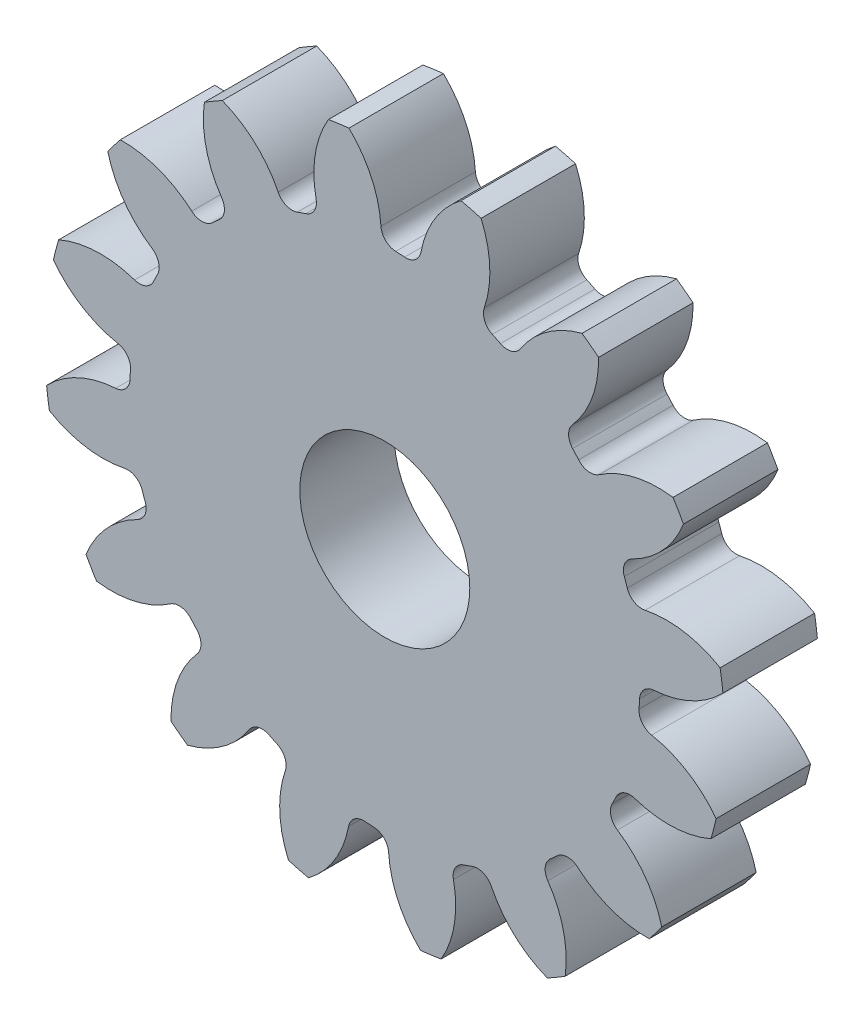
ISO-10303-21;
HEADER;
FILE_DESCRIPTION(('STEP AP214'),'2;1');
FILE_NAME('part.step','',(''),(''),'','','');
FILE_SCHEMA(('AUTOMOTIVE_DESIGN { 1 0 10303 214 1 1 1 1 }'));
ENDSEC;
DATA;
#1=APPLICATION_CONTEXT('core data for automotive mechanical design processes');
#2=APPLICATION_PROTOCOL_DEFINITION('international standard','automotive_design',2000,#1);
#3=PRODUCT_CONTEXT('',#1,'mechanical');
#4=PRODUCT('Part','Part','',(#3));
#5=PRODUCT_RELATED_PRODUCT_CATEGORY('part','',(#4));
#6=PRODUCT_DEFINITION_FORMATION('','',#4);
#7=PRODUCT_DEFINITION_CONTEXT('part definition',#1,'design');
#8=PRODUCT_DEFINITION('design','',#6,#7);
#9=PRODUCT_DEFINITION_SHAPE('','',#8);
#10=(LENGTH_UNIT() NAMED_UNIT(*) SI_UNIT(.MILLI.,.METRE.));
#11=(NAMED_UNIT(*) PLANE_ANGLE_UNIT() SI_UNIT($,.RADIAN.));
#12=(NAMED_UNIT(*) SI_UNIT($,.STERADIAN.) SOLID_ANGLE_UNIT());
#13=UNCERTAINTY_MEASURE_WITH_UNIT(LENGTH_MEASURE(1.E-05),#10,'distance_accuracy_value','');
#14=(GEOMETRIC_REPRESENTATION_CONTEXT(3) GLOBAL_UNCERTAINTY_ASSIGNED_CONTEXT((#13)) GLOBAL_UNIT_ASSIGNED_CONTEXT((#10,
#11,#12)) REPRESENTATION_CONTEXT('',''));
#15=CARTESIAN_POINT('',(0.,0.,0.));
#16=DIRECTION('',(0.,0.,1.));
#17=DIRECTION('',(1.,0.,0.));
#18=AXIS2_PLACEMENT_3D('',#15,#16,#17);
#19=CARTESIAN_POINT('',(0.,0.,127.));
#20=DIRECTION('',(0.,0.,-1.));
#21=DIRECTION('',(-1.,0.,0.));
#22=AXIS2_PLACEMENT_3D('',#19,#20,#21);
#23=CYLINDRICAL_SURFACE('',#22,457.2);
#24=DIRECTION('',(0.,0.,-1.));
#25=VECTOR('',#24,1.);
#26=CARTESIAN_POINT('',(450.875762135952,75.781838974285,63.5));
#27=LINE('',#26,#25);
#28=CARTESIAN_POINT('',(450.875762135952,75.781838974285,127.));
#29=VERTEX_POINT('',#28);
#30=CARTESIAN_POINT('',(450.875762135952,75.781838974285,0.));
#31=VERTEX_POINT('',#30);
#32=EDGE_CURVE('E672',#29,#31,#27,.T.);
#33=ORIENTED_EDGE('',*,*,#32,.F.);
#34=CARTESIAN_POINT('',(0.,0.,127.));
#35=DIRECTION('',(0.,0.,1.));
#36=DIRECTION('',(1.,0.,0.));
#37=AXIS2_PLACEMENT_3D('',#34,#35,#36);
#38=CIRCLE('',#37,457.2);
#39=CARTESIAN_POINT('',(454.655968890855,48.1641978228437,127.));
#40=VERTEX_POINT('',#39);
#41=EDGE_CURVE('E1241',#40,#29,#38,.T.);
#42=ORIENTED_EDGE('',*,*,#41,.F.);
#43=DIRECTION('',(0.,0.,-1.));
#44=VECTOR('',#43,1.);
#45=CARTESIAN_POINT('',(454.655968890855,48.1641978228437,63.5));
#46=LINE('',#45,#44);
#47=CARTESIAN_POINT('',(454.655968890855,48.1641978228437,0.));
#48=VERTEX_POINT('',#47);
#49=EDGE_CURVE('E1235',#48,#40,#46,.F.);
#50=ORIENTED_EDGE('',*,*,#49,.F.);
#51=CARTESIAN_POINT('',(0.,0.,0.));
#52=DIRECTION('',(0.,0.,1.));
#53=DIRECTION('',(1.,0.,0.));
#54=AXIS2_PLACEMENT_3D('',#51,#52,#53);
#55=CIRCLE('',#54,457.2);
#56=EDGE_CURVE('E1246',#48,#31,#55,.T.);
#57=ORIENTED_EDGE('',*,*,#56,.T.);
#58=EDGE_LOOP('',(#33,#42,#50,#57));
#59=FACE_BOUND('',#58,.T.);
#60=ADVANCED_FACE('F33',(#59),#23,.T.);
#61=DIRECTION('',(0.,0.,-1.));
#62=VECTOR('',#61,1.);
#63=CARTESIAN_POINT('',(401.615703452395,218.487223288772,63.5));
#64=LINE('',#63,#62);
#65=CARTESIAN_POINT('',(401.615703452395,218.487223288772,0.));
#66=VERTEX_POINT('',#65);
#67=CARTESIAN_POINT('',(401.615703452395,218.487223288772,127.));
#68=VERTEX_POINT('',#67);
#69=EDGE_CURVE('E643',#66,#68,#64,.F.);
#70=ORIENTED_EDGE('',*,*,#69,.F.);
#71=CARTESIAN_POINT('',(387.554434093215,242.55597418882,0.));
#72=VERTEX_POINT('',#71);
#73=EDGE_CURVE('E1249',#66,#72,#55,.T.);
#74=ORIENTED_EDGE('',*,*,#73,.T.);
#75=DIRECTION('',(0.,0.,-1.));
#76=VECTOR('',#75,1.);
#77=CARTESIAN_POINT('',(387.554434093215,242.55597418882,63.5));
#78=LINE('',#77,#76);
#79=CARTESIAN_POINT('',(387.554434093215,242.55597418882,127.));
#80=VERTEX_POINT('',#79);
#81=EDGE_CURVE('E705',#80,#72,#78,.T.);
#82=ORIENTED_EDGE('',*,*,#81,.F.);
#83=EDGE_CURVE('E1244',#68,#80,#38,.T.);
#84=ORIENTED_EDGE('',*,*,#83,.F.);
#85=EDGE_LOOP('',(#70,#74,#82,#84));
#86=FACE_BOUND('',#85,.T.);
#87=ADVANCED_FACE('F1431',(#86),#23,.T.);
#88=CARTESIAN_POINT('',(0.,0.,127.));
#89=DIRECTION('',(0.,0.,1.));
#90=DIRECTION('',(1.,0.,0.));
#91=AXIS2_PLACEMENT_3D('',#88,#89,#90);
#92=PLANE('',#91);
#93=CARTESIAN_POINT('',(0.,0.,127.000000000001));
#94=DIRECTION('',(0.,0.,1.));
#95=DIRECTION('',(1.,0.,0.));
#96=AXIS2_PLACEMENT_3D('',#93,#94,#95);
#97=CIRCLE('',#96,114.3);
#98=CARTESIAN_POINT('',(114.3,0.,127.000000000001));
#99=VERTEX_POINT('',#98);
#100=EDGE_CURVE('E660',#99,#99,#97,.T.);
#101=ORIENTED_EDGE('',*,*,#100,.F.);
#102=EDGE_LOOP('',(#101));
#103=FACE_BOUND('',#102,.T.);
#104=ORIENTED_EDGE('',*,*,#41,.T.);
#105=CARTESIAN_POINT('',(379.115579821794,-45.9584045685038,127.));
#106=DIRECTION('',(0.,0.,-1.));
#107=DIRECTION('',(0.923879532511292,0.382683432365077,0.));
#108=AXIS2_PLACEMENT_3D('',#105,#106,#107);
#109=CIRCLE('',#108,141.315995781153);
#110=CARTESIAN_POINT('',(349.978409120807,92.3211526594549,127.));
#111=VERTEX_POINT('',#110);
#112=EDGE_CURVE('E652',#111,#29,#109,.T.);
#113=ORIENTED_EDGE('',*,*,#112,.F.);
#114=CARTESIAN_POINT('',(345.715420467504,112.552498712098,127.));
#115=DIRECTION('',(0.,0.,1.));
#116=DIRECTION('',(-0.923879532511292,-0.382683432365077,0.));
#117=AXIS2_PLACEMENT_3D('',#114,#115,#116);
#118=CIRCLE('',#117,20.6756);
#119=CARTESIAN_POINT('',(326.055482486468,106.151930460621,127.));
#120=VERTEX_POINT('',#119);
#121=EDGE_CURVE('E650',#120,#111,#118,.T.);
#122=ORIENTED_EDGE('',*,*,#121,.F.);
#123=CARTESIAN_POINT('',(0.,0.,127.));
#124=DIRECTION('',(0.,0.,-1.));
#125=DIRECTION('',(0.923879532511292,0.382683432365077,0.));
#126=AXIS2_PLACEMENT_3D('',#123,#124,#125);
#127=CIRCLE('',#126,342.9);
#128=CARTESIAN_POINT('',(322.108604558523,117.585955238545,127.));
#129=VERTEX_POINT('',#128);
#130=EDGE_CURVE('E635',#129,#120,#127,.T.);
#131=ORIENTED_EDGE('',*,*,#130,.F.);
#132=CARTESIAN_POINT('',(341.53056041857,124.675952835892,127.));
#133=DIRECTION('',(0.,0.,1.));
#134=DIRECTION('',(-0.923879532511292,-0.382683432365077,0.));
#135=AXIS2_PLACEMENT_3D('',#132,#133,#134);
#136=CIRCLE('',#135,20.6756);
#137=CARTESIAN_POINT('',(332.405665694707,143.229031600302,127.));
#138=VERTEX_POINT('',#137);
#139=EDGE_CURVE('E627',#138,#129,#136,.T.);
#140=ORIENTED_EDGE('',*,*,#139,.F.);
#141=CARTESIAN_POINT('',(270.037773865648,270.037772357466,127.));
#142=DIRECTION('',(0.,0.,-1.));
#143=DIRECTION('',(-0.923879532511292,-0.382683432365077,0.));
#144=AXIS2_PLACEMENT_3D('',#141,#142,#143);
#145=CIRCLE('',#144,141.315995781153);
#146=EDGE_CURVE('E657',#68,#138,#145,.T.);
#147=ORIENTED_EDGE('',*,*,#146,.F.);
#148=ORIENTED_EDGE('',*,*,#83,.T.);
#149=CARTESIAN_POINT('',(367.844644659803,102.621222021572,127.));
#150=DIRECTION('',(0.,0.,-1.));
#151=DIRECTION('',(0.707106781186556,0.707106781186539,0.));
#152=AXIS2_PLACEMENT_3D('',#149,#150,#151);
#153=CIRCLE('',#152,141.315995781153);
#154=CARTESIAN_POINT('',(288.008113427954,219.224562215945,127.));
#155=VERTEX_POINT('',#154);
#156=EDGE_CURVE('E681',#155,#80,#153,.T.);
#157=ORIENTED_EDGE('',*,*,#156,.F.);
#158=CARTESIAN_POINT('',(276.327424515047,236.284513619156,127.));
#159=DIRECTION('',(0.,0.,1.));
#160=DIRECTION('',(-0.707106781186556,-0.707106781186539,0.));
#161=AXIS2_PLACEMENT_3D('',#158,#159,#160);
#162=CIRCLE('',#161,20.6756);
#163=CARTESIAN_POINT('',(260.613401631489,222.847627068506,127.));
#164=VERTEX_POINT('',#163);
#165=EDGE_CURVE('E679',#164,#155,#162,.T.);
#166=ORIENTED_EDGE('',*,*,#165,.F.);
#167=CARTESIAN_POINT('',(0.,0.,127.));
#168=DIRECTION('',(0.,0.,-1.));
#169=DIRECTION('',(0.707106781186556,0.707106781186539,0.));
#170=AXIS2_PLACEMENT_3D('',#167,#168,#169);
#171=CIRCLE('',#170,342.9);
#172=CARTESIAN_POINT('',(252.591350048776,231.900883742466,127.));
#173=VERTEX_POINT('',#172);
#174=EDGE_CURVE('E676',#173,#164,#171,.T.);
#175=ORIENTED_EDGE('',*,*,#174,.F.);
#176=CARTESIAN_POINT('',(267.821672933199,245.883648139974,127.));
#177=DIRECTION('',(0.,0.,1.));
#178=DIRECTION('',(-0.707106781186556,-0.707106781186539,0.));
#179=AXIS2_PLACEMENT_3D('',#176,#177,#178);
#180=CIRCLE('',#179,20.6756);
#181=CARTESIAN_POINT('',(252.291413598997,259.532511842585,127.));
#182=VERTEX_POINT('',#181);
#183=EDGE_CURVE('E674',#182,#173,#180,.T.);
#184=ORIENTED_EDGE('',*,*,#183,.F.);
#185=CARTESIAN_POINT('',(146.143390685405,352.821353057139,127.));
#186=DIRECTION('',(0.,0.,-1.));
#187=DIRECTION('',(-0.707106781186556,-0.707106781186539,0.));
#188=AXIS2_PLACEMENT_3D('',#185,#186,#187);
#189=CIRCLE('',#188,141.315995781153);
#190=CARTESIAN_POINT('',(287.433087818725,355.547549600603,127.));
#191=VERTEX_POINT('',#190);
#192=EDGE_CURVE('E684',#191,#182,#189,.T.);
#193=ORIENTED_EDGE('',*,*,#192,.F.);
#194=CARTESIAN_POINT('',(265.23145664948,372.403161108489,127.));
#195=VERTEX_POINT('',#194);
#196=EDGE_CURVE('E1289',#191,#195,#38,.T.);
#197=ORIENTED_EDGE('',*,*,#196,.T.);
#198=CARTESIAN_POINT('',(300.572696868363,235.577697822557,127.));
#199=DIRECTION('',(0.,0.,-1.));
#200=DIRECTION('',(0.3826834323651,0.923879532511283,0.));
#201=AXIS2_PLACEMENT_3D('',#198,#199,#200);
#202=CIRCLE('',#201,141.315995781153);
#203=CARTESIAN_POINT('',(182.191193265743,312.753019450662,127.));
#204=VERTEX_POINT('',#203);
#205=EDGE_CURVE('E716',#204,#195,#202,.T.);
#206=ORIENTED_EDGE('',*,*,#205,.F.);
#207=CARTESIAN_POINT('',(164.871083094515,324.044353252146,127.));
#208=DIRECTION('',(0.,0.,1.));
#209=DIRECTION('',(-0.3826834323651,-0.923879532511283,0.));
#210=AXIS2_PLACEMENT_3D('',#207,#208,#209);
#211=CIRCLE('',#210,20.6756);
#212=CARTESIAN_POINT('',(155.495292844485,305.616792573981,127.));
#213=VERTEX_POINT('',#212);
#214=EDGE_CURVE('E714',#213,#204,#211,.T.);
#215=ORIENTED_EDGE('',*,*,#214,.F.);
#216=CARTESIAN_POINT('',(0.,0.,127.));
#217=DIRECTION('',(0.,0.,-1.));
#218=DIRECTION('',(0.3826834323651,0.923879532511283,0.));
#219=AXIS2_PLACEMENT_3D('',#216,#217,#218);
#220=CIRCLE('',#219,342.9);
#221=CARTESIAN_POINT('',(144.619352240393,310.911004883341,127.));
#222=VERTEX_POINT('',#221);
#223=EDGE_CURVE('E711',#222,#213,#220,.T.);
#224=ORIENTED_EDGE('',*,*,#223,.F.);
#225=CARTESIAN_POINT('',(153.339363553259,329.657786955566,127.));
#226=DIRECTION('',(0.,0.,1.));
#227=DIRECTION('',(-0.3826834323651,-0.923879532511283,0.));
#228=AXIS2_PLACEMENT_3D('',#225,#226,#227);
#229=CIRCLE('',#228,20.6756);
#230=CARTESIAN_POINT('',(133.768080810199,336.324519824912,127.));
#231=VERTEX_POINT('',#230);
#232=EDGE_CURVE('E709',#231,#222,#229,.T.);
#233=ORIENTED_EDGE('',*,*,#232,.F.);
#234=CARTESIAN_POINT('',(1.06644493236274E-06,381.891081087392,127.));
#235=DIRECTION('',(0.,0.,-1.));
#236=DIRECTION('',(-0.3826834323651,-0.923879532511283,0.));
#237=AXIS2_PLACEMENT_3D('',#234,#235,#236);
#238=CIRCLE('',#237,141.315995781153);
#239=CARTESIAN_POINT('',(129.491390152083,438.478984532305,127.));
#240=VERTEX_POINT('',#239);
#241=EDGE_CURVE('E719',#240,#231,#238,.T.);
#242=ORIENTED_EDGE('',*,*,#241,.F.);
#243=CARTESIAN_POINT('',(102.529394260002,445.555342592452,127.));
#244=VERTEX_POINT('',#243);
#245=EDGE_CURVE('E1413',#240,#244,#38,.T.);
#246=ORIENTED_EDGE('',*,*,#245,.T.);
#247=CARTESIAN_POINT('',(187.541280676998,332.669604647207,127.));
#248=DIRECTION('',(0.,0.,-1.));
#249=DIRECTION('',(0.,1.,0.));
#250=AXIS2_PLACEMENT_3D('',#247,#248,#249);
#251=CIRCLE('',#250,141.315995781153);
#252=CARTESIAN_POINT('',(48.6373154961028,358.667664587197,127.));
#253=VERTEX_POINT('',#252);
#254=EDGE_CURVE('E754',#253,#244,#251,.T.);
#255=ORIENTED_EDGE('',*,*,#254,.F.);
#256=CARTESIAN_POINT('',(28.314613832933,362.471377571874,127.));
#257=DIRECTION('',(0.,0.,1.));
#258=DIRECTION('',(0.,-1.,0.));
#259=AXIS2_PLACEMENT_3D('',#256,#257,#258);
#260=CIRCLE('',#259,20.6756);
#261=CARTESIAN_POINT('',(26.704435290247,341.858571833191,127.));
#262=VERTEX_POINT('',#261);
#263=EDGE_CURVE('E752',#262,#253,#260,.T.);
#264=ORIENTED_EDGE('',*,*,#263,.F.);
#265=CARTESIAN_POINT('',(0.,0.,127.));
#266=DIRECTION('',(0.,0.,-1.));
#267=DIRECTION('',(0.,1.,0.));
#268=AXIS2_PLACEMENT_3D('',#265,#266,#267);
#269=CIRCLE('',#268,342.9);
#270=CARTESIAN_POINT('',(14.6303690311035,342.587743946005,127.));
#271=VERTEX_POINT('',#270);
#272=EDGE_CURVE('E749',#271,#262,#269,.T.);
#273=ORIENTED_EDGE('',*,*,#272,.F.);
#274=CARTESIAN_POINT('',(15.5125260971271,363.244516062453,127.));
#275=DIRECTION('',(0.,0.,1.));
#276=DIRECTION('',(0.,-1.,0.));
#277=AXIS2_PLACEMENT_3D('',#274,#275,#276);
#278=CIRCLE('',#277,20.6756);
#279=CARTESIAN_POINT('',(-5.12022967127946,361.91416845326,127.));
#280=VERTEX_POINT('',#279);
#281=EDGE_CURVE('E747',#280,#271,#278,.T.);
#282=ORIENTED_EDGE('',*,*,#281,.F.);
#283=CARTESIAN_POINT('',(-146.143388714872,352.821353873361,127.));
#284=DIRECTION('',(0.,0.,-1.));
#285=DIRECTION('',(0.,-1.,0.));
#286=AXIS2_PLACEMENT_3D('',#283,#284,#285);
#287=CIRCLE('',#286,141.315995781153);
#288=CARTESIAN_POINT('',(-48.1641978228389,454.655968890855,127.));
#289=VERTEX_POINT('',#288);
#290=EDGE_CURVE('E757',#289,#280,#287,.T.);
#291=ORIENTED_EDGE('',*,*,#290,.F.);
#292=CARTESIAN_POINT('',(-75.7818389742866,450.875762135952,127.));
#293=VERTEX_POINT('',#292);
#294=EDGE_CURVE('E1409',#289,#293,#38,.T.);
#295=ORIENTED_EDGE('',*,*,#294,.T.);
#296=CARTESIAN_POINT('',(45.9584045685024,379.115579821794,127.));
#297=DIRECTION('',(0.,0.,-1.));
#298=DIRECTION('',(-0.382683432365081,0.923879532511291,0.));
#299=AXIS2_PLACEMENT_3D('',#296,#297,#298);
#300=CIRCLE('',#299,141.315995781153);
#301=CARTESIAN_POINT('',(-92.3211526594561,349.978409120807,127.));
#302=VERTEX_POINT('',#301);
#303=EDGE_CURVE('E792',#302,#293,#300,.T.);
#304=ORIENTED_EDGE('',*,*,#303,.F.);
#305=CARTESIAN_POINT('',(-112.552498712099,345.715420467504,127.));
#306=DIRECTION('',(0.,0.,1.));
#307=DIRECTION('',(0.382683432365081,-0.923879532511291,0.));
#308=AXIS2_PLACEMENT_3D('',#305,#306,#307);
#309=CIRCLE('',#308,20.6756);
#310=CARTESIAN_POINT('',(-106.151930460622,326.055482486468,127.));
#311=VERTEX_POINT('',#310);
#312=EDGE_CURVE('E790',#311,#302,#309,.T.);
#313=ORIENTED_EDGE('',*,*,#312,.F.);
#314=CARTESIAN_POINT('',(0.,0.,127.));
#315=DIRECTION('',(0.,0.,-1.));
#316=DIRECTION('',(-0.382683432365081,0.923879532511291,0.));
#317=AXIS2_PLACEMENT_3D('',#314,#315,#316);
#318=CIRCLE('',#317,342.9);
#319=CARTESIAN_POINT('',(-117.585955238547,322.108604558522,127.));
#320=VERTEX_POINT('',#319);
#321=EDGE_CURVE('E787',#320,#311,#318,.T.);
#322=ORIENTED_EDGE('',*,*,#321,.F.);
#323=CARTESIAN_POINT('',(-124.675952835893,341.53056041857,127.));
#324=DIRECTION('',(0.,0.,1.));
#325=DIRECTION('',(0.382683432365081,-0.923879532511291,0.));
#326=AXIS2_PLACEMENT_3D('',#323,#324,#325);
#327=CIRCLE('',#326,20.6756);
#328=CARTESIAN_POINT('',(-143.229031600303,332.405665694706,127.));
#329=VERTEX_POINT('',#328);
#330=EDGE_CURVE('E785',#329,#320,#327,.T.);
#331=ORIENTED_EDGE('',*,*,#330,.F.);
#332=CARTESIAN_POINT('',(-270.037772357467,270.037773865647,127.));
#333=DIRECTION('',(0.,0.,-1.));
#334=DIRECTION('',(0.382683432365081,-0.923879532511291,0.));
#335=AXIS2_PLACEMENT_3D('',#332,#333,#334);
#336=CIRCLE('',#335,141.315995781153);
#337=CARTESIAN_POINT('',(-218.487223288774,401.615703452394,127.));
#338=VERTEX_POINT('',#337);
#339=EDGE_CURVE('E795',#338,#329,#336,.T.);
#340=ORIENTED_EDGE('',*,*,#339,.F.);
#341=CARTESIAN_POINT('',(-242.555974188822,387.554434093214,127.));
#342=VERTEX_POINT('',#341);
#343=EDGE_CURVE('E1405',#338,#342,#38,.T.);
#344=ORIENTED_EDGE('',*,*,#343,.T.);
#345=CARTESIAN_POINT('',(-102.621222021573,367.844644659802,127.));
#346=DIRECTION('',(0.,0.,-1.));
#347=DIRECTION('',(-0.707106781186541,0.707106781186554,0.));
#348=AXIS2_PLACEMENT_3D('',#345,#346,#347);
#349=CIRCLE('',#348,141.315995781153);
#350=CARTESIAN_POINT('',(-219.224562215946,288.008113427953,127.));
#351=VERTEX_POINT('',#350);
#352=EDGE_CURVE('E830',#351,#342,#349,.T.);
#353=ORIENTED_EDGE('',*,*,#352,.F.);
#354=CARTESIAN_POINT('',(-236.284513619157,276.327424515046,127.));
#355=DIRECTION('',(0.,0.,1.));
#356=DIRECTION('',(0.707106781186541,-0.707106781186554,0.));
#357=AXIS2_PLACEMENT_3D('',#354,#355,#356);
#358=CIRCLE('',#357,20.6756);
#359=CARTESIAN_POINT('',(-222.847627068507,260.613401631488,127.));
#360=VERTEX_POINT('',#359);
#361=EDGE_CURVE('E828',#360,#351,#358,.T.);
#362=ORIENTED_EDGE('',*,*,#361,.F.);
#363=CARTESIAN_POINT('',(0.,0.,127.));
#364=DIRECTION('',(0.,0.,-1.));
#365=DIRECTION('',(-0.707106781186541,0.707106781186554,0.));
#366=AXIS2_PLACEMENT_3D('',#363,#364,#365);
#367=CIRCLE('',#366,342.9);
#368=CARTESIAN_POINT('',(-231.900883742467,252.591350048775,127.));
#369=VERTEX_POINT('',#368);
#370=EDGE_CURVE('E825',#369,#360,#367,.T.);
#371=ORIENTED_EDGE('',*,*,#370,.F.);
#372=CARTESIAN_POINT('',(-245.883648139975,267.821672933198,127.));
#373=DIRECTION('',(0.,0.,1.));
#374=DIRECTION('',(0.707106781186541,-0.707106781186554,0.));
#375=AXIS2_PLACEMENT_3D('',#372,#373,#374);
#376=CIRCLE('',#375,20.6756);
#377=CARTESIAN_POINT('',(-259.532511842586,252.291413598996,127.));
#378=VERTEX_POINT('',#377);
#379=EDGE_CURVE('E823',#378,#369,#376,.T.);
#380=ORIENTED_EDGE('',*,*,#379,.F.);
#381=CARTESIAN_POINT('',(-352.821353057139,146.143390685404,127.));
#382=DIRECTION('',(0.,0.,-1.));
#383=DIRECTION('',(0.707106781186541,-0.707106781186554,0.));
#384=AXIS2_PLACEMENT_3D('',#381,#382,#383);
#385=CIRCLE('',#384,141.315995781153);
#386=CARTESIAN_POINT('',(-355.547549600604,287.433087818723,127.));
#387=VERTEX_POINT('',#386);
#388=EDGE_CURVE('E833',#387,#378,#385,.T.);
#389=ORIENTED_EDGE('',*,*,#388,.F.);
#390=CARTESIAN_POINT('',(-372.40316110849,265.231456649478,127.));
#391=VERTEX_POINT('',#390);
#392=EDGE_CURVE('E1401',#387,#391,#38,.T.);
#393=ORIENTED_EDGE('',*,*,#392,.T.);
#394=CARTESIAN_POINT('',(-235.577697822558,300.572696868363,127.));
#395=DIRECTION('',(0.,0.,-1.));
#396=DIRECTION('',(-0.923879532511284,0.382683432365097,0.));
#397=AXIS2_PLACEMENT_3D('',#394,#395,#396);
#398=CIRCLE('',#397,141.315995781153);
#399=CARTESIAN_POINT('',(-312.753019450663,182.191193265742,127.));
#400=VERTEX_POINT('',#399);
#401=EDGE_CURVE('E868',#400,#391,#398,.T.);
#402=ORIENTED_EDGE('',*,*,#401,.F.);
#403=CARTESIAN_POINT('',(-324.044353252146,164.871083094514,127.));
#404=DIRECTION('',(0.,0.,1.));
#405=DIRECTION('',(0.923879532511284,-0.382683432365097,0.));
#406=AXIS2_PLACEMENT_3D('',#403,#404,#405);
#407=CIRCLE('',#406,20.6756);
#408=CARTESIAN_POINT('',(-305.616792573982,155.495292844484,127.));
#409=VERTEX_POINT('',#408);
#410=EDGE_CURVE('E866',#409,#400,#407,.T.);
#411=ORIENTED_EDGE('',*,*,#410,.F.);
#412=CARTESIAN_POINT('',(0.,0.,127.));
#413=DIRECTION('',(0.,0.,-1.));
#414=DIRECTION('',(-0.923879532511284,0.382683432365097,0.));
#415=AXIS2_PLACEMENT_3D('',#412,#413,#414);
#416=CIRCLE('',#415,342.9);
#417=CARTESIAN_POINT('',(-310.911004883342,144.619352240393,127.));
#418=VERTEX_POINT('',#417);
#419=EDGE_CURVE('E863',#418,#409,#416,.T.);
#420=ORIENTED_EDGE('',*,*,#419,.F.);
#421=CARTESIAN_POINT('',(-329.657786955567,153.339363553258,127.));
#422=DIRECTION('',(0.,0.,1.));
#423=DIRECTION('',(0.923879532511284,-0.382683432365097,0.));
#424=AXIS2_PLACEMENT_3D('',#421,#422,#423);
#425=CIRCLE('',#424,20.6756);
#426=CARTESIAN_POINT('',(-336.324519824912,133.768080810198,127.));
#427=VERTEX_POINT('',#426);
#428=EDGE_CURVE('E861',#427,#418,#425,.T.);
#429=ORIENTED_EDGE('',*,*,#428,.F.);
#430=CARTESIAN_POINT('',(-381.891081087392,1.06644379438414E-06,127.));
#431=DIRECTION('',(0.,0.,-1.));
#432=DIRECTION('',(0.923879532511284,-0.382683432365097,0.));
#433=AXIS2_PLACEMENT_3D('',#430,#431,#432);
#434=CIRCLE('',#433,141.315995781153);
#435=CARTESIAN_POINT('',(-438.478984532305,129.491390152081,127.));
#436=VERTEX_POINT('',#435);
#437=EDGE_CURVE('E871',#436,#427,#434,.T.);
#438=ORIENTED_EDGE('',*,*,#437,.F.);
#439=CARTESIAN_POINT('',(-445.555342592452,102.529394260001,127.));
#440=VERTEX_POINT('',#439);
#441=EDGE_CURVE('E1397',#436,#440,#38,.T.);
#442=ORIENTED_EDGE('',*,*,#441,.T.);
#443=CARTESIAN_POINT('',(-332.669604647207,187.541280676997,127.));
#444=DIRECTION('',(0.,0.,-1.));
#445=DIRECTION('',(-1.,0.,0.));
#446=AXIS2_PLACEMENT_3D('',#443,#444,#445);
#447=CIRCLE('',#446,141.315995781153);
#448=CARTESIAN_POINT('',(-358.667664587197,48.6373154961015,127.));
#449=VERTEX_POINT('',#448);
#450=EDGE_CURVE('E906',#449,#440,#447,.T.);
#451=ORIENTED_EDGE('',*,*,#450,.F.);
#452=CARTESIAN_POINT('',(-362.471377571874,28.3146138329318,127.));
#453=DIRECTION('',(0.,0.,1.));
#454=DIRECTION('',(1.,0.,0.));
#455=AXIS2_PLACEMENT_3D('',#452,#453,#454);
#456=CIRCLE('',#455,20.6756);
#457=CARTESIAN_POINT('',(-341.858571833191,26.7044352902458,127.));
#458=VERTEX_POINT('',#457);
#459=EDGE_CURVE('E904',#458,#449,#456,.T.);
#460=ORIENTED_EDGE('',*,*,#459,.F.);
#461=CARTESIAN_POINT('',(0.,0.,127.));
#462=DIRECTION('',(0.,0.,-1.));
#463=DIRECTION('',(-1.,0.,0.));
#464=AXIS2_PLACEMENT_3D('',#461,#462,#463);
#465=CIRCLE('',#464,342.9);
#466=CARTESIAN_POINT('',(-342.587743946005,14.6303690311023,127.));
#467=VERTEX_POINT('',#466);
#468=EDGE_CURVE('E901',#467,#458,#465,.T.);
#469=ORIENTED_EDGE('',*,*,#468,.F.);
#470=CARTESIAN_POINT('',(-363.244516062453,15.5125260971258,127.));
#471=DIRECTION('',(0.,0.,1.));
#472=DIRECTION('',(1.,0.,0.));
#473=AXIS2_PLACEMENT_3D('',#470,#471,#472);
#474=CIRCLE('',#473,20.6756);
#475=CARTESIAN_POINT('',(-361.91416845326,-5.12022967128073,127.));
#476=VERTEX_POINT('',#475);
#477=EDGE_CURVE('E899',#476,#467,#474,.T.);
#478=ORIENTED_EDGE('',*,*,#477,.F.);
#479=CARTESIAN_POINT('',(-352.82135387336,-146.143388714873,127.));
#480=DIRECTION('',(0.,0.,-1.));
#481=DIRECTION('',(1.,0.,0.));
#482=AXIS2_PLACEMENT_3D('',#479,#480,#481);
#483=CIRCLE('',#482,141.315995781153);
#484=CARTESIAN_POINT('',(-454.655968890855,-48.1641978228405,127.));
#485=VERTEX_POINT('',#484);
#486=EDGE_CURVE('E909',#485,#476,#483,.T.);
#487=ORIENTED_EDGE('',*,*,#486,.F.);
#488=CARTESIAN_POINT('',(-450.875762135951,-75.7818389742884,127.));
#489=VERTEX_POINT('',#488);
#490=EDGE_CURVE('E1393',#485,#489,#38,.T.);
#491=ORIENTED_EDGE('',*,*,#490,.T.);
#492=CARTESIAN_POINT('',(-379.115579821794,45.9584045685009,127.));
#493=DIRECTION('',(0.,0.,-1.));
#494=DIRECTION('',(-0.923879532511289,-0.382683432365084,0.));
#495=AXIS2_PLACEMENT_3D('',#492,#493,#494);
#496=CIRCLE('',#495,141.315995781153);
#497=CARTESIAN_POINT('',(-349.978409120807,-92.3211526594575,127.));
#498=VERTEX_POINT('',#497);
#499=EDGE_CURVE('E944',#498,#489,#496,.T.);
#500=ORIENTED_EDGE('',*,*,#499,.F.);
#501=CARTESIAN_POINT('',(-345.715420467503,-112.552498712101,127.));
#502=DIRECTION('',(0.,0.,1.));
#503=DIRECTION('',(0.923879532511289,0.382683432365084,0.));
#504=AXIS2_PLACEMENT_3D('',#501,#502,#503);
#505=CIRCLE('',#504,20.6756);
#506=CARTESIAN_POINT('',(-326.055482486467,-106.151930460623,127.));
#507=VERTEX_POINT('',#506);
#508=EDGE_CURVE('E942',#507,#498,#505,.T.);
#509=ORIENTED_EDGE('',*,*,#508,.F.);
#510=CARTESIAN_POINT('',(0.,0.,127.));
#511=DIRECTION('',(0.,0.,-1.));
#512=DIRECTION('',(-0.923879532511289,-0.382683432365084,0.));
#513=AXIS2_PLACEMENT_3D('',#510,#511,#512);
#514=CIRCLE('',#513,342.9);
#515=CARTESIAN_POINT('',(-322.108604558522,-117.585955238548,127.));
#516=VERTEX_POINT('',#515);
#517=EDGE_CURVE('E939',#516,#507,#514,.T.);
#518=ORIENTED_EDGE('',*,*,#517,.F.);
#519=CARTESIAN_POINT('',(-341.530560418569,-124.675952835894,127.));
#520=DIRECTION('',(0.,0.,1.));
#521=DIRECTION('',(0.923879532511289,0.382683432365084,0.));
#522=AXIS2_PLACEMENT_3D('',#519,#520,#521);
#523=CIRCLE('',#522,20.6756);
#524=CARTESIAN_POINT('',(-332.405665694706,-143.229031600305,127.));
#525=VERTEX_POINT('',#524);
#526=EDGE_CURVE('E937',#525,#516,#523,.T.);
#527=ORIENTED_EDGE('',*,*,#526,.F.);
#528=CARTESIAN_POINT('',(-270.037773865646,-270.037772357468,127.));
#529=DIRECTION('',(0.,0.,-1.));
#530=DIRECTION('',(0.923879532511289,0.382683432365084,0.));
#531=AXIS2_PLACEMENT_3D('',#528,#529,#530);
#532=CIRCLE('',#531,141.315995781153);
#533=CARTESIAN_POINT('',(-401.615703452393,-218.487223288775,127.));
#534=VERTEX_POINT('',#533);
#535=EDGE_CURVE('E947',#534,#525,#532,.T.);
#536=ORIENTED_EDGE('',*,*,#535,.F.);
#537=CARTESIAN_POINT('',(-387.554434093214,-242.555974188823,127.));
#538=VERTEX_POINT('',#537);
#539=EDGE_CURVE('E1389',#534,#538,#38,.T.);
#540=ORIENTED_EDGE('',*,*,#539,.T.);
#541=CARTESIAN_POINT('',(-367.844644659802,-102.621222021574,127.));
#542=DIRECTION('',(0.,0.,-1.));
#543=DIRECTION('',(-0.707106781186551,-0.707106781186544,0.));
#544=AXIS2_PLACEMENT_3D('',#541,#542,#543);
#545=CIRCLE('',#544,141.315995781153);
#546=CARTESIAN_POINT('',(-288.008113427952,-219.224562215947,127.));
#547=VERTEX_POINT('',#546);
#548=EDGE_CURVE('E982',#547,#538,#545,.T.);
#549=ORIENTED_EDGE('',*,*,#548,.F.);
#550=CARTESIAN_POINT('',(-276.327424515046,-236.284513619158,127.));
#551=DIRECTION('',(0.,0.,1.));
#552=DIRECTION('',(0.707106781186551,0.707106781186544,0.));
#553=AXIS2_PLACEMENT_3D('',#550,#551,#552);
#554=CIRCLE('',#553,20.6756);
#555=CARTESIAN_POINT('',(-260.613401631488,-222.847627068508,127.));
#556=VERTEX_POINT('',#555);
#557=EDGE_CURVE('E980',#556,#547,#554,.T.);
#558=ORIENTED_EDGE('',*,*,#557,.F.);
#559=CARTESIAN_POINT('',(0.,0.,127.));
#560=DIRECTION('',(0.,0.,-1.));
#561=DIRECTION('',(-0.707106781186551,-0.707106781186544,0.));
#562=AXIS2_PLACEMENT_3D('',#559,#560,#561);
#563=CIRCLE('',#562,342.9);
#564=CARTESIAN_POINT('',(-252.591350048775,-231.900883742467,127.));
#565=VERTEX_POINT('',#564);
#566=EDGE_CURVE('E977',#565,#556,#563,.T.);
#567=ORIENTED_EDGE('',*,*,#566,.F.);
#568=CARTESIAN_POINT('',(-267.821672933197,-245.883648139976,127.));
#569=DIRECTION('',(0.,0.,1.));
#570=DIRECTION('',(0.707106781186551,0.707106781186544,0.));
#571=AXIS2_PLACEMENT_3D('',#568,#569,#570);
#572=CIRCLE('',#571,20.6756);
#573=CARTESIAN_POINT('',(-252.291413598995,-259.532511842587,127.));
#574=VERTEX_POINT('',#573);
#575=EDGE_CURVE('E975',#574,#565,#572,.T.);
#576=ORIENTED_EDGE('',*,*,#575,.F.);
#577=CARTESIAN_POINT('',(-146.143390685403,-352.82135305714,127.));
#578=DIRECTION('',(0.,0.,-1.));
#579=DIRECTION('',(0.707106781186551,0.707106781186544,0.));
#580=AXIS2_PLACEMENT_3D('',#577,#578,#579);
#581=CIRCLE('',#580,141.315995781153);
#582=CARTESIAN_POINT('',(-287.433087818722,-355.547549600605,127.));
#583=VERTEX_POINT('',#582);
#584=EDGE_CURVE('E985',#583,#574,#581,.T.);
#585=ORIENTED_EDGE('',*,*,#584,.F.);
#586=CARTESIAN_POINT('',(-265.231456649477,-372.403161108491,127.));
#587=VERTEX_POINT('',#586);
#588=EDGE_CURVE('E1385',#583,#587,#38,.T.);
#589=ORIENTED_EDGE('',*,*,#588,.T.);
#590=CARTESIAN_POINT('',(-300.572696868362,-235.577697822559,127.));
#591=DIRECTION('',(0.,0.,-1.));
#592=DIRECTION('',(-0.382683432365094,-0.923879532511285,0.));
#593=AXIS2_PLACEMENT_3D('',#590,#591,#592);
#594=CIRCLE('',#593,141.315995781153);
#595=CARTESIAN_POINT('',(-182.191193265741,-312.753019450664,127.));
#596=VERTEX_POINT('',#595);
#597=EDGE_CURVE('E1020',#596,#587,#594,.T.);
#598=ORIENTED_EDGE('',*,*,#597,.F.);
#599=CARTESIAN_POINT('',(-164.871083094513,-324.044353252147,127.));
#600=DIRECTION('',(0.,0.,1.));
#601=DIRECTION('',(0.382683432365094,0.923879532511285,0.));
#602=AXIS2_PLACEMENT_3D('',#599,#600,#601);
#603=CIRCLE('',#602,20.6756);
#604=CARTESIAN_POINT('',(-155.495292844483,-305.616792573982,127.));
#605=VERTEX_POINT('',#604);
#606=EDGE_CURVE('E1018',#605,#596,#603,.T.);
#607=ORIENTED_EDGE('',*,*,#606,.F.);
#608=CARTESIAN_POINT('',(0.,0.,127.));
#609=DIRECTION('',(0.,0.,-1.));
#610=DIRECTION('',(-0.382683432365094,-0.923879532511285,0.));
#611=AXIS2_PLACEMENT_3D('',#608,#609,#610);
#612=CIRCLE('',#611,342.9);
#613=CARTESIAN_POINT('',(-144.619352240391,-310.911004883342,127.));
#614=VERTEX_POINT('',#613);
#615=EDGE_CURVE('E1015',#614,#605,#612,.T.);
#616=ORIENTED_EDGE('',*,*,#615,.F.);
#617=CARTESIAN_POINT('',(-153.339363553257,-329.657786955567,127.));
#618=DIRECTION('',(0.,0.,1.));
#619=DIRECTION('',(0.382683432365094,0.923879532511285,0.));
#620=AXIS2_PLACEMENT_3D('',#617,#618,#619);
#621=CIRCLE('',#620,20.6756);
#622=CARTESIAN_POINT('',(-133.768080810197,-336.324519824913,127.));
#623=VERTEX_POINT('',#622);
#624=EDGE_CURVE('E1013',#623,#614,#621,.T.);
#625=ORIENTED_EDGE('',*,*,#624,.F.);
#626=CARTESIAN_POINT('',(-1.06644243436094E-06,-381.891081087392,127.));
#627=DIRECTION('',(0.,0.,-1.));
#628=DIRECTION('',(0.382683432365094,0.923879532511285,0.));
#629=AXIS2_PLACEMENT_3D('',#626,#627,#628);
#630=CIRCLE('',#629,141.315995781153);
#631=CARTESIAN_POINT('',(-129.49139015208,-438.478984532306,127.));
#632=VERTEX_POINT('',#631);
#633=EDGE_CURVE('E1023',#632,#623,#630,.T.);
#634=ORIENTED_EDGE('',*,*,#633,.F.);
#635=CARTESIAN_POINT('',(-102.529394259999,-445.555342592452,127.));
#636=VERTEX_POINT('',#635);
#637=EDGE_CURVE('E1381',#632,#636,#38,.T.);
#638=ORIENTED_EDGE('',*,*,#637,.T.);
#639=CARTESIAN_POINT('',(-187.541280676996,-332.669604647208,127.));
#640=DIRECTION('',(0.,0.,-1.));
#641=DIRECTION('',(0.,-1.,0.));
#642=AXIS2_PLACEMENT_3D('',#639,#640,#641);
#643=CIRCLE('',#642,141.315995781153);
#644=CARTESIAN_POINT('',(-48.6373154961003,-358.667664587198,127.));
#645=VERTEX_POINT('',#644);
#646=EDGE_CURVE('E1058',#645,#636,#643,.T.);
#647=ORIENTED_EDGE('',*,*,#646,.F.);
#648=CARTESIAN_POINT('',(-28.3146138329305,-362.471377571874,127.));
#649=DIRECTION('',(0.,0.,1.));
#650=DIRECTION('',(0.,1.,0.));
#651=AXIS2_PLACEMENT_3D('',#648,#649,#650);
#652=CIRCLE('',#651,20.6756);
#653=CARTESIAN_POINT('',(-26.7044352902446,-341.858571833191,127.));
#654=VERTEX_POINT('',#653);
#655=EDGE_CURVE('E1056',#654,#645,#652,.T.);
#656=ORIENTED_EDGE('',*,*,#655,.F.);
#657=CARTESIAN_POINT('',(0.,0.,127.));
#658=DIRECTION('',(0.,0.,-1.));
#659=DIRECTION('',(0.,-1.,0.));
#660=AXIS2_PLACEMENT_3D('',#657,#658,#659);
#661=CIRCLE('',#660,342.9);
#662=CARTESIAN_POINT('',(-14.6303690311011,-342.587743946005,127.));
#663=VERTEX_POINT('',#662);
#664=EDGE_CURVE('E1053',#663,#654,#661,.T.);
#665=ORIENTED_EDGE('',*,*,#664,.F.);
#666=CARTESIAN_POINT('',(-15.5125260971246,-363.244516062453,127.));
#667=DIRECTION('',(0.,0.,1.));
#668=DIRECTION('',(0.,1.,0.));
#669=AXIS2_PLACEMENT_3D('',#666,#667,#668);
#670=CIRCLE('',#669,20.6756);
#671=CARTESIAN_POINT('',(5.12022967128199,-361.91416845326,127.));
#672=VERTEX_POINT('',#671);
#673=EDGE_CURVE('E1051',#672,#663,#670,.T.);
#674=ORIENTED_EDGE('',*,*,#673,.F.);
#675=CARTESIAN_POINT('',(146.143388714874,-352.82135387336,127.));
#676=DIRECTION('',(0.,0.,-1.));
#677=DIRECTION('',(0.,1.,0.));
#678=AXIS2_PLACEMENT_3D('',#675,#676,#677);
#679=CIRCLE('',#678,141.315995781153);
#680=CARTESIAN_POINT('',(48.1641978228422,-454.655968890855,127.));
#681=VERTEX_POINT('',#680);
#682=EDGE_CURVE('E1061',#681,#672,#679,.T.);
#683=ORIENTED_EDGE('',*,*,#682,.F.);
#684=CARTESIAN_POINT('',(75.78183897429,-450.875762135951,127.));
#685=VERTEX_POINT('',#684);
#686=EDGE_CURVE('E1377',#681,#685,#38,.T.);
#687=ORIENTED_EDGE('',*,*,#686,.T.);
#688=CARTESIAN_POINT('',(-45.9584045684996,-379.115579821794,127.));
#689=DIRECTION('',(0.,0.,-1.));
#690=DIRECTION('',(0.382683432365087,-0.923879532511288,0.));
#691=AXIS2_PLACEMENT_3D('',#688,#689,#690);
#692=CIRCLE('',#691,141.315995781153);
#693=CARTESIAN_POINT('',(92.3211526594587,-349.978409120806,127.));
#694=VERTEX_POINT('',#693);
#695=EDGE_CURVE('E1096',#694,#685,#692,.T.);
#696=ORIENTED_EDGE('',*,*,#695,.F.);
#697=CARTESIAN_POINT('',(112.552498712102,-345.715420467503,127.));
#698=DIRECTION('',(0.,0.,1.));
#699=DIRECTION('',(-0.382683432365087,0.923879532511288,0.));
#700=AXIS2_PLACEMENT_3D('',#697,#698,#699);
#701=CIRCLE('',#700,20.6756);
#702=CARTESIAN_POINT('',(106.151930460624,-326.055482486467,127.));
#703=VERTEX_POINT('',#702);
#704=EDGE_CURVE('E1094',#703,#694,#701,.T.);
#705=ORIENTED_EDGE('',*,*,#704,.F.);
#706=CARTESIAN_POINT('',(0.,0.,127.));
#707=DIRECTION('',(0.,0.,-1.));
#708=DIRECTION('',(0.382683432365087,-0.923879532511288,0.));
#709=AXIS2_PLACEMENT_3D('',#706,#707,#708);
#710=CIRCLE('',#709,342.9);
#711=CARTESIAN_POINT('',(117.585955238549,-322.108604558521,127.));
#712=VERTEX_POINT('',#711);
#713=EDGE_CURVE('E1091',#712,#703,#710,.T.);
#714=ORIENTED_EDGE('',*,*,#713,.F.);
#715=CARTESIAN_POINT('',(124.675952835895,-341.530560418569,127.));
#716=DIRECTION('',(0.,0.,1.));
#717=DIRECTION('',(-0.382683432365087,0.923879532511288,0.));
#718=AXIS2_PLACEMENT_3D('',#715,#716,#717);
#719=CIRCLE('',#718,20.6756);
#720=CARTESIAN_POINT('',(143.229031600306,-332.405665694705,127.));
#721=VERTEX_POINT('',#720);
#722=EDGE_CURVE('E1089',#721,#712,#719,.T.);
#723=ORIENTED_EDGE('',*,*,#722,.F.);
#724=CARTESIAN_POINT('',(270.037772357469,-270.037773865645,127.));
#725=DIRECTION('',(0.,0.,-1.));
#726=DIRECTION('',(-0.382683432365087,0.923879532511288,0.));
#727=AXIS2_PLACEMENT_3D('',#724,#725,#726);
#728=CIRCLE('',#727,141.315995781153);
#729=CARTESIAN_POINT('',(218.487223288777,-401.615703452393,127.));
#730=VERTEX_POINT('',#729);
#731=EDGE_CURVE('E1099',#730,#721,#728,.T.);
#732=ORIENTED_EDGE('',*,*,#731,.F.);
#733=CARTESIAN_POINT('',(242.555974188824,-387.554434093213,127.));
#734=VERTEX_POINT('',#733);
#735=EDGE_CURVE('E1373',#730,#734,#38,.T.);
#736=ORIENTED_EDGE('',*,*,#735,.T.);
#737=CARTESIAN_POINT('',(102.621222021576,-367.844644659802,127.));
#738=DIRECTION('',(0.,0.,-1.));
#739=DIRECTION('',(0.707106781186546,-0.707106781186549,0.));
#740=AXIS2_PLACEMENT_3D('',#737,#738,#739);
#741=CIRCLE('',#740,141.315995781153);
#742=CARTESIAN_POINT('',(219.224562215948,-288.008113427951,127.));
#743=VERTEX_POINT('',#742);
#744=EDGE_CURVE('E1134',#743,#734,#741,.T.);
#745=ORIENTED_EDGE('',*,*,#744,.F.);
#746=CARTESIAN_POINT('',(236.284513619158,-276.327424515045,127.));
#747=DIRECTION('',(0.,0.,1.));
#748=DIRECTION('',(-0.707106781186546,0.707106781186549,0.));
#749=AXIS2_PLACEMENT_3D('',#746,#747,#748);
#750=CIRCLE('',#749,20.6756);
#751=CARTESIAN_POINT('',(222.847627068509,-260.613401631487,127.));
#752=VERTEX_POINT('',#751);
#753=EDGE_CURVE('E1132',#752,#743,#750,.T.);
#754=ORIENTED_EDGE('',*,*,#753,.F.);
#755=CARTESIAN_POINT('',(0.,0.,127.));
#756=DIRECTION('',(0.,0.,-1.));
#757=DIRECTION('',(0.707106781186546,-0.707106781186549,0.));
#758=AXIS2_PLACEMENT_3D('',#755,#756,#757);
#759=CIRCLE('',#758,342.9);
#760=CARTESIAN_POINT('',(231.900883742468,-252.591350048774,127.));
#761=VERTEX_POINT('',#760);
#762=EDGE_CURVE('E1129',#761,#752,#759,.T.);
#763=ORIENTED_EDGE('',*,*,#762,.F.);
#764=CARTESIAN_POINT('',(245.883648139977,-267.821672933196,127.));
#765=DIRECTION('',(0.,0.,1.));
#766=DIRECTION('',(-0.707106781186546,0.707106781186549,0.));
#767=AXIS2_PLACEMENT_3D('',#764,#765,#766);
#768=CIRCLE('',#767,20.6756);
#769=CARTESIAN_POINT('',(259.532511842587,-252.291413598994,127.));
#770=VERTEX_POINT('',#769);
#771=EDGE_CURVE('E1127',#770,#761,#768,.T.);
#772=ORIENTED_EDGE('',*,*,#771,.F.);
#773=CARTESIAN_POINT('',(352.82135305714,-146.143390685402,127.));
#774=DIRECTION('',(0.,0.,-1.));
#775=DIRECTION('',(-0.707106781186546,0.707106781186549,0.));
#776=AXIS2_PLACEMENT_3D('',#773,#774,#775);
#777=CIRCLE('',#776,141.315995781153);
#778=CARTESIAN_POINT('',(355.547549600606,-287.433087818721,127.));
#779=VERTEX_POINT('',#778);
#780=EDGE_CURVE('E1137',#779,#770,#777,.T.);
#781=ORIENTED_EDGE('',*,*,#780,.F.);
#782=CARTESIAN_POINT('',(372.403161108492,-265.231456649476,127.));
#783=VERTEX_POINT('',#782);
#784=EDGE_CURVE('E1372',#779,#783,#38,.T.);
#785=ORIENTED_EDGE('',*,*,#784,.T.);
#786=CARTESIAN_POINT('',(235.57769782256,-300.572696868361,127.));
#787=DIRECTION('',(0.,0.,-1.));
#788=DIRECTION('',(0.923879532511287,-0.382683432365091,0.));
#789=AXIS2_PLACEMENT_3D('',#786,#787,#788);
#790=CIRCLE('',#789,141.315995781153);
#791=CARTESIAN_POINT('',(312.753019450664,-182.19119326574,127.));
#792=VERTEX_POINT('',#791);
#793=EDGE_CURVE('E1172',#792,#783,#790,.T.);
#794=ORIENTED_EDGE('',*,*,#793,.F.);
#795=CARTESIAN_POINT('',(324.044353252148,-164.871083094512,127.));
#796=DIRECTION('',(0.,0.,1.));
#797=DIRECTION('',(-0.923879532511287,0.382683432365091,0.));
#798=AXIS2_PLACEMENT_3D('',#795,#796,#797);
#799=CIRCLE('',#798,20.6756);
#800=CARTESIAN_POINT('',(305.616792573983,-155.495292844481,127.));
#801=VERTEX_POINT('',#800);
#802=EDGE_CURVE('E1170',#801,#792,#799,.T.);
#803=ORIENTED_EDGE('',*,*,#802,.F.);
#804=CARTESIAN_POINT('',(0.,0.,127.));
#805=DIRECTION('',(0.,0.,-1.));
#806=DIRECTION('',(0.923879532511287,-0.382683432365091,0.));
#807=AXIS2_PLACEMENT_3D('',#804,#805,#806);
#808=CIRCLE('',#807,342.9);
#809=CARTESIAN_POINT('',(310.911004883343,-144.61935224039,127.));
#810=VERTEX_POINT('',#809);
#811=EDGE_CURVE('E1167',#810,#801,#808,.T.);
#812=ORIENTED_EDGE('',*,*,#811,.F.);
#813=CARTESIAN_POINT('',(329.657786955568,-153.339363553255,127.));
#814=DIRECTION('',(0.,0.,1.));
#815=DIRECTION('',(-0.923879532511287,0.382683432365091,0.));
#816=AXIS2_PLACEMENT_3D('',#813,#814,#815);
#817=CIRCLE('',#816,20.6756);
#818=CARTESIAN_POINT('',(336.324519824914,-133.768080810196,127.));
#819=VERTEX_POINT('',#818);
#820=EDGE_CURVE('E1165',#819,#810,#817,.T.);
#821=ORIENTED_EDGE('',*,*,#820,.F.);
#822=CARTESIAN_POINT('',(381.891081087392,-1.06644110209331E-06,127.));
#823=DIRECTION('',(0.,0.,-1.));
#824=DIRECTION('',(-0.923879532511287,0.382683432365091,0.));
#825=AXIS2_PLACEMENT_3D('',#822,#823,#824);
#826=CIRCLE('',#825,141.315995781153);
#827=CARTESIAN_POINT('',(438.478984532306,-129.491390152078,127.));
#828=VERTEX_POINT('',#827);
#829=EDGE_CURVE('E1175',#828,#819,#826,.T.);
#830=ORIENTED_EDGE('',*,*,#829,.F.);
#831=CARTESIAN_POINT('',(445.555342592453,-102.529394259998,127.));
#832=VERTEX_POINT('',#831);
#833=EDGE_CURVE('E1245',#828,#832,#38,.T.);
#834=ORIENTED_EDGE('',*,*,#833,.T.);
#835=CARTESIAN_POINT('',(332.669604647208,-187.541280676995,127.));
#836=DIRECTION('',(0.,0.,-1.));
#837=DIRECTION('',(1.,0.,0.));
#838=AXIS2_PLACEMENT_3D('',#835,#836,#837);
#839=CIRCLE('',#838,141.315995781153);
#840=CARTESIAN_POINT('',(358.667664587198,-48.637315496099,127.));
#841=VERTEX_POINT('',#840);
#842=EDGE_CURVE('E1210',#841,#832,#839,.T.);
#843=ORIENTED_EDGE('',*,*,#842,.F.);
#844=CARTESIAN_POINT('',(362.471377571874,-28.3146138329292,127.));
#845=DIRECTION('',(0.,0.,1.));
#846=DIRECTION('',(-1.,0.,0.));
#847=AXIS2_PLACEMENT_3D('',#844,#845,#846);
#848=CIRCLE('',#847,20.6756);
#849=CARTESIAN_POINT('',(341.858571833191,-26.7044352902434,127.));
#850=VERTEX_POINT('',#849);
#851=EDGE_CURVE('E1208',#850,#841,#848,.T.);
#852=ORIENTED_EDGE('',*,*,#851,.F.);
#853=CARTESIAN_POINT('',(0.,0.,127.));
#854=DIRECTION('',(0.,0.,-1.));
#855=DIRECTION('',(1.,0.,0.));
#856=AXIS2_PLACEMENT_3D('',#853,#854,#855);
#857=CIRCLE('',#856,342.9);
#858=CARTESIAN_POINT('',(342.587743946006,-14.6303690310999,127.));
#859=VERTEX_POINT('',#858);
#860=EDGE_CURVE('E1205',#859,#850,#857,.T.);
#861=ORIENTED_EDGE('',*,*,#860,.F.);
#862=CARTESIAN_POINT('',(363.244516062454,-15.5125260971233,127.));
#863=DIRECTION('',(0.,0.,1.));
#864=DIRECTION('',(-1.,0.,0.));
#865=AXIS2_PLACEMENT_3D('',#862,#863,#864);
#866=CIRCLE('',#865,20.6756);
#867=CARTESIAN_POINT('',(361.91416845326,5.12022967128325,127.));
#868=VERTEX_POINT('',#867);
#869=EDGE_CURVE('E1203',#868,#859,#866,.T.);
#870=ORIENTED_EDGE('',*,*,#869,.F.);
#871=CARTESIAN_POINT('',(352.821353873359,146.143388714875,127.));
#872=DIRECTION('',(0.,0.,-1.));
#873=DIRECTION('',(-1.,0.,0.));
#874=AXIS2_PLACEMENT_3D('',#871,#872,#873);
#875=CIRCLE('',#874,141.315995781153);
#876=EDGE_CURVE('E1213',#40,#868,#875,.T.);
#877=ORIENTED_EDGE('',*,*,#876,.F.);
#878=EDGE_LOOP('',(#104,#113,#122,#131,#140,#147,#148,#157,#166,#175,#184,#193,#197,#206,#215,
#224,#233,#242,#246,#255,#264,#273,#282,#291,#295,#304,#313,#322,#331,#340,#344,#353,#362,#371,
#380,#389,#393,#402,#411,#420,#429,#438,#442,#451,#460,#469,#478,#487,#491,#500,#509,#518,#527,
#536,#540,#549,#558,#567,#576,#585,#589,#598,#607,#616,#625,#634,#638,#647,#656,#665,#674,#683,
#687,#696,#705,#714,#723,#732,#736,#745,#754,#763,#772,#781,#785,#794,#803,#812,#821,#830,#834,
#843,#852,#861,#870,#877));
#879=FACE_BOUND('',#878,.T.);
#880=ADVANCED_FACE('F648',(#103,#879),#92,.T.);
#881=CARTESIAN_POINT('',(0.,0.,0.));
#882=DIRECTION('',(0.,0.,1.));
#883=DIRECTION('',(1.,0.,0.));
#884=AXIS2_PLACEMENT_3D('',#881,#882,#883);
#885=PLANE('',#884);
#886=CARTESIAN_POINT('',(0.,0.,0.));
#887=DIRECTION('',(0.,0.,1.));
#888=DIRECTION('',(1.,0.,0.));
#889=AXIS2_PLACEMENT_3D('',#886,#887,#888);
#890=CIRCLE('',#889,114.3);
#891=CARTESIAN_POINT('',(114.3,0.,-1.77635683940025E-12));
#892=VERTEX_POINT('',#891);
#893=EDGE_CURVE('E36',#892,#892,#890,.T.);
#894=ORIENTED_EDGE('',*,*,#893,.T.);
#895=EDGE_LOOP('',(#894));
#896=FACE_BOUND('',#895,.T.);
#897=CARTESIAN_POINT('',(379.115579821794,-45.9584045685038,0.));
#898=DIRECTION('',(0.,0.,-1.));
#899=DIRECTION('',(0.923879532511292,0.382683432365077,0.));
#900=AXIS2_PLACEMENT_3D('',#897,#898,#899);
#901=CIRCLE('',#900,141.315995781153);
#902=CARTESIAN_POINT('',(349.978409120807,92.3211526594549,0.));
#903=VERTEX_POINT('',#902);
#904=EDGE_CURVE('E636',#903,#31,#901,.T.);
#905=ORIENTED_EDGE('',*,*,#904,.T.);
#906=ORIENTED_EDGE('',*,*,#56,.F.);
#907=CARTESIAN_POINT('',(352.821353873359,146.143388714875,0.));
#908=DIRECTION('',(0.,0.,1.));
#909=DIRECTION('',(1.,0.,0.));
#910=AXIS2_PLACEMENT_3D('',#907,#908,#909);
#911=CIRCLE('',#910,141.315995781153);
#912=CARTESIAN_POINT('',(361.91416845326,5.12022967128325,0.));
#913=VERTEX_POINT('',#912);
#914=EDGE_CURVE('E1243',#913,#48,#911,.T.);
#915=ORIENTED_EDGE('',*,*,#914,.F.);
#916=CARTESIAN_POINT('',(363.244516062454,-15.5125260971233,0.));
#917=DIRECTION('',(0.,0.,1.));
#918=DIRECTION('',(-1.,0.,0.));
#919=AXIS2_PLACEMENT_3D('',#916,#917,#918);
#920=CIRCLE('',#919,20.6756);
#921=CARTESIAN_POINT('',(342.587743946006,-14.6303690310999,0.));
#922=VERTEX_POINT('',#921);
#923=EDGE_CURVE('E1202',#913,#922,#920,.T.);
#924=ORIENTED_EDGE('',*,*,#923,.T.);
#925=CARTESIAN_POINT('',(0.,0.,0.));
#926=DIRECTION('',(0.,0.,-1.));
#927=DIRECTION('',(1.,0.,0.));
#928=AXIS2_PLACEMENT_3D('',#925,#926,#927);
#929=CIRCLE('',#928,342.9);
#930=CARTESIAN_POINT('',(341.858571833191,-26.7044352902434,0.));
#931=VERTEX_POINT('',#930);
#932=EDGE_CURVE('E1218',#922,#931,#929,.T.);
#933=ORIENTED_EDGE('',*,*,#932,.T.);
#934=CARTESIAN_POINT('',(362.471377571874,-28.3146138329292,0.));
#935=DIRECTION('',(0.,0.,1.));
#936=DIRECTION('',(-1.,0.,0.));
#937=AXIS2_PLACEMENT_3D('',#934,#935,#936);
#938=CIRCLE('',#937,20.6756);
#939=CARTESIAN_POINT('',(358.667664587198,-48.637315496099,0.));
#940=VERTEX_POINT('',#939);
#941=EDGE_CURVE('E1221',#931,#940,#938,.T.);
#942=ORIENTED_EDGE('',*,*,#941,.T.);
#943=CARTESIAN_POINT('',(332.669604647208,-187.541280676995,0.));
#944=DIRECTION('',(0.,0.,-1.));
#945=DIRECTION('',(1.,0.,0.));
#946=AXIS2_PLACEMENT_3D('',#943,#944,#945);
#947=CIRCLE('',#946,141.315995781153);
#948=CARTESIAN_POINT('',(445.555342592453,-102.529394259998,0.));
#949=VERTEX_POINT('',#948);
#950=EDGE_CURVE('E1206',#940,#949,#947,.T.);
#951=ORIENTED_EDGE('',*,*,#950,.T.);
#952=CARTESIAN_POINT('',(438.478984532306,-129.491390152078,0.));
#953=VERTEX_POINT('',#952);
#954=EDGE_CURVE('E1240',#953,#949,#55,.T.);
#955=ORIENTED_EDGE('',*,*,#954,.F.);
#956=CARTESIAN_POINT('',(381.891081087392,-1.06644110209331E-06,0.));
#957=DIRECTION('',(0.,0.,1.));
#958=DIRECTION('',(1.,0.,0.));
#959=AXIS2_PLACEMENT_3D('',#956,#957,#958);
#960=CIRCLE('',#959,141.315995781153);
#961=CARTESIAN_POINT('',(336.324519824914,-133.768080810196,0.));
#962=VERTEX_POINT('',#961);
#963=EDGE_CURVE('E1251',#962,#953,#960,.T.);
#964=ORIENTED_EDGE('',*,*,#963,.F.);
#965=CARTESIAN_POINT('',(329.657786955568,-153.339363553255,0.));
#966=DIRECTION('',(0.,0.,1.));
#967=DIRECTION('',(-0.923879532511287,0.382683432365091,0.));
#968=AXIS2_PLACEMENT_3D('',#965,#966,#967);
#969=CIRCLE('',#968,20.6756);
#970=CARTESIAN_POINT('',(310.911004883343,-144.61935224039,0.));
#971=VERTEX_POINT('',#970);
#972=EDGE_CURVE('E1164',#962,#971,#969,.T.);
#973=ORIENTED_EDGE('',*,*,#972,.T.);
#974=CARTESIAN_POINT('',(0.,0.,0.));
#975=DIRECTION('',(0.,0.,-1.));
#976=DIRECTION('',(0.923879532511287,-0.382683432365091,0.));
#977=AXIS2_PLACEMENT_3D('',#974,#975,#976);
#978=CIRCLE('',#977,342.9);
#979=CARTESIAN_POINT('',(305.616792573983,-155.495292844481,0.));
#980=VERTEX_POINT('',#979);
#981=EDGE_CURVE('E1180',#971,#980,#978,.T.);
#982=ORIENTED_EDGE('',*,*,#981,.T.);
#983=CARTESIAN_POINT('',(324.044353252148,-164.871083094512,0.));
#984=DIRECTION('',(0.,0.,1.));
#985=DIRECTION('',(-0.923879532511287,0.382683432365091,0.));
#986=AXIS2_PLACEMENT_3D('',#983,#984,#985);
#987=CIRCLE('',#986,20.6756);
#988=CARTESIAN_POINT('',(312.753019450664,-182.19119326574,0.));
#989=VERTEX_POINT('',#988);
#990=EDGE_CURVE('E1183',#980,#989,#987,.T.);
#991=ORIENTED_EDGE('',*,*,#990,.T.);
#992=CARTESIAN_POINT('',(235.57769782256,-300.572696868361,0.));
#993=DIRECTION('',(0.,0.,-1.));
#994=DIRECTION('',(0.923879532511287,-0.382683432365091,0.));
#995=AXIS2_PLACEMENT_3D('',#992,#993,#994);
#996=CIRCLE('',#995,141.315995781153);
#997=CARTESIAN_POINT('',(372.403161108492,-265.231456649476,0.));
#998=VERTEX_POINT('',#997);
#999=EDGE_CURVE('E1168',#989,#998,#996,.T.);
#1000=ORIENTED_EDGE('',*,*,#999,.T.);
#1001=CARTESIAN_POINT('',(355.547549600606,-287.433087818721,0.));
#1002=VERTEX_POINT('',#1001);
#1003=EDGE_CURVE('E1343',#1002,#998,#55,.T.);
#1004=ORIENTED_EDGE('',*,*,#1003,.F.);
#1005=CARTESIAN_POINT('',(352.82135305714,-146.143390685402,0.));
#1006=DIRECTION('',(0.,0.,1.));
#1007=DIRECTION('',(1.,0.,0.));
#1008=AXIS2_PLACEMENT_3D('',#1005,#1006,#1007);
#1009=CIRCLE('',#1008,141.315995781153);
#1010=CARTESIAN_POINT('',(259.532511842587,-252.291413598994,0.));
#1011=VERTEX_POINT('',#1010);
#1012=EDGE_CURVE('E1253',#1011,#1002,#1009,.T.);
#1013=ORIENTED_EDGE('',*,*,#1012,.F.);
#1014=CARTESIAN_POINT('',(245.883648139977,-267.821672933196,0.));
#1015=DIRECTION('',(0.,0.,1.));
#1016=DIRECTION('',(-0.707106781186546,0.707106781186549,0.));
#1017=AXIS2_PLACEMENT_3D('',#1014,#1015,#1016);
#1018=CIRCLE('',#1017,20.6756);
#1019=CARTESIAN_POINT('',(231.900883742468,-252.591350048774,0.));
#1020=VERTEX_POINT('',#1019);
#1021=EDGE_CURVE('E1126',#1011,#1020,#1018,.T.);
#1022=ORIENTED_EDGE('',*,*,#1021,.T.);
#1023=CARTESIAN_POINT('',(0.,0.,0.));
#1024=DIRECTION('',(0.,0.,-1.));
#1025=DIRECTION('',(0.707106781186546,-0.707106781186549,0.));
#1026=AXIS2_PLACEMENT_3D('',#1023,#1024,#1025);
#1027=CIRCLE('',#1026,342.9);
#1028=CARTESIAN_POINT('',(222.847627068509,-260.613401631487,0.));
#1029=VERTEX_POINT('',#1028);
#1030=EDGE_CURVE('E1142',#1020,#1029,#1027,.T.);
#1031=ORIENTED_EDGE('',*,*,#1030,.T.);
#1032=CARTESIAN_POINT('',(236.284513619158,-276.327424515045,0.));
#1033=DIRECTION('',(0.,0.,1.));
#1034=DIRECTION('',(-0.707106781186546,0.707106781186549,0.));
#1035=AXIS2_PLACEMENT_3D('',#1032,#1033,#1034);
#1036=CIRCLE('',#1035,20.6756);
#1037=CARTESIAN_POINT('',(219.224562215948,-288.008113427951,0.));
#1038=VERTEX_POINT('',#1037);
#1039=EDGE_CURVE('E1145',#1029,#1038,#1036,.T.);
#1040=ORIENTED_EDGE('',*,*,#1039,.T.);
#1041=CARTESIAN_POINT('',(102.621222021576,-367.844644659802,0.));
#1042=DIRECTION('',(0.,0.,-1.));
#1043=DIRECTION('',(0.707106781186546,-0.707106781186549,0.));
#1044=AXIS2_PLACEMENT_3D('',#1041,#1042,#1043);
#1045=CIRCLE('',#1044,141.315995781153);
#1046=CARTESIAN_POINT('',(242.555974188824,-387.554434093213,0.));
#1047=VERTEX_POINT('',#1046);
#1048=EDGE_CURVE('E1130',#1038,#1047,#1045,.T.);
#1049=ORIENTED_EDGE('',*,*,#1048,.T.);
#1050=CARTESIAN_POINT('',(218.487223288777,-401.615703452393,0.));
#1051=VERTEX_POINT('',#1050);
#1052=EDGE_CURVE('E1338',#1051,#1047,#55,.T.);
#1053=ORIENTED_EDGE('',*,*,#1052,.F.);
#1054=CARTESIAN_POINT('',(270.037772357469,-270.037773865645,0.));
#1055=DIRECTION('',(0.,0.,1.));
#1056=DIRECTION('',(1.,0.,0.));
#1057=AXIS2_PLACEMENT_3D('',#1054,#1055,#1056);
#1058=CIRCLE('',#1057,141.315995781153);
#1059=CARTESIAN_POINT('',(143.229031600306,-332.405665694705,0.));
#1060=VERTEX_POINT('',#1059);
#1061=EDGE_CURVE('E1255',#1060,#1051,#1058,.T.);
#1062=ORIENTED_EDGE('',*,*,#1061,.F.);
#1063=CARTESIAN_POINT('',(124.675952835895,-341.530560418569,0.));
#1064=DIRECTION('',(0.,0.,1.));
#1065=DIRECTION('',(-0.382683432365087,0.923879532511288,0.));
#1066=AXIS2_PLACEMENT_3D('',#1063,#1064,#1065);
#1067=CIRCLE('',#1066,20.6756);
#1068=CARTESIAN_POINT('',(117.585955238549,-322.108604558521,0.));
#1069=VERTEX_POINT('',#1068);
#1070=EDGE_CURVE('E1088',#1060,#1069,#1067,.T.);
#1071=ORIENTED_EDGE('',*,*,#1070,.T.);
#1072=CARTESIAN_POINT('',(0.,0.,0.));
#1073=DIRECTION('',(0.,0.,-1.));
#1074=DIRECTION('',(0.382683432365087,-0.923879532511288,0.));
#1075=AXIS2_PLACEMENT_3D('',#1072,#1073,#1074);
#1076=CIRCLE('',#1075,342.9);
#1077=CARTESIAN_POINT('',(106.151930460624,-326.055482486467,0.));
#1078=VERTEX_POINT('',#1077);
#1079=EDGE_CURVE('E1104',#1069,#1078,#1076,.T.);
#1080=ORIENTED_EDGE('',*,*,#1079,.T.);
#1081=CARTESIAN_POINT('',(112.552498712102,-345.715420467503,0.));
#1082=DIRECTION('',(0.,0.,1.));
#1083=DIRECTION('',(-0.382683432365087,0.923879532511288,0.));
#1084=AXIS2_PLACEMENT_3D('',#1081,#1082,#1083);
#1085=CIRCLE('',#1084,20.6756);
#1086=CARTESIAN_POINT('',(92.3211526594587,-349.978409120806,0.));
#1087=VERTEX_POINT('',#1086);
#1088=EDGE_CURVE('E1107',#1078,#1087,#1085,.T.);
#1089=ORIENTED_EDGE('',*,*,#1088,.T.);
#1090=CARTESIAN_POINT('',(-45.9584045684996,-379.115579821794,0.));
#1091=DIRECTION('',(0.,0.,-1.));
#1092=DIRECTION('',(0.382683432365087,-0.923879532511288,0.));
#1093=AXIS2_PLACEMENT_3D('',#1090,#1091,#1092);
#1094=CIRCLE('',#1093,141.315995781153);
#1095=CARTESIAN_POINT('',(75.78183897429,-450.875762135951,0.));
#1096=VERTEX_POINT('',#1095);
#1097=EDGE_CURVE('E1092',#1087,#1096,#1094,.T.);
#1098=ORIENTED_EDGE('',*,*,#1097,.T.);
#1099=CARTESIAN_POINT('',(48.1641978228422,-454.655968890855,0.));
#1100=VERTEX_POINT('',#1099);
#1101=EDGE_CURVE('E1333',#1100,#1096,#55,.T.);
#1102=ORIENTED_EDGE('',*,*,#1101,.F.);
#1103=CARTESIAN_POINT('',(146.143388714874,-352.82135387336,0.));
#1104=DIRECTION('',(0.,0.,1.));
#1105=DIRECTION('',(1.,0.,0.));
#1106=AXIS2_PLACEMENT_3D('',#1103,#1104,#1105);
#1107=CIRCLE('',#1106,141.315995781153);
#1108=CARTESIAN_POINT('',(5.12022967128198,-361.91416845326,0.));
#1109=VERTEX_POINT('',#1108);
#1110=EDGE_CURVE('E1257',#1109,#1100,#1107,.T.);
#1111=ORIENTED_EDGE('',*,*,#1110,.F.);
#1112=CARTESIAN_POINT('',(-15.5125260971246,-363.244516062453,0.));
#1113=DIRECTION('',(0.,0.,1.));
#1114=DIRECTION('',(0.,1.,0.));
#1115=AXIS2_PLACEMENT_3D('',#1112,#1113,#1114);
#1116=CIRCLE('',#1115,20.6756);
#1117=CARTESIAN_POINT('',(-14.6303690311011,-342.587743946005,0.));
#1118=VERTEX_POINT('',#1117);
#1119=EDGE_CURVE('E1050',#1109,#1118,#1116,.T.);
#1120=ORIENTED_EDGE('',*,*,#1119,.T.);
#1121=CARTESIAN_POINT('',(0.,0.,0.));
#1122=DIRECTION('',(0.,0.,-1.));
#1123=DIRECTION('',(0.,-1.,0.));
#1124=AXIS2_PLACEMENT_3D('',#1121,#1122,#1123);
#1125=CIRCLE('',#1124,342.9);
#1126=CARTESIAN_POINT('',(-26.7044352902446,-341.858571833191,0.));
#1127=VERTEX_POINT('',#1126);
#1128=EDGE_CURVE('E1066',#1118,#1127,#1125,.T.);
#1129=ORIENTED_EDGE('',*,*,#1128,.T.);
#1130=CARTESIAN_POINT('',(-28.3146138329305,-362.471377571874,0.));
#1131=DIRECTION('',(0.,0.,1.));
#1132=DIRECTION('',(0.,1.,0.));
#1133=AXIS2_PLACEMENT_3D('',#1130,#1131,#1132);
#1134=CIRCLE('',#1133,20.6756);
#1135=CARTESIAN_POINT('',(-48.6373154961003,-358.667664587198,0.));
#1136=VERTEX_POINT('',#1135);
#1137=EDGE_CURVE('E1069',#1127,#1136,#1134,.T.);
#1138=ORIENTED_EDGE('',*,*,#1137,.T.);
#1139=CARTESIAN_POINT('',(-187.541280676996,-332.669604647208,0.));
#1140=DIRECTION('',(0.,0.,-1.));
#1141=DIRECTION('',(0.,-1.,0.));
#1142=AXIS2_PLACEMENT_3D('',#1139,#1140,#1141);
#1143=CIRCLE('',#1142,141.315995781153);
#1144=CARTESIAN_POINT('',(-102.529394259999,-445.555342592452,0.));
#1145=VERTEX_POINT('',#1144);
#1146=EDGE_CURVE('E1054',#1136,#1145,#1143,.T.);
#1147=ORIENTED_EDGE('',*,*,#1146,.T.);
#1148=CARTESIAN_POINT('',(-129.49139015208,-438.478984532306,0.));
#1149=VERTEX_POINT('',#1148);
#1150=EDGE_CURVE('E1328',#1149,#1145,#55,.T.);
#1151=ORIENTED_EDGE('',*,*,#1150,.F.);
#1152=CARTESIAN_POINT('',(-1.06644243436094E-06,-381.891081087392,0.));
#1153=DIRECTION('',(0.,0.,1.));
#1154=DIRECTION('',(1.,0.,0.));
#1155=AXIS2_PLACEMENT_3D('',#1152,#1153,#1154);
#1156=CIRCLE('',#1155,141.315995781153);
#1157=CARTESIAN_POINT('',(-133.768080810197,-336.324519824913,0.));
#1158=VERTEX_POINT('',#1157);
#1159=EDGE_CURVE('E1259',#1158,#1149,#1156,.T.);
#1160=ORIENTED_EDGE('',*,*,#1159,.F.);
#1161=CARTESIAN_POINT('',(-153.339363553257,-329.657786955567,0.));
#1162=DIRECTION('',(0.,0.,1.));
#1163=DIRECTION('',(0.382683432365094,0.923879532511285,0.));
#1164=AXIS2_PLACEMENT_3D('',#1161,#1162,#1163);
#1165=CIRCLE('',#1164,20.6756);
#1166=CARTESIAN_POINT('',(-144.619352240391,-310.911004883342,0.));
#1167=VERTEX_POINT('',#1166);
#1168=EDGE_CURVE('E1012',#1158,#1167,#1165,.T.);
#1169=ORIENTED_EDGE('',*,*,#1168,.T.);
#1170=CARTESIAN_POINT('',(0.,0.,0.));
#1171=DIRECTION('',(0.,0.,-1.));
#1172=DIRECTION('',(-0.382683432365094,-0.923879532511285,0.));
#1173=AXIS2_PLACEMENT_3D('',#1170,#1171,#1172);
#1174=CIRCLE('',#1173,342.9);
#1175=CARTESIAN_POINT('',(-155.495292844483,-305.616792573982,0.));
#1176=VERTEX_POINT('',#1175);
#1177=EDGE_CURVE('E1028',#1167,#1176,#1174,.T.);
#1178=ORIENTED_EDGE('',*,*,#1177,.T.);
#1179=CARTESIAN_POINT('',(-164.871083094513,-324.044353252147,0.));
#1180=DIRECTION('',(0.,0.,1.));
#1181=DIRECTION('',(0.382683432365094,0.923879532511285,0.));
#1182=AXIS2_PLACEMENT_3D('',#1179,#1180,#1181);
#1183=CIRCLE('',#1182,20.6756);
#1184=CARTESIAN_POINT('',(-182.191193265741,-312.753019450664,0.));
#1185=VERTEX_POINT('',#1184);
#1186=EDGE_CURVE('E1031',#1176,#1185,#1183,.T.);
#1187=ORIENTED_EDGE('',*,*,#1186,.T.);
#1188=CARTESIAN_POINT('',(-300.572696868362,-235.577697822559,0.));
#1189=DIRECTION('',(0.,0.,-1.));
#1190=DIRECTION('',(-0.382683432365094,-0.923879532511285,0.));
#1191=AXIS2_PLACEMENT_3D('',#1188,#1189,#1190);
#1192=CIRCLE('',#1191,141.315995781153);
#1193=CARTESIAN_POINT('',(-265.231456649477,-372.403161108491,0.));
#1194=VERTEX_POINT('',#1193);
#1195=EDGE_CURVE('E1016',#1185,#1194,#1192,.T.);
#1196=ORIENTED_EDGE('',*,*,#1195,.T.);
#1197=CARTESIAN_POINT('',(-287.433087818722,-355.547549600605,0.));
#1198=VERTEX_POINT('',#1197);
#1199=EDGE_CURVE('E1323',#1198,#1194,#55,.T.);
#1200=ORIENTED_EDGE('',*,*,#1199,.F.);
#1201=CARTESIAN_POINT('',(-146.143390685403,-352.82135305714,0.));
#1202=DIRECTION('',(0.,0.,1.));
#1203=DIRECTION('',(1.,0.,0.));
#1204=AXIS2_PLACEMENT_3D('',#1201,#1202,#1203);
#1205=CIRCLE('',#1204,141.315995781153);
#1206=CARTESIAN_POINT('',(-252.291413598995,-259.532511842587,0.));
#1207=VERTEX_POINT('',#1206);
#1208=EDGE_CURVE('E1261',#1207,#1198,#1205,.T.);
#1209=ORIENTED_EDGE('',*,*,#1208,.F.);
#1210=CARTESIAN_POINT('',(-267.821672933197,-245.883648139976,0.));
#1211=DIRECTION('',(0.,0.,1.));
#1212=DIRECTION('',(0.707106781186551,0.707106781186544,0.));
#1213=AXIS2_PLACEMENT_3D('',#1210,#1211,#1212);
#1214=CIRCLE('',#1213,20.6756);
#1215=CARTESIAN_POINT('',(-252.591350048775,-231.900883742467,0.));
#1216=VERTEX_POINT('',#1215);
#1217=EDGE_CURVE('E974',#1207,#1216,#1214,.T.);
#1218=ORIENTED_EDGE('',*,*,#1217,.T.);
#1219=CARTESIAN_POINT('',(0.,0.,0.));
#1220=DIRECTION('',(0.,0.,-1.));
#1221=DIRECTION('',(-0.707106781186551,-0.707106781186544,0.));
#1222=AXIS2_PLACEMENT_3D('',#1219,#1220,#1221);
#1223=CIRCLE('',#1222,342.9);
#1224=CARTESIAN_POINT('',(-260.613401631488,-222.847627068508,0.));
#1225=VERTEX_POINT('',#1224);
#1226=EDGE_CURVE('E990',#1216,#1225,#1223,.T.);
#1227=ORIENTED_EDGE('',*,*,#1226,.T.);
#1228=CARTESIAN_POINT('',(-276.327424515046,-236.284513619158,0.));
#1229=DIRECTION('',(0.,0.,1.));
#1230=DIRECTION('',(0.707106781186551,0.707106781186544,0.));
#1231=AXIS2_PLACEMENT_3D('',#1228,#1229,#1230);
#1232=CIRCLE('',#1231,20.6756);
#1233=CARTESIAN_POINT('',(-288.008113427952,-219.224562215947,0.));
#1234=VERTEX_POINT('',#1233);
#1235=EDGE_CURVE('E993',#1225,#1234,#1232,.T.);
#1236=ORIENTED_EDGE('',*,*,#1235,.T.);
#1237=CARTESIAN_POINT('',(-367.844644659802,-102.621222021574,0.));
#1238=DIRECTION('',(0.,0.,-1.));
#1239=DIRECTION('',(-0.707106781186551,-0.707106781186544,0.));
#1240=AXIS2_PLACEMENT_3D('',#1237,#1238,#1239);
#1241=CIRCLE('',#1240,141.315995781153);
#1242=CARTESIAN_POINT('',(-387.554434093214,-242.555974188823,0.));
#1243=VERTEX_POINT('',#1242);
#1244=EDGE_CURVE('E978',#1234,#1243,#1241,.T.);
#1245=ORIENTED_EDGE('',*,*,#1244,.T.);
#1246=CARTESIAN_POINT('',(-401.615703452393,-218.487223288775,0.));
#1247=VERTEX_POINT('',#1246);
#1248=EDGE_CURVE('E1318',#1247,#1243,#55,.T.);
#1249=ORIENTED_EDGE('',*,*,#1248,.F.);
#1250=CARTESIAN_POINT('',(-270.037773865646,-270.037772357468,0.));
#1251=DIRECTION('',(0.,0.,1.));
#1252=DIRECTION('',(1.,0.,0.));
#1253=AXIS2_PLACEMENT_3D('',#1250,#1251,#1252);
#1254=CIRCLE('',#1253,141.315995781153);
#1255=CARTESIAN_POINT('',(-332.405665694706,-143.229031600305,0.));
#1256=VERTEX_POINT('',#1255);
#1257=EDGE_CURVE('E1263',#1256,#1247,#1254,.T.);
#1258=ORIENTED_EDGE('',*,*,#1257,.F.);
#1259=CARTESIAN_POINT('',(-341.530560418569,-124.675952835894,0.));
#1260=DIRECTION('',(0.,0.,1.));
#1261=DIRECTION('',(0.923879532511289,0.382683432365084,0.));
#1262=AXIS2_PLACEMENT_3D('',#1259,#1260,#1261);
#1263=CIRCLE('',#1262,20.6756);
#1264=CARTESIAN_POINT('',(-322.108604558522,-117.585955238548,0.));
#1265=VERTEX_POINT('',#1264);
#1266=EDGE_CURVE('E936',#1256,#1265,#1263,.T.);
#1267=ORIENTED_EDGE('',*,*,#1266,.T.);
#1268=CARTESIAN_POINT('',(0.,0.,0.));
#1269=DIRECTION('',(0.,0.,-1.));
#1270=DIRECTION('',(-0.923879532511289,-0.382683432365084,0.));
#1271=AXIS2_PLACEMENT_3D('',#1268,#1269,#1270);
#1272=CIRCLE('',#1271,342.9);
#1273=CARTESIAN_POINT('',(-326.055482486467,-106.151930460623,0.));
#1274=VERTEX_POINT('',#1273);
#1275=EDGE_CURVE('E952',#1265,#1274,#1272,.T.);
#1276=ORIENTED_EDGE('',*,*,#1275,.T.);
#1277=CARTESIAN_POINT('',(-345.715420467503,-112.552498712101,0.));
#1278=DIRECTION('',(0.,0.,1.));
#1279=DIRECTION('',(0.923879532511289,0.382683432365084,0.));
#1280=AXIS2_PLACEMENT_3D('',#1277,#1278,#1279);
#1281=CIRCLE('',#1280,20.6756);
#1282=CARTESIAN_POINT('',(-349.978409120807,-92.3211526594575,0.));
#1283=VERTEX_POINT('',#1282);
#1284=EDGE_CURVE('E955',#1274,#1283,#1281,.T.);
#1285=ORIENTED_EDGE('',*,*,#1284,.T.);
#1286=CARTESIAN_POINT('',(-379.115579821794,45.9584045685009,0.));
#1287=DIRECTION('',(0.,0.,-1.));
#1288=DIRECTION('',(-0.923879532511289,-0.382683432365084,0.));
#1289=AXIS2_PLACEMENT_3D('',#1286,#1287,#1288);
#1290=CIRCLE('',#1289,141.315995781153);
#1291=CARTESIAN_POINT('',(-450.875762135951,-75.7818389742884,0.));
#1292=VERTEX_POINT('',#1291);
#1293=EDGE_CURVE('E940',#1283,#1292,#1290,.T.);
#1294=ORIENTED_EDGE('',*,*,#1293,.T.);
#1295=CARTESIAN_POINT('',(-454.655968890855,-48.1641978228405,0.));
#1296=VERTEX_POINT('',#1295);
#1297=EDGE_CURVE('E1313',#1296,#1292,#55,.T.);
#1298=ORIENTED_EDGE('',*,*,#1297,.F.);
#1299=CARTESIAN_POINT('',(-352.82135387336,-146.143388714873,0.));
#1300=DIRECTION('',(0.,0.,1.));
#1301=DIRECTION('',(1.,0.,0.));
#1302=AXIS2_PLACEMENT_3D('',#1299,#1300,#1301);
#1303=CIRCLE('',#1302,141.315995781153);
#1304=CARTESIAN_POINT('',(-361.91416845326,-5.12022967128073,0.));
#1305=VERTEX_POINT('',#1304);
#1306=EDGE_CURVE('E1265',#1305,#1296,#1303,.T.);
#1307=ORIENTED_EDGE('',*,*,#1306,.F.);
#1308=CARTESIAN_POINT('',(-363.244516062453,15.5125260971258,0.));
#1309=DIRECTION('',(0.,0.,1.));
#1310=DIRECTION('',(1.,0.,0.));
#1311=AXIS2_PLACEMENT_3D('',#1308,#1309,#1310);
#1312=CIRCLE('',#1311,20.6756);
#1313=CARTESIAN_POINT('',(-342.587743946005,14.6303690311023,0.));
#1314=VERTEX_POINT('',#1313);
#1315=EDGE_CURVE('E898',#1305,#1314,#1312,.T.);
#1316=ORIENTED_EDGE('',*,*,#1315,.T.);
#1317=CARTESIAN_POINT('',(0.,0.,0.));
#1318=DIRECTION('',(0.,0.,-1.));
#1319=DIRECTION('',(-1.,0.,0.));
#1320=AXIS2_PLACEMENT_3D('',#1317,#1318,#1319);
#1321=CIRCLE('',#1320,342.9);
#1322=CARTESIAN_POINT('',(-341.858571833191,26.7044352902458,0.));
#1323=VERTEX_POINT('',#1322);
#1324=EDGE_CURVE('E914',#1314,#1323,#1321,.T.);
#1325=ORIENTED_EDGE('',*,*,#1324,.T.);
#1326=CARTESIAN_POINT('',(-362.471377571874,28.3146138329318,0.));
#1327=DIRECTION('',(0.,0.,1.));
#1328=DIRECTION('',(1.,0.,0.));
#1329=AXIS2_PLACEMENT_3D('',#1326,#1327,#1328);
#1330=CIRCLE('',#1329,20.6756);
#1331=CARTESIAN_POINT('',(-358.667664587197,48.6373154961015,0.));
#1332=VERTEX_POINT('',#1331);
#1333=EDGE_CURVE('E917',#1323,#1332,#1330,.T.);
#1334=ORIENTED_EDGE('',*,*,#1333,.T.);
#1335=CARTESIAN_POINT('',(-332.669604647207,187.541280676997,0.));
#1336=DIRECTION('',(0.,0.,-1.));
#1337=DIRECTION('',(-1.,0.,0.));
#1338=AXIS2_PLACEMENT_3D('',#1335,#1336,#1337);
#1339=CIRCLE('',#1338,141.315995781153);
#1340=CARTESIAN_POINT('',(-445.555342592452,102.529394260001,0.));
#1341=VERTEX_POINT('',#1340);
#1342=EDGE_CURVE('E902',#1332,#1341,#1339,.T.);
#1343=ORIENTED_EDGE('',*,*,#1342,.T.);
#1344=CARTESIAN_POINT('',(-438.478984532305,129.491390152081,0.));
#1345=VERTEX_POINT('',#1344);
#1346=EDGE_CURVE('E1308',#1345,#1341,#55,.T.);
#1347=ORIENTED_EDGE('',*,*,#1346,.F.);
#1348=CARTESIAN_POINT('',(-381.891081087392,1.06644379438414E-06,0.));
#1349=DIRECTION('',(0.,0.,1.));
#1350=DIRECTION('',(1.,0.,0.));
#1351=AXIS2_PLACEMENT_3D('',#1348,#1349,#1350);
#1352=CIRCLE('',#1351,141.315995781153);
#1353=CARTESIAN_POINT('',(-336.324519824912,133.768080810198,0.));
#1354=VERTEX_POINT('',#1353);
#1355=EDGE_CURVE('E1267',#1354,#1345,#1352,.T.);
#1356=ORIENTED_EDGE('',*,*,#1355,.F.);
#1357=CARTESIAN_POINT('',(-329.657786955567,153.339363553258,0.));
#1358=DIRECTION('',(0.,0.,1.));
#1359=DIRECTION('',(0.923879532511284,-0.382683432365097,0.));
#1360=AXIS2_PLACEMENT_3D('',#1357,#1358,#1359);
#1361=CIRCLE('',#1360,20.6756);
#1362=CARTESIAN_POINT('',(-310.911004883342,144.619352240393,0.));
#1363=VERTEX_POINT('',#1362);
#1364=EDGE_CURVE('E860',#1354,#1363,#1361,.T.);
#1365=ORIENTED_EDGE('',*,*,#1364,.T.);
#1366=CARTESIAN_POINT('',(0.,0.,0.));
#1367=DIRECTION('',(0.,0.,-1.));
#1368=DIRECTION('',(-0.923879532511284,0.382683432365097,0.));
#1369=AXIS2_PLACEMENT_3D('',#1366,#1367,#1368);
#1370=CIRCLE('',#1369,342.9);
#1371=CARTESIAN_POINT('',(-305.616792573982,155.495292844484,0.));
#1372=VERTEX_POINT('',#1371);
#1373=EDGE_CURVE('E876',#1363,#1372,#1370,.T.);
#1374=ORIENTED_EDGE('',*,*,#1373,.T.);
#1375=CARTESIAN_POINT('',(-324.044353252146,164.871083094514,0.));
#1376=DIRECTION('',(0.,0.,1.));
#1377=DIRECTION('',(0.923879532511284,-0.382683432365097,0.));
#1378=AXIS2_PLACEMENT_3D('',#1375,#1376,#1377);
#1379=CIRCLE('',#1378,20.6756);
#1380=CARTESIAN_POINT('',(-312.753019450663,182.191193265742,0.));
#1381=VERTEX_POINT('',#1380);
#1382=EDGE_CURVE('E879',#1372,#1381,#1379,.T.);
#1383=ORIENTED_EDGE('',*,*,#1382,.T.);
#1384=CARTESIAN_POINT('',(-235.577697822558,300.572696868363,0.));
#1385=DIRECTION('',(0.,0.,-1.));
#1386=DIRECTION('',(-0.923879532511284,0.382683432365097,0.));
#1387=AXIS2_PLACEMENT_3D('',#1384,#1385,#1386);
#1388=CIRCLE('',#1387,141.315995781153);
#1389=CARTESIAN_POINT('',(-372.40316110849,265.231456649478,0.));
#1390=VERTEX_POINT('',#1389);
#1391=EDGE_CURVE('E864',#1381,#1390,#1388,.T.);
#1392=ORIENTED_EDGE('',*,*,#1391,.T.);
#1393=CARTESIAN_POINT('',(-355.547549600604,287.433087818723,0.));
#1394=VERTEX_POINT('',#1393);
#1395=EDGE_CURVE('E1303',#1394,#1390,#55,.T.);
#1396=ORIENTED_EDGE('',*,*,#1395,.F.);
#1397=CARTESIAN_POINT('',(-352.821353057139,146.143390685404,0.));
#1398=DIRECTION('',(0.,0.,1.));
#1399=DIRECTION('',(1.,0.,0.));
#1400=AXIS2_PLACEMENT_3D('',#1397,#1398,#1399);
#1401=CIRCLE('',#1400,141.315995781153);
#1402=CARTESIAN_POINT('',(-259.532511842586,252.291413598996,0.));
#1403=VERTEX_POINT('',#1402);
#1404=EDGE_CURVE('E1269',#1403,#1394,#1401,.T.);
#1405=ORIENTED_EDGE('',*,*,#1404,.F.);
#1406=CARTESIAN_POINT('',(-245.883648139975,267.821672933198,0.));
#1407=DIRECTION('',(0.,0.,1.));
#1408=DIRECTION('',(0.707106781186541,-0.707106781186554,0.));
#1409=AXIS2_PLACEMENT_3D('',#1406,#1407,#1408);
#1410=CIRCLE('',#1409,20.6756);
#1411=CARTESIAN_POINT('',(-231.900883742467,252.591350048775,0.));
#1412=VERTEX_POINT('',#1411);
#1413=EDGE_CURVE('E822',#1403,#1412,#1410,.T.);
#1414=ORIENTED_EDGE('',*,*,#1413,.T.);
#1415=CARTESIAN_POINT('',(0.,0.,0.));
#1416=DIRECTION('',(0.,0.,-1.));
#1417=DIRECTION('',(-0.707106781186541,0.707106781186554,0.));
#1418=AXIS2_PLACEMENT_3D('',#1415,#1416,#1417);
#1419=CIRCLE('',#1418,342.9);
#1420=CARTESIAN_POINT('',(-222.847627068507,260.613401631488,0.));
#1421=VERTEX_POINT('',#1420);
#1422=EDGE_CURVE('E838',#1412,#1421,#1419,.T.);
#1423=ORIENTED_EDGE('',*,*,#1422,.T.);
#1424=CARTESIAN_POINT('',(-236.284513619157,276.327424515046,0.));
#1425=DIRECTION('',(0.,0.,1.));
#1426=DIRECTION('',(0.707106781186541,-0.707106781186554,0.));
#1427=AXIS2_PLACEMENT_3D('',#1424,#1425,#1426);
#1428=CIRCLE('',#1427,20.6756);
#1429=CARTESIAN_POINT('',(-219.224562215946,288.008113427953,0.));
#1430=VERTEX_POINT('',#1429);
#1431=EDGE_CURVE('E841',#1421,#1430,#1428,.T.);
#1432=ORIENTED_EDGE('',*,*,#1431,.T.);
#1433=CARTESIAN_POINT('',(-102.621222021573,367.844644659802,0.));
#1434=DIRECTION('',(0.,0.,-1.));
#1435=DIRECTION('',(-0.707106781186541,0.707106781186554,0.));
#1436=AXIS2_PLACEMENT_3D('',#1433,#1434,#1435);
#1437=CIRCLE('',#1436,141.315995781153);
#1438=CARTESIAN_POINT('',(-242.555974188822,387.554434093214,0.));
#1439=VERTEX_POINT('',#1438);
#1440=EDGE_CURVE('E826',#1430,#1439,#1437,.T.);
#1441=ORIENTED_EDGE('',*,*,#1440,.T.);
#1442=CARTESIAN_POINT('',(-218.487223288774,401.615703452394,0.));
#1443=VERTEX_POINT('',#1442);
#1444=EDGE_CURVE('E1298',#1443,#1439,#55,.T.);
#1445=ORIENTED_EDGE('',*,*,#1444,.F.);
#1446=CARTESIAN_POINT('',(-270.037772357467,270.037773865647,0.));
#1447=DIRECTION('',(0.,0.,1.));
#1448=DIRECTION('',(1.,0.,0.));
#1449=AXIS2_PLACEMENT_3D('',#1446,#1447,#1448);
#1450=CIRCLE('',#1449,141.315995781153);
#1451=CARTESIAN_POINT('',(-143.229031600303,332.405665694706,0.));
#1452=VERTEX_POINT('',#1451);
#1453=EDGE_CURVE('E1271',#1452,#1443,#1450,.T.);
#1454=ORIENTED_EDGE('',*,*,#1453,.F.);
#1455=CARTESIAN_POINT('',(-124.675952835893,341.53056041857,0.));
#1456=DIRECTION('',(0.,0.,1.));
#1457=DIRECTION('',(0.382683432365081,-0.923879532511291,0.));
#1458=AXIS2_PLACEMENT_3D('',#1455,#1456,#1457);
#1459=CIRCLE('',#1458,20.6756);
#1460=CARTESIAN_POINT('',(-117.585955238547,322.108604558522,0.));
#1461=VERTEX_POINT('',#1460);
#1462=EDGE_CURVE('E784',#1452,#1461,#1459,.T.);
#1463=ORIENTED_EDGE('',*,*,#1462,.T.);
#1464=CARTESIAN_POINT('',(0.,0.,0.));
#1465=DIRECTION('',(0.,0.,-1.));
#1466=DIRECTION('',(-0.382683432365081,0.923879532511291,0.));
#1467=AXIS2_PLACEMENT_3D('',#1464,#1465,#1466);
#1468=CIRCLE('',#1467,342.9);
#1469=CARTESIAN_POINT('',(-106.151930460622,326.055482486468,0.));
#1470=VERTEX_POINT('',#1469);
#1471=EDGE_CURVE('E800',#1461,#1470,#1468,.T.);
#1472=ORIENTED_EDGE('',*,*,#1471,.T.);
#1473=CARTESIAN_POINT('',(-112.552498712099,345.715420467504,0.));
#1474=DIRECTION('',(0.,0.,1.));
#1475=DIRECTION('',(0.382683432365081,-0.923879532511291,0.));
#1476=AXIS2_PLACEMENT_3D('',#1473,#1474,#1475);
#1477=CIRCLE('',#1476,20.6756);
#1478=CARTESIAN_POINT('',(-92.3211526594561,349.978409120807,0.));
#1479=VERTEX_POINT('',#1478);
#1480=EDGE_CURVE('E803',#1470,#1479,#1477,.T.);
#1481=ORIENTED_EDGE('',*,*,#1480,.T.);
#1482=CARTESIAN_POINT('',(45.9584045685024,379.115579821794,0.));
#1483=DIRECTION('',(0.,0.,-1.));
#1484=DIRECTION('',(-0.382683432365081,0.923879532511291,0.));
#1485=AXIS2_PLACEMENT_3D('',#1482,#1483,#1484);
#1486=CIRCLE('',#1485,141.315995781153);
#1487=CARTESIAN_POINT('',(-75.7818389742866,450.875762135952,0.));
#1488=VERTEX_POINT('',#1487);
#1489=EDGE_CURVE('E788',#1479,#1488,#1486,.T.);
#1490=ORIENTED_EDGE('',*,*,#1489,.T.);
#1491=CARTESIAN_POINT('',(-48.1641978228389,454.655968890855,0.));
#1492=VERTEX_POINT('',#1491);
#1493=EDGE_CURVE('E1293',#1492,#1488,#55,.T.);
#1494=ORIENTED_EDGE('',*,*,#1493,.F.);
#1495=CARTESIAN_POINT('',(-146.143388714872,352.821353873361,0.));
#1496=DIRECTION('',(0.,0.,1.));
#1497=DIRECTION('',(1.,0.,0.));
#1498=AXIS2_PLACEMENT_3D('',#1495,#1496,#1497);
#1499=CIRCLE('',#1498,141.315995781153);
#1500=CARTESIAN_POINT('',(-5.12022967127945,361.91416845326,0.));
#1501=VERTEX_POINT('',#1500);
#1502=EDGE_CURVE('E1273',#1501,#1492,#1499,.T.);
#1503=ORIENTED_EDGE('',*,*,#1502,.F.);
#1504=CARTESIAN_POINT('',(15.5125260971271,363.244516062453,0.));
#1505=DIRECTION('',(0.,0.,1.));
#1506=DIRECTION('',(0.,-1.,0.));
#1507=AXIS2_PLACEMENT_3D('',#1504,#1505,#1506);
#1508=CIRCLE('',#1507,20.6756);
#1509=CARTESIAN_POINT('',(14.6303690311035,342.587743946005,0.));
#1510=VERTEX_POINT('',#1509);
#1511=EDGE_CURVE('E746',#1501,#1510,#1508,.T.);
#1512=ORIENTED_EDGE('',*,*,#1511,.T.);
#1513=CARTESIAN_POINT('',(0.,0.,0.));
#1514=DIRECTION('',(0.,0.,-1.));
#1515=DIRECTION('',(0.,1.,0.));
#1516=AXIS2_PLACEMENT_3D('',#1513,#1514,#1515);
#1517=CIRCLE('',#1516,342.9);
#1518=CARTESIAN_POINT('',(26.704435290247,341.858571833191,0.));
#1519=VERTEX_POINT('',#1518);
#1520=EDGE_CURVE('E762',#1510,#1519,#1517,.T.);
#1521=ORIENTED_EDGE('',*,*,#1520,.T.);
#1522=CARTESIAN_POINT('',(28.314613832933,362.471377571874,0.));
#1523=DIRECTION('',(0.,0.,1.));
#1524=DIRECTION('',(0.,-1.,0.));
#1525=AXIS2_PLACEMENT_3D('',#1522,#1523,#1524);
#1526=CIRCLE('',#1525,20.6756);
#1527=CARTESIAN_POINT('',(48.6373154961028,358.667664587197,0.));
#1528=VERTEX_POINT('',#1527);
#1529=EDGE_CURVE('E765',#1519,#1528,#1526,.T.);
#1530=ORIENTED_EDGE('',*,*,#1529,.T.);
#1531=CARTESIAN_POINT('',(187.541280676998,332.669604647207,0.));
#1532=DIRECTION('',(0.,0.,-1.));
#1533=DIRECTION('',(0.,1.,0.));
#1534=AXIS2_PLACEMENT_3D('',#1531,#1532,#1533);
#1535=CIRCLE('',#1534,141.315995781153);
#1536=CARTESIAN_POINT('',(102.529394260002,445.555342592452,0.));
#1537=VERTEX_POINT('',#1536);
#1538=EDGE_CURVE('E750',#1528,#1537,#1535,.T.);
#1539=ORIENTED_EDGE('',*,*,#1538,.T.);
#1540=CARTESIAN_POINT('',(129.491390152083,438.478984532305,0.));
#1541=VERTEX_POINT('',#1540);
#1542=EDGE_CURVE('E1292',#1541,#1537,#55,.T.);
#1543=ORIENTED_EDGE('',*,*,#1542,.F.);
#1544=CARTESIAN_POINT('',(1.06644493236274E-06,381.891081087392,0.));
#1545=DIRECTION('',(0.,0.,1.));
#1546=DIRECTION('',(1.,0.,0.));
#1547=AXIS2_PLACEMENT_3D('',#1544,#1545,#1546);
#1548=CIRCLE('',#1547,141.315995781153);
#1549=CARTESIAN_POINT('',(133.768080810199,336.324519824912,0.));
#1550=VERTEX_POINT('',#1549);
#1551=EDGE_CURVE('E1275',#1550,#1541,#1548,.T.);
#1552=ORIENTED_EDGE('',*,*,#1551,.F.);
#1553=CARTESIAN_POINT('',(153.339363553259,329.657786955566,0.));
#1554=DIRECTION('',(0.,0.,1.));
#1555=DIRECTION('',(-0.3826834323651,-0.923879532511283,0.));
#1556=AXIS2_PLACEMENT_3D('',#1553,#1554,#1555);
#1557=CIRCLE('',#1556,20.6756);
#1558=CARTESIAN_POINT('',(144.619352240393,310.911004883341,0.));
#1559=VERTEX_POINT('',#1558);
#1560=EDGE_CURVE('E708',#1550,#1559,#1557,.T.);
#1561=ORIENTED_EDGE('',*,*,#1560,.T.);
#1562=CARTESIAN_POINT('',(0.,0.,0.));
#1563=DIRECTION('',(0.,0.,-1.));
#1564=DIRECTION('',(0.3826834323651,0.923879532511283,0.));
#1565=AXIS2_PLACEMENT_3D('',#1562,#1563,#1564);
#1566=CIRCLE('',#1565,342.9);
#1567=CARTESIAN_POINT('',(155.495292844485,305.616792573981,0.));
#1568=VERTEX_POINT('',#1567);
#1569=EDGE_CURVE('E724',#1559,#1568,#1566,.T.);
#1570=ORIENTED_EDGE('',*,*,#1569,.T.);
#1571=CARTESIAN_POINT('',(164.871083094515,324.044353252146,0.));
#1572=DIRECTION('',(0.,0.,1.));
#1573=DIRECTION('',(-0.3826834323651,-0.923879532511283,0.));
#1574=AXIS2_PLACEMENT_3D('',#1571,#1572,#1573);
#1575=CIRCLE('',#1574,20.6756);
#1576=CARTESIAN_POINT('',(182.191193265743,312.753019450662,0.));
#1577=VERTEX_POINT('',#1576);
#1578=EDGE_CURVE('E727',#1568,#1577,#1575,.T.);
#1579=ORIENTED_EDGE('',*,*,#1578,.T.);
#1580=CARTESIAN_POINT('',(300.572696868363,235.577697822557,0.));
#1581=DIRECTION('',(0.,0.,-1.));
#1582=DIRECTION('',(0.3826834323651,0.923879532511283,0.));
#1583=AXIS2_PLACEMENT_3D('',#1580,#1581,#1582);
#1584=CIRCLE('',#1583,141.315995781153);
#1585=CARTESIAN_POINT('',(265.23145664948,372.403161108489,0.));
#1586=VERTEX_POINT('',#1585);
#1587=EDGE_CURVE('E712',#1577,#1586,#1584,.T.);
#1588=ORIENTED_EDGE('',*,*,#1587,.T.);
#1589=CARTESIAN_POINT('',(287.433087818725,355.547549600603,0.));
#1590=VERTEX_POINT('',#1589);
#1591=EDGE_CURVE('E1288',#1590,#1586,#55,.T.);
#1592=ORIENTED_EDGE('',*,*,#1591,.F.);
#1593=CARTESIAN_POINT('',(146.143390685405,352.821353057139,0.));
#1594=DIRECTION('',(0.,0.,1.));
#1595=DIRECTION('',(1.,0.,0.));
#1596=AXIS2_PLACEMENT_3D('',#1593,#1594,#1595);
#1597=CIRCLE('',#1596,141.315995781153);
#1598=CARTESIAN_POINT('',(252.291413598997,259.532511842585,0.));
#1599=VERTEX_POINT('',#1598);
#1600=EDGE_CURVE('E41',#1599,#1590,#1597,.T.);
#1601=ORIENTED_EDGE('',*,*,#1600,.F.);
#1602=CARTESIAN_POINT('',(267.821672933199,245.883648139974,0.));
#1603=DIRECTION('',(0.,0.,1.));
#1604=DIRECTION('',(-0.707106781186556,-0.707106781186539,0.));
#1605=AXIS2_PLACEMENT_3D('',#1602,#1603,#1604);
#1606=CIRCLE('',#1605,20.6756);
#1607=CARTESIAN_POINT('',(252.591350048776,231.900883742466,0.));
#1608=VERTEX_POINT('',#1607);
#1609=EDGE_CURVE('E56',#1599,#1608,#1606,.T.);
#1610=ORIENTED_EDGE('',*,*,#1609,.T.);
#1611=CARTESIAN_POINT('',(0.,0.,0.));
#1612=DIRECTION('',(0.,0.,-1.));
#1613=DIRECTION('',(0.707106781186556,0.707106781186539,0.));
#1614=AXIS2_PLACEMENT_3D('',#1611,#1612,#1613);
#1615=CIRCLE('',#1614,342.9);
#1616=CARTESIAN_POINT('',(260.613401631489,222.847627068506,0.));
#1617=VERTEX_POINT('',#1616);
#1618=EDGE_CURVE('E688',#1608,#1617,#1615,.T.);
#1619=ORIENTED_EDGE('',*,*,#1618,.T.);
#1620=CARTESIAN_POINT('',(276.327424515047,236.284513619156,0.));
#1621=DIRECTION('',(0.,0.,1.));
#1622=DIRECTION('',(-0.707106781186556,-0.707106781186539,0.));
#1623=AXIS2_PLACEMENT_3D('',#1620,#1621,#1622);
#1624=CIRCLE('',#1623,20.6756);
#1625=CARTESIAN_POINT('',(288.008113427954,219.224562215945,0.));
#1626=VERTEX_POINT('',#1625);
#1627=EDGE_CURVE('E691',#1617,#1626,#1624,.T.);
#1628=ORIENTED_EDGE('',*,*,#1627,.T.);
#1629=CARTESIAN_POINT('',(367.844644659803,102.621222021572,0.));
#1630=DIRECTION('',(0.,0.,-1.));
#1631=DIRECTION('',(0.707106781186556,0.707106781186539,0.));
#1632=AXIS2_PLACEMENT_3D('',#1629,#1630,#1631);
#1633=CIRCLE('',#1632,141.315995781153);
#1634=EDGE_CURVE('E677',#1626,#72,#1633,.T.);
#1635=ORIENTED_EDGE('',*,*,#1634,.T.);
#1636=ORIENTED_EDGE('',*,*,#73,.F.);
#1637=CARTESIAN_POINT('',(270.037773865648,270.037772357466,0.));
#1638=DIRECTION('',(0.,0.,1.));
#1639=DIRECTION('',(1.,0.,0.));
#1640=AXIS2_PLACEMENT_3D('',#1637,#1638,#1639);
#1641=CIRCLE('',#1640,141.315995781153);
#1642=CARTESIAN_POINT('',(332.405665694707,143.229031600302,0.));
#1643=VERTEX_POINT('',#1642);
#1644=EDGE_CURVE('E11',#1643,#66,#1641,.T.);
#1645=ORIENTED_EDGE('',*,*,#1644,.F.);
#1646=CARTESIAN_POINT('',(341.53056041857,124.675952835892,0.));
#1647=DIRECTION('',(0.,0.,1.));
#1648=DIRECTION('',(-0.923879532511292,-0.382683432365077,0.));
#1649=AXIS2_PLACEMENT_3D('',#1646,#1647,#1648);
#1650=CIRCLE('',#1649,20.6756);
#1651=CARTESIAN_POINT('',(322.108604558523,117.585955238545,0.));
#1652=VERTEX_POINT('',#1651);
#1653=EDGE_CURVE('E48',#1643,#1652,#1650,.T.);
#1654=ORIENTED_EDGE('',*,*,#1653,.T.);
#1655=CARTESIAN_POINT('',(0.,0.,0.));
#1656=DIRECTION('',(0.,0.,-1.));
#1657=DIRECTION('',(0.923879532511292,0.382683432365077,0.));
#1658=AXIS2_PLACEMENT_3D('',#1655,#1656,#1657);
#1659=CIRCLE('',#1658,342.9);
#1660=CARTESIAN_POINT('',(326.055482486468,106.151930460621,0.));
#1661=VERTEX_POINT('',#1660);
#1662=EDGE_CURVE('E642',#1652,#1661,#1659,.T.);
#1663=ORIENTED_EDGE('',*,*,#1662,.T.);
#1664=CARTESIAN_POINT('',(345.715420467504,112.552498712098,0.));
#1665=DIRECTION('',(0.,0.,1.));
#1666=DIRECTION('',(-0.923879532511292,-0.382683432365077,0.));
#1667=AXIS2_PLACEMENT_3D('',#1664,#1665,#1666);
#1668=CIRCLE('',#1667,20.6756);
#1669=EDGE_CURVE('E662',#1661,#903,#1668,.T.);
#1670=ORIENTED_EDGE('',*,*,#1669,.T.);
#1671=EDGE_LOOP('',(#905,#906,#915,#924,#933,#942,#951,#955,#964,#973,#982,#991,#1000,#1004,
#1013,#1022,#1031,#1040,#1049,#1053,#1062,#1071,#1080,#1089,#1098,#1102,#1111,#1120,#1129,#1138,
#1147,#1151,#1160,#1169,#1178,#1187,#1196,#1200,#1209,#1218,#1227,#1236,#1245,#1249,#1258,#1267,
#1276,#1285,#1294,#1298,#1307,#1316,#1325,#1334,#1343,#1347,#1356,#1365,#1374,#1383,#1392,#1396,
#1405,#1414,#1423,#1432,#1441,#1445,#1454,#1463,#1472,#1481,#1490,#1494,#1503,#1512,#1521,#1530,
#1539,#1543,#1552,#1561,#1570,#1579,#1588,#1592,#1601,#1610,#1619,#1628,#1635,#1636,#1645,#1654,
#1663,#1670));
#1672=FACE_BOUND('',#1671,.T.);
#1673=ADVANCED_FACE('F1290',(#896,#1672),#885,.F.);
#1674=DIRECTION('',(0.,0.,-1.));
#1675=VECTOR('',#1674,1.);
#1676=CARTESIAN_POINT('',(287.433087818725,355.547549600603,63.5));
#1677=LINE('',#1676,#1675);
#1678=EDGE_CURVE('E703',#1590,#191,#1677,.F.);
#1679=ORIENTED_EDGE('',*,*,#1678,.F.);
#1680=ORIENTED_EDGE('',*,*,#1591,.T.);
#1681=DIRECTION('',(0.,0.,-1.));
#1682=VECTOR('',#1681,1.);
#1683=CARTESIAN_POINT('',(265.23145664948,372.403161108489,63.5));
#1684=LINE('',#1683,#1682);
#1685=EDGE_CURVE('E743',#195,#1586,#1684,.T.);
#1686=ORIENTED_EDGE('',*,*,#1685,.F.);
#1687=ORIENTED_EDGE('',*,*,#196,.F.);
#1688=EDGE_LOOP('',(#1679,#1680,#1686,#1687));
#1689=FACE_BOUND('',#1688,.T.);
#1690=ADVANCED_FACE('F1286',(#1689),#23,.T.);
#1691=DIRECTION('',(0.,0.,-1.));
#1692=VECTOR('',#1691,1.);
#1693=CARTESIAN_POINT('',(129.491390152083,438.478984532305,63.5));
#1694=LINE('',#1693,#1692);
#1695=EDGE_CURVE('E741',#1541,#240,#1694,.F.);
#1696=ORIENTED_EDGE('',*,*,#1695,.F.);
#1697=ORIENTED_EDGE('',*,*,#1542,.T.);
#1698=DIRECTION('',(0.,0.,-1.));
#1699=VECTOR('',#1698,1.);
#1700=CARTESIAN_POINT('',(102.529394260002,445.555342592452,63.5));
#1701=LINE('',#1700,#1699);
#1702=EDGE_CURVE('E781',#244,#1537,#1701,.T.);
#1703=ORIENTED_EDGE('',*,*,#1702,.F.);
#1704=ORIENTED_EDGE('',*,*,#245,.F.);
#1705=EDGE_LOOP('',(#1696,#1697,#1703,#1704));
#1706=FACE_BOUND('',#1705,.T.);
#1707=ADVANCED_FACE('F1529',(#1706),#23,.T.);
#1708=DIRECTION('',(0.,0.,-1.));
#1709=VECTOR('',#1708,1.);
#1710=CARTESIAN_POINT('',(-48.1641978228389,454.655968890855,63.5));
#1711=LINE('',#1710,#1709);
#1712=EDGE_CURVE('E779',#1492,#289,#1711,.F.);
#1713=ORIENTED_EDGE('',*,*,#1712,.F.);
#1714=ORIENTED_EDGE('',*,*,#1493,.T.);
#1715=DIRECTION('',(0.,0.,-1.));
#1716=VECTOR('',#1715,1.);
#1717=CARTESIAN_POINT('',(-75.7818389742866,450.875762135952,63.5));
#1718=LINE('',#1717,#1716);
#1719=EDGE_CURVE('E819',#293,#1488,#1718,.T.);
#1720=ORIENTED_EDGE('',*,*,#1719,.F.);
#1721=ORIENTED_EDGE('',*,*,#294,.F.);
#1722=EDGE_LOOP('',(#1713,#1714,#1720,#1721));
#1723=FACE_BOUND('',#1722,.T.);
#1724=ADVANCED_FACE('F1617',(#1723),#23,.T.);
#1725=DIRECTION('',(0.,0.,-1.));
#1726=VECTOR('',#1725,1.);
#1727=CARTESIAN_POINT('',(-218.487223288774,401.615703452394,63.5));
#1728=LINE('',#1727,#1726);
#1729=EDGE_CURVE('E817',#1443,#338,#1728,.F.);
#1730=ORIENTED_EDGE('',*,*,#1729,.F.);
#1731=ORIENTED_EDGE('',*,*,#1444,.T.);
#1732=DIRECTION('',(0.,0.,-1.));
#1733=VECTOR('',#1732,1.);
#1734=CARTESIAN_POINT('',(-242.555974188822,387.554434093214,63.5));
#1735=LINE('',#1734,#1733);
#1736=EDGE_CURVE('E857',#342,#1439,#1735,.T.);
#1737=ORIENTED_EDGE('',*,*,#1736,.F.);
#1738=ORIENTED_EDGE('',*,*,#343,.F.);
#1739=EDGE_LOOP('',(#1730,#1731,#1737,#1738));
#1740=FACE_BOUND('',#1739,.T.);
#1741=ADVANCED_FACE('F1624',(#1740),#23,.T.);
#1742=DIRECTION('',(0.,0.,-1.));
#1743=VECTOR('',#1742,1.);
#1744=CARTESIAN_POINT('',(-355.547549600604,287.433087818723,63.5));
#1745=LINE('',#1744,#1743);
#1746=EDGE_CURVE('E855',#1394,#387,#1745,.F.);
#1747=ORIENTED_EDGE('',*,*,#1746,.F.);
#1748=ORIENTED_EDGE('',*,*,#1395,.T.);
#1749=DIRECTION('',(0.,0.,-1.));
#1750=VECTOR('',#1749,1.);
#1751=CARTESIAN_POINT('',(-372.40316110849,265.231456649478,63.5));
#1752=LINE('',#1751,#1750);
#1753=EDGE_CURVE('E895',#391,#1390,#1752,.T.);
#1754=ORIENTED_EDGE('',*,*,#1753,.F.);
#1755=ORIENTED_EDGE('',*,*,#392,.F.);
#1756=EDGE_LOOP('',(#1747,#1748,#1754,#1755));
#1757=FACE_BOUND('',#1756,.T.);
#1758=ADVANCED_FACE('F1631',(#1757),#23,.T.);
#1759=DIRECTION('',(0.,0.,-1.));
#1760=VECTOR('',#1759,1.);
#1761=CARTESIAN_POINT('',(-438.478984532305,129.491390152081,63.5));
#1762=LINE('',#1761,#1760);
#1763=EDGE_CURVE('E893',#1345,#436,#1762,.F.);
#1764=ORIENTED_EDGE('',*,*,#1763,.F.);
#1765=ORIENTED_EDGE('',*,*,#1346,.T.);
#1766=DIRECTION('',(0.,0.,-1.));
#1767=VECTOR('',#1766,1.);
#1768=CARTESIAN_POINT('',(-445.555342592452,102.529394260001,63.5));
#1769=LINE('',#1768,#1767);
#1770=EDGE_CURVE('E933',#440,#1341,#1769,.T.);
#1771=ORIENTED_EDGE('',*,*,#1770,.F.);
#1772=ORIENTED_EDGE('',*,*,#441,.F.);
#1773=EDGE_LOOP('',(#1764,#1765,#1771,#1772));
#1774=FACE_BOUND('',#1773,.T.);
#1775=ADVANCED_FACE('F1638',(#1774),#23,.T.);
#1776=DIRECTION('',(0.,0.,-1.));
#1777=VECTOR('',#1776,1.);
#1778=CARTESIAN_POINT('',(-454.655968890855,-48.1641978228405,63.5));
#1779=LINE('',#1778,#1777);
#1780=EDGE_CURVE('E931',#1296,#485,#1779,.F.);
#1781=ORIENTED_EDGE('',*,*,#1780,.F.);
#1782=ORIENTED_EDGE('',*,*,#1297,.T.);
#1783=DIRECTION('',(0.,0.,-1.));
#1784=VECTOR('',#1783,1.);
#1785=CARTESIAN_POINT('',(-450.875762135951,-75.7818389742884,63.5));
#1786=LINE('',#1785,#1784);
#1787=EDGE_CURVE('E971',#489,#1292,#1786,.T.);
#1788=ORIENTED_EDGE('',*,*,#1787,.F.);
#1789=ORIENTED_EDGE('',*,*,#490,.F.);
#1790=EDGE_LOOP('',(#1781,#1782,#1788,#1789));
#1791=FACE_BOUND('',#1790,.T.);
#1792=ADVANCED_FACE('F1645',(#1791),#23,.T.);
#1793=DIRECTION('',(0.,0.,-1.));
#1794=VECTOR('',#1793,1.);
#1795=CARTESIAN_POINT('',(-401.615703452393,-218.487223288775,63.5));
#1796=LINE('',#1795,#1794);
#1797=EDGE_CURVE('E969',#1247,#534,#1796,.F.);
#1798=ORIENTED_EDGE('',*,*,#1797,.F.);
#1799=ORIENTED_EDGE('',*,*,#1248,.T.);
#1800=DIRECTION('',(0.,0.,-1.));
#1801=VECTOR('',#1800,1.);
#1802=CARTESIAN_POINT('',(-387.554434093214,-242.555974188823,63.5));
#1803=LINE('',#1802,#1801);
#1804=EDGE_CURVE('E1009',#538,#1243,#1803,.T.);
#1805=ORIENTED_EDGE('',*,*,#1804,.F.);
#1806=ORIENTED_EDGE('',*,*,#539,.F.);
#1807=EDGE_LOOP('',(#1798,#1799,#1805,#1806));
#1808=FACE_BOUND('',#1807,.T.);
#1809=ADVANCED_FACE('F1652',(#1808),#23,.T.);
#1810=DIRECTION('',(0.,0.,-1.));
#1811=VECTOR('',#1810,1.);
#1812=CARTESIAN_POINT('',(-287.433087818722,-355.547549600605,63.5));
#1813=LINE('',#1812,#1811);
#1814=EDGE_CURVE('E1007',#1198,#583,#1813,.F.);
#1815=ORIENTED_EDGE('',*,*,#1814,.F.);
#1816=ORIENTED_EDGE('',*,*,#1199,.T.);
#1817=DIRECTION('',(0.,0.,-1.));
#1818=VECTOR('',#1817,1.);
#1819=CARTESIAN_POINT('',(-265.231456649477,-372.403161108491,63.5));
#1820=LINE('',#1819,#1818);
#1821=EDGE_CURVE('E1047',#587,#1194,#1820,.T.);
#1822=ORIENTED_EDGE('',*,*,#1821,.F.);
#1823=ORIENTED_EDGE('',*,*,#588,.F.);
#1824=EDGE_LOOP('',(#1815,#1816,#1822,#1823));
#1825=FACE_BOUND('',#1824,.T.);
#1826=ADVANCED_FACE('F1659',(#1825),#23,.T.);
#1827=DIRECTION('',(0.,0.,-1.));
#1828=VECTOR('',#1827,1.);
#1829=CARTESIAN_POINT('',(-129.49139015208,-438.478984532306,63.5));
#1830=LINE('',#1829,#1828);
#1831=EDGE_CURVE('E1045',#1149,#632,#1830,.F.);
#1832=ORIENTED_EDGE('',*,*,#1831,.F.);
#1833=ORIENTED_EDGE('',*,*,#1150,.T.);
#1834=DIRECTION('',(0.,0.,-1.));
#1835=VECTOR('',#1834,1.);
#1836=CARTESIAN_POINT('',(-102.529394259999,-445.555342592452,63.5));
#1837=LINE('',#1836,#1835);
#1838=EDGE_CURVE('E1085',#636,#1145,#1837,.T.);
#1839=ORIENTED_EDGE('',*,*,#1838,.F.);
#1840=ORIENTED_EDGE('',*,*,#637,.F.);
#1841=EDGE_LOOP('',(#1832,#1833,#1839,#1840));
#1842=FACE_BOUND('',#1841,.T.);
#1843=ADVANCED_FACE('F1666',(#1842),#23,.T.);
#1844=DIRECTION('',(0.,0.,-1.));
#1845=VECTOR('',#1844,1.);
#1846=CARTESIAN_POINT('',(48.1641978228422,-454.655968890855,63.5));
#1847=LINE('',#1846,#1845);
#1848=EDGE_CURVE('E1083',#1100,#681,#1847,.F.);
#1849=ORIENTED_EDGE('',*,*,#1848,.F.);
#1850=ORIENTED_EDGE('',*,*,#1101,.T.);
#1851=DIRECTION('',(0.,0.,-1.));
#1852=VECTOR('',#1851,1.);
#1853=CARTESIAN_POINT('',(75.78183897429,-450.875762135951,63.5));
#1854=LINE('',#1853,#1852);
#1855=EDGE_CURVE('E1123',#685,#1096,#1854,.T.);
#1856=ORIENTED_EDGE('',*,*,#1855,.F.);
#1857=ORIENTED_EDGE('',*,*,#686,.F.);
#1858=EDGE_LOOP('',(#1849,#1850,#1856,#1857));
#1859=FACE_BOUND('',#1858,.T.);
#1860=ADVANCED_FACE('F1471',(#1859),#23,.T.);
#1861=DIRECTION('',(0.,0.,-1.));
#1862=VECTOR('',#1861,1.);
#1863=CARTESIAN_POINT('',(218.487223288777,-401.615703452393,63.5));
#1864=LINE('',#1863,#1862);
#1865=EDGE_CURVE('E1121',#1051,#730,#1864,.F.);
#1866=ORIENTED_EDGE('',*,*,#1865,.F.);
#1867=ORIENTED_EDGE('',*,*,#1052,.T.);
#1868=DIRECTION('',(0.,0.,-1.));
#1869=VECTOR('',#1868,1.);
#1870=CARTESIAN_POINT('',(242.555974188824,-387.554434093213,63.5));
#1871=LINE('',#1870,#1869);
#1872=EDGE_CURVE('E1161',#734,#1047,#1871,.T.);
#1873=ORIENTED_EDGE('',*,*,#1872,.F.);
#1874=ORIENTED_EDGE('',*,*,#735,.F.);
#1875=EDGE_LOOP('',(#1866,#1867,#1873,#1874));
#1876=FACE_BOUND('',#1875,.T.);
#1877=ADVANCED_FACE('F1467',(#1876),#23,.T.);
#1878=DIRECTION('',(0.,0.,-1.));
#1879=VECTOR('',#1878,1.);
#1880=CARTESIAN_POINT('',(355.547549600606,-287.433087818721,63.5));
#1881=LINE('',#1880,#1879);
#1882=EDGE_CURVE('E1159',#1002,#779,#1881,.F.);
#1883=ORIENTED_EDGE('',*,*,#1882,.F.);
#1884=ORIENTED_EDGE('',*,*,#1003,.T.);
#1885=DIRECTION('',(0.,0.,-1.));
#1886=VECTOR('',#1885,1.);
#1887=CARTESIAN_POINT('',(372.403161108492,-265.231456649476,63.5));
#1888=LINE('',#1887,#1886);
#1889=EDGE_CURVE('E1199',#783,#998,#1888,.T.);
#1890=ORIENTED_EDGE('',*,*,#1889,.F.);
#1891=ORIENTED_EDGE('',*,*,#784,.F.);
#1892=EDGE_LOOP('',(#1883,#1884,#1890,#1891));
#1893=FACE_BOUND('',#1892,.T.);
#1894=ADVANCED_FACE('F1460',(#1893),#23,.T.);
#1895=DIRECTION('',(0.,0.,-1.));
#1896=VECTOR('',#1895,1.);
#1897=CARTESIAN_POINT('',(438.478984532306,-129.491390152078,63.5));
#1898=LINE('',#1897,#1896);
#1899=EDGE_CURVE('E1197',#953,#828,#1898,.F.);
#1900=ORIENTED_EDGE('',*,*,#1899,.F.);
#1901=ORIENTED_EDGE('',*,*,#954,.T.);
#1902=DIRECTION('',(0.,0.,-1.));
#1903=VECTOR('',#1902,1.);
#1904=CARTESIAN_POINT('',(445.555342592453,-102.529394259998,63.5));
#1905=LINE('',#1904,#1903);
#1906=EDGE_CURVE('E1237',#832,#949,#1905,.T.);
#1907=ORIENTED_EDGE('',*,*,#1906,.F.);
#1908=ORIENTED_EDGE('',*,*,#833,.F.);
#1909=EDGE_LOOP('',(#1900,#1901,#1907,#1908));
#1910=FACE_BOUND('',#1909,.T.);
#1911=ADVANCED_FACE('F1356',(#1910),#23,.T.);
#1912=CARTESIAN_POINT('',(332.669604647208,-187.541280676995,127.));
#1913=DIRECTION('',(0.,0.,-1.));
#1914=DIRECTION('',(-1.,0.,0.));
#1915=AXIS2_PLACEMENT_3D('',#1912,#1913,#1914);
#1916=CYLINDRICAL_SURFACE('',#1915,141.315995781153);
#1917=ORIENTED_EDGE('',*,*,#1906,.T.);
#1918=ORIENTED_EDGE('',*,*,#950,.F.);
#1919=DIRECTION('',(0.,0.,-1.));
#1920=VECTOR('',#1919,1.);
#1921=CARTESIAN_POINT('',(358.667664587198,-48.637315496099,127.));
#1922=LINE('',#1921,#1920);
#1923=EDGE_CURVE('E1228',#841,#940,#1922,.T.);
#1924=ORIENTED_EDGE('',*,*,#1923,.F.);
#1925=ORIENTED_EDGE('',*,*,#842,.T.);
#1926=EDGE_LOOP('',(#1917,#1918,#1924,#1925));
#1927=FACE_BOUND('',#1926,.T.);
#1928=ADVANCED_FACE('F1361',(#1927),#1916,.T.);
#1929=CARTESIAN_POINT('',(352.821353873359,146.143388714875,127.));
#1930=DIRECTION('',(0.,0.,-1.));
#1931=DIRECTION('',(-1.,0.,0.));
#1932=AXIS2_PLACEMENT_3D('',#1929,#1930,#1931);
#1933=CYLINDRICAL_SURFACE('',#1932,141.315995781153);
#1934=ORIENTED_EDGE('',*,*,#49,.T.);
#1935=ORIENTED_EDGE('',*,*,#876,.T.);
#1936=DIRECTION('',(0.,0.,-1.));
#1937=VECTOR('',#1936,1.);
#1938=CARTESIAN_POINT('',(361.91416845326,5.12022967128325,127.));
#1939=LINE('',#1938,#1937);
#1940=EDGE_CURVE('E1215',#868,#913,#1939,.T.);
#1941=ORIENTED_EDGE('',*,*,#1940,.T.);
#1942=ORIENTED_EDGE('',*,*,#914,.T.);
#1943=EDGE_LOOP('',(#1934,#1935,#1941,#1942));
#1944=FACE_BOUND('',#1943,.T.);
#1945=ADVANCED_FACE('F1465',(#1944),#1933,.T.);
#1946=CARTESIAN_POINT('',(363.244516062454,-15.5125260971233,127.));
#1947=DIRECTION('',(0.,0.,-1.));
#1948=DIRECTION('',(-1.,0.,0.));
#1949=AXIS2_PLACEMENT_3D('',#1946,#1947,#1948);
#1950=CYLINDRICAL_SURFACE('',#1949,20.6756);
#1951=ORIENTED_EDGE('',*,*,#923,.F.);
#1952=ORIENTED_EDGE('',*,*,#1940,.F.);
#1953=ORIENTED_EDGE('',*,*,#869,.T.);
#1954=DIRECTION('',(0.,0.,-1.));
#1955=VECTOR('',#1954,1.);
#1956=CARTESIAN_POINT('',(342.587743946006,-14.6303690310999,127.));
#1957=LINE('',#1956,#1955);
#1958=EDGE_CURVE('E1232',#859,#922,#1957,.T.);
#1959=ORIENTED_EDGE('',*,*,#1958,.T.);
#1960=EDGE_LOOP('',(#1951,#1952,#1953,#1959));
#1961=FACE_BOUND('',#1960,.T.);
#1962=ADVANCED_FACE('F1510',(#1961),#1950,.F.);
#1963=CARTESIAN_POINT('',(0.,0.,127.));
#1964=DIRECTION('',(0.,0.,-1.));
#1965=DIRECTION('',(-1.,0.,0.));
#1966=AXIS2_PLACEMENT_3D('',#1963,#1964,#1965);
#1967=CYLINDRICAL_SURFACE('',#1966,342.9);
#1968=ORIENTED_EDGE('',*,*,#932,.F.);
#1969=ORIENTED_EDGE('',*,*,#1958,.F.);
#1970=ORIENTED_EDGE('',*,*,#860,.T.);
#1971=DIRECTION('',(0.,0.,-1.));
#1972=VECTOR('',#1971,1.);
#1973=CARTESIAN_POINT('',(341.858571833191,-26.7044352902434,127.));
#1974=LINE('',#1973,#1972);
#1975=EDGE_CURVE('E1230',#850,#931,#1974,.T.);
#1976=ORIENTED_EDGE('',*,*,#1975,.T.);
#1977=EDGE_LOOP('',(#1968,#1969,#1970,#1976));
#1978=FACE_BOUND('',#1977,.T.);
#1979=ADVANCED_FACE('F1515',(#1978),#1967,.T.);
#1980=CARTESIAN_POINT('',(362.471377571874,-28.3146138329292,127.));
#1981=DIRECTION('',(0.,0.,-1.));
#1982=DIRECTION('',(-1.,0.,0.));
#1983=AXIS2_PLACEMENT_3D('',#1980,#1981,#1982);
#1984=CYLINDRICAL_SURFACE('',#1983,20.6756);
#1985=ORIENTED_EDGE('',*,*,#941,.F.);
#1986=ORIENTED_EDGE('',*,*,#1975,.F.);
#1987=ORIENTED_EDGE('',*,*,#851,.T.);
#1988=ORIENTED_EDGE('',*,*,#1923,.T.);
#1989=EDGE_LOOP('',(#1985,#1986,#1987,#1988));
#1990=FACE_BOUND('',#1989,.T.);
#1991=ADVANCED_FACE('F1367',(#1990),#1984,.F.);
#1992=CARTESIAN_POINT('',(235.57769782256,-300.572696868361,127.));
#1993=DIRECTION('',(0.,0.,-1.));
#1994=DIRECTION('',(-1.,0.,0.));
#1995=AXIS2_PLACEMENT_3D('',#1992,#1993,#1994);
#1996=CYLINDRICAL_SURFACE('',#1995,141.315995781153);
#1997=ORIENTED_EDGE('',*,*,#1889,.T.);
#1998=ORIENTED_EDGE('',*,*,#999,.F.);
#1999=DIRECTION('',(0.,0.,-1.));
#2000=VECTOR('',#1999,1.);
#2001=CARTESIAN_POINT('',(312.753019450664,-182.19119326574,127.));
#2002=LINE('',#2001,#2000);
#2003=EDGE_CURVE('E1190',#792,#989,#2002,.T.);
#2004=ORIENTED_EDGE('',*,*,#2003,.F.);
#2005=ORIENTED_EDGE('',*,*,#793,.T.);
#2006=EDGE_LOOP('',(#1997,#1998,#2004,#2005));
#2007=FACE_BOUND('',#2006,.T.);
#2008=ADVANCED_FACE('F1478',(#2007),#1996,.T.);
#2009=CARTESIAN_POINT('',(381.891081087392,-1.06644110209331E-06,127.));
#2010=DIRECTION('',(0.,0.,-1.));
#2011=DIRECTION('',(-1.,0.,0.));
#2012=AXIS2_PLACEMENT_3D('',#2009,#2010,#2011);
#2013=CYLINDRICAL_SURFACE('',#2012,141.315995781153);
#2014=ORIENTED_EDGE('',*,*,#1899,.T.);
#2015=ORIENTED_EDGE('',*,*,#829,.T.);
#2016=DIRECTION('',(0.,0.,-1.));
#2017=VECTOR('',#2016,1.);
#2018=CARTESIAN_POINT('',(336.324519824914,-133.768080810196,127.));
#2019=LINE('',#2018,#2017);
#2020=EDGE_CURVE('E1177',#819,#962,#2019,.T.);
#2021=ORIENTED_EDGE('',*,*,#2020,.T.);
#2022=ORIENTED_EDGE('',*,*,#963,.T.);
#2023=EDGE_LOOP('',(#2014,#2015,#2021,#2022));
#2024=FACE_BOUND('',#2023,.T.);
#2025=ADVANCED_FACE('F1491',(#2024),#2013,.T.);
#2026=CARTESIAN_POINT('',(329.657786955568,-153.339363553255,127.));
#2027=DIRECTION('',(0.,0.,-1.));
#2028=DIRECTION('',(-1.,0.,0.));
#2029=AXIS2_PLACEMENT_3D('',#2026,#2027,#2028);
#2030=CYLINDRICAL_SURFACE('',#2029,20.6756);
#2031=ORIENTED_EDGE('',*,*,#972,.F.);
#2032=ORIENTED_EDGE('',*,*,#2020,.F.);
#2033=ORIENTED_EDGE('',*,*,#820,.T.);
#2034=DIRECTION('',(0.,0.,-1.));
#2035=VECTOR('',#2034,1.);
#2036=CARTESIAN_POINT('',(310.911004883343,-144.61935224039,127.));
#2037=LINE('',#2036,#2035);
#2038=EDGE_CURVE('E1194',#810,#971,#2037,.T.);
#2039=ORIENTED_EDGE('',*,*,#2038,.T.);
#2040=EDGE_LOOP('',(#2031,#2032,#2033,#2039));
#2041=FACE_BOUND('',#2040,.T.);
#2042=ADVANCED_FACE('F1488',(#2041),#2030,.F.);
#2043=CARTESIAN_POINT('',(0.,0.,127.));
#2044=DIRECTION('',(0.,0.,-1.));
#2045=DIRECTION('',(-1.,0.,0.));
#2046=AXIS2_PLACEMENT_3D('',#2043,#2044,#2045);
#2047=CYLINDRICAL_SURFACE('',#2046,342.9);
#2048=ORIENTED_EDGE('',*,*,#981,.F.);
#2049=ORIENTED_EDGE('',*,*,#2038,.F.);
#2050=ORIENTED_EDGE('',*,*,#811,.T.);
#2051=DIRECTION('',(0.,0.,-1.));
#2052=VECTOR('',#2051,1.);
#2053=CARTESIAN_POINT('',(305.616792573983,-155.495292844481,127.));
#2054=LINE('',#2053,#2052);
#2055=EDGE_CURVE('E1192',#801,#980,#2054,.T.);
#2056=ORIENTED_EDGE('',*,*,#2055,.T.);
#2057=EDGE_LOOP('',(#2048,#2049,#2050,#2056));
#2058=FACE_BOUND('',#2057,.T.);
#2059=ADVANCED_FACE('F1485',(#2058),#2047,.T.);
#2060=CARTESIAN_POINT('',(324.044353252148,-164.871083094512,127.));
#2061=DIRECTION('',(0.,0.,-1.));
#2062=DIRECTION('',(-1.,0.,0.));
#2063=AXIS2_PLACEMENT_3D('',#2060,#2061,#2062);
#2064=CYLINDRICAL_SURFACE('',#2063,20.6756);
#2065=ORIENTED_EDGE('',*,*,#990,.F.);
#2066=ORIENTED_EDGE('',*,*,#2055,.F.);
#2067=ORIENTED_EDGE('',*,*,#802,.T.);
#2068=ORIENTED_EDGE('',*,*,#2003,.T.);
#2069=EDGE_LOOP('',(#2065,#2066,#2067,#2068));
#2070=FACE_BOUND('',#2069,.T.);
#2071=ADVANCED_FACE('F1483',(#2070),#2064,.F.);
#2072=CARTESIAN_POINT('',(102.621222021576,-367.844644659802,127.));
#2073=DIRECTION('',(0.,0.,-1.));
#2074=DIRECTION('',(-1.,0.,0.));
#2075=AXIS2_PLACEMENT_3D('',#2072,#2073,#2074);
#2076=CYLINDRICAL_SURFACE('',#2075,141.315995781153);
#2077=ORIENTED_EDGE('',*,*,#1872,.T.);
#2078=ORIENTED_EDGE('',*,*,#1048,.F.);
#2079=DIRECTION('',(0.,0.,-1.));
#2080=VECTOR('',#2079,1.);
#2081=CARTESIAN_POINT('',(219.224562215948,-288.008113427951,127.));
#2082=LINE('',#2081,#2080);
#2083=EDGE_CURVE('E1152',#743,#1038,#2082,.T.);
#2084=ORIENTED_EDGE('',*,*,#2083,.F.);
#2085=ORIENTED_EDGE('',*,*,#744,.T.);
#2086=EDGE_LOOP('',(#2077,#2078,#2084,#2085));
#2087=FACE_BOUND('',#2086,.T.);
#2088=ADVANCED_FACE('F1506',(#2087),#2076,.T.);
#2089=CARTESIAN_POINT('',(352.82135305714,-146.143390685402,127.));
#2090=DIRECTION('',(0.,0.,-1.));
#2091=DIRECTION('',(-1.,0.,0.));
#2092=AXIS2_PLACEMENT_3D('',#2089,#2090,#2091);
#2093=CYLINDRICAL_SURFACE('',#2092,141.315995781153);
#2094=ORIENTED_EDGE('',*,*,#1882,.T.);
#2095=ORIENTED_EDGE('',*,*,#780,.T.);
#2096=DIRECTION('',(0.,0.,-1.));
#2097=VECTOR('',#2096,1.);
#2098=CARTESIAN_POINT('',(259.532511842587,-252.291413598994,127.));
#2099=LINE('',#2098,#2097);
#2100=EDGE_CURVE('E1139',#770,#1011,#2099,.T.);
#2101=ORIENTED_EDGE('',*,*,#2100,.T.);
#2102=ORIENTED_EDGE('',*,*,#1012,.T.);
#2103=EDGE_LOOP('',(#2094,#2095,#2101,#2102));
#2104=FACE_BOUND('',#2103,.T.);
#2105=ADVANCED_FACE('F1756',(#2104),#2093,.T.);
#2106=CARTESIAN_POINT('',(245.883648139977,-267.821672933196,127.));
#2107=DIRECTION('',(0.,0.,-1.));
#2108=DIRECTION('',(-1.,0.,0.));
#2109=AXIS2_PLACEMENT_3D('',#2106,#2107,#2108);
#2110=CYLINDRICAL_SURFACE('',#2109,20.6756);
#2111=ORIENTED_EDGE('',*,*,#1021,.F.);
#2112=ORIENTED_EDGE('',*,*,#2100,.F.);
#2113=ORIENTED_EDGE('',*,*,#771,.T.);
#2114=DIRECTION('',(0.,0.,-1.));
#2115=VECTOR('',#2114,1.);
#2116=CARTESIAN_POINT('',(231.900883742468,-252.591350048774,127.));
#2117=LINE('',#2116,#2115);
#2118=EDGE_CURVE('E1156',#761,#1020,#2117,.T.);
#2119=ORIENTED_EDGE('',*,*,#2118,.T.);
#2120=EDGE_LOOP('',(#2111,#2112,#2113,#2119));
#2121=FACE_BOUND('',#2120,.T.);
#2122=ADVANCED_FACE('F1501',(#2121),#2110,.F.);
#2123=CARTESIAN_POINT('',(0.,0.,127.));
#2124=DIRECTION('',(0.,0.,-1.));
#2125=DIRECTION('',(-1.,0.,0.));
#2126=AXIS2_PLACEMENT_3D('',#2123,#2124,#2125);
#2127=CYLINDRICAL_SURFACE('',#2126,342.9);
#2128=ORIENTED_EDGE('',*,*,#1030,.F.);
#2129=ORIENTED_EDGE('',*,*,#2118,.F.);
#2130=ORIENTED_EDGE('',*,*,#762,.T.);
#2131=DIRECTION('',(0.,0.,-1.));
#2132=VECTOR('',#2131,1.);
#2133=CARTESIAN_POINT('',(222.847627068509,-260.613401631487,127.));
#2134=LINE('',#2133,#2132);
#2135=EDGE_CURVE('E1154',#752,#1029,#2134,.T.);
#2136=ORIENTED_EDGE('',*,*,#2135,.T.);
#2137=EDGE_LOOP('',(#2128,#2129,#2130,#2136));
#2138=FACE_BOUND('',#2137,.T.);
#2139=ADVANCED_FACE('F1774',(#2138),#2127,.T.);
#2140=CARTESIAN_POINT('',(236.284513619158,-276.327424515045,127.));
#2141=DIRECTION('',(0.,0.,-1.));
#2142=DIRECTION('',(-1.,0.,0.));
#2143=AXIS2_PLACEMENT_3D('',#2140,#2141,#2142);
#2144=CYLINDRICAL_SURFACE('',#2143,20.6756);
#2145=ORIENTED_EDGE('',*,*,#1039,.F.);
#2146=ORIENTED_EDGE('',*,*,#2135,.F.);
#2147=ORIENTED_EDGE('',*,*,#753,.T.);
#2148=ORIENTED_EDGE('',*,*,#2083,.T.);
#2149=EDGE_LOOP('',(#2145,#2146,#2147,#2148));
#2150=FACE_BOUND('',#2149,.T.);
#2151=ADVANCED_FACE('F1783',(#2150),#2144,.F.);
#2152=CARTESIAN_POINT('',(-45.9584045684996,-379.115579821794,127.));
#2153=DIRECTION('',(0.,0.,-1.));
#2154=DIRECTION('',(-1.,0.,0.));
#2155=AXIS2_PLACEMENT_3D('',#2152,#2153,#2154);
#2156=CYLINDRICAL_SURFACE('',#2155,141.315995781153);
#2157=ORIENTED_EDGE('',*,*,#1855,.T.);
#2158=ORIENTED_EDGE('',*,*,#1097,.F.);
#2159=DIRECTION('',(0.,0.,-1.));
#2160=VECTOR('',#2159,1.);
#2161=CARTESIAN_POINT('',(92.3211526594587,-349.978409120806,127.));
#2162=LINE('',#2161,#2160);
#2163=EDGE_CURVE('E1114',#694,#1087,#2162,.T.);
#2164=ORIENTED_EDGE('',*,*,#2163,.F.);
#2165=ORIENTED_EDGE('',*,*,#695,.T.);
#2166=EDGE_LOOP('',(#2157,#2158,#2164,#2165));
#2167=FACE_BOUND('',#2166,.T.);
#2168=ADVANCED_FACE('F1792',(#2167),#2156,.T.);
#2169=CARTESIAN_POINT('',(270.037772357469,-270.037773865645,127.));
#2170=DIRECTION('',(0.,0.,-1.));
#2171=DIRECTION('',(-1.,0.,0.));
#2172=AXIS2_PLACEMENT_3D('',#2169,#2170,#2171);
#2173=CYLINDRICAL_SURFACE('',#2172,141.315995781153);
#2174=ORIENTED_EDGE('',*,*,#1865,.T.);
#2175=ORIENTED_EDGE('',*,*,#731,.T.);
#2176=DIRECTION('',(0.,0.,-1.));
#2177=VECTOR('',#2176,1.);
#2178=CARTESIAN_POINT('',(143.229031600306,-332.405665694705,127.));
#2179=LINE('',#2178,#2177);
#2180=EDGE_CURVE('E1101',#721,#1060,#2179,.T.);
#2181=ORIENTED_EDGE('',*,*,#2180,.T.);
#2182=ORIENTED_EDGE('',*,*,#1061,.T.);
#2183=EDGE_LOOP('',(#2174,#2175,#2181,#2182));
#2184=FACE_BOUND('',#2183,.T.);
#2185=ADVANCED_FACE('F1802',(#2184),#2173,.T.);
#2186=CARTESIAN_POINT('',(124.675952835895,-341.530560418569,127.));
#2187=DIRECTION('',(0.,0.,-1.));
#2188=DIRECTION('',(-1.,0.,0.));
#2189=AXIS2_PLACEMENT_3D('',#2186,#2187,#2188);
#2190=CYLINDRICAL_SURFACE('',#2189,20.6756);
#2191=ORIENTED_EDGE('',*,*,#1070,.F.);
#2192=ORIENTED_EDGE('',*,*,#2180,.F.);
#2193=ORIENTED_EDGE('',*,*,#722,.T.);
#2194=DIRECTION('',(0.,0.,-1.));
#2195=VECTOR('',#2194,1.);
#2196=CARTESIAN_POINT('',(117.585955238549,-322.108604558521,127.));
#2197=LINE('',#2196,#2195);
#2198=EDGE_CURVE('E1118',#712,#1069,#2197,.T.);
#2199=ORIENTED_EDGE('',*,*,#2198,.T.);
#2200=EDGE_LOOP('',(#2191,#2192,#2193,#2199));
#2201=FACE_BOUND('',#2200,.T.);
#2202=ADVANCED_FACE('F1812',(#2201),#2190,.F.);
#2203=CARTESIAN_POINT('',(0.,0.,127.));
#2204=DIRECTION('',(0.,0.,-1.));
#2205=DIRECTION('',(-1.,0.,0.));
#2206=AXIS2_PLACEMENT_3D('',#2203,#2204,#2205);
#2207=CYLINDRICAL_SURFACE('',#2206,342.9);
#2208=ORIENTED_EDGE('',*,*,#1079,.F.);
#2209=ORIENTED_EDGE('',*,*,#2198,.F.);
#2210=ORIENTED_EDGE('',*,*,#713,.T.);
#2211=DIRECTION('',(0.,0.,-1.));
#2212=VECTOR('',#2211,1.);
#2213=CARTESIAN_POINT('',(106.151930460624,-326.055482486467,127.));
#2214=LINE('',#2213,#2212);
#2215=EDGE_CURVE('E1116',#703,#1078,#2214,.T.);
#2216=ORIENTED_EDGE('',*,*,#2215,.T.);
#2217=EDGE_LOOP('',(#2208,#2209,#2210,#2216));
#2218=FACE_BOUND('',#2217,.T.);
#2219=ADVANCED_FACE('F1822',(#2218),#2207,.T.);
#2220=CARTESIAN_POINT('',(112.552498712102,-345.715420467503,127.));
#2221=DIRECTION('',(0.,0.,-1.));
#2222=DIRECTION('',(-1.,0.,0.));
#2223=AXIS2_PLACEMENT_3D('',#2220,#2221,#2222);
#2224=CYLINDRICAL_SURFACE('',#2223,20.6756);
#2225=ORIENTED_EDGE('',*,*,#1088,.F.);
#2226=ORIENTED_EDGE('',*,*,#2215,.F.);
#2227=ORIENTED_EDGE('',*,*,#704,.T.);
#2228=ORIENTED_EDGE('',*,*,#2163,.T.);
#2229=EDGE_LOOP('',(#2225,#2226,#2227,#2228));
#2230=FACE_BOUND('',#2229,.T.);
#2231=ADVANCED_FACE('F1832',(#2230),#2224,.F.);
#2232=CARTESIAN_POINT('',(-187.541280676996,-332.669604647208,127.));
#2233=DIRECTION('',(0.,0.,-1.));
#2234=DIRECTION('',(-1.,0.,0.));
#2235=AXIS2_PLACEMENT_3D('',#2232,#2233,#2234);
#2236=CYLINDRICAL_SURFACE('',#2235,141.315995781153);
#2237=ORIENTED_EDGE('',*,*,#1838,.T.);
#2238=ORIENTED_EDGE('',*,*,#1146,.F.);
#2239=DIRECTION('',(0.,0.,-1.));
#2240=VECTOR('',#2239,1.);
#2241=CARTESIAN_POINT('',(-48.6373154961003,-358.667664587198,127.));
#2242=LINE('',#2241,#2240);
#2243=EDGE_CURVE('E1076',#645,#1136,#2242,.T.);
#2244=ORIENTED_EDGE('',*,*,#2243,.F.);
#2245=ORIENTED_EDGE('',*,*,#646,.T.);
#2246=EDGE_LOOP('',(#2237,#2238,#2244,#2245));
#2247=FACE_BOUND('',#2246,.T.);
#2248=ADVANCED_FACE('F1842',(#2247),#2236,.T.);
#2249=CARTESIAN_POINT('',(146.143388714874,-352.82135387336,127.));
#2250=DIRECTION('',(0.,0.,-1.));
#2251=DIRECTION('',(-1.,0.,0.));
#2252=AXIS2_PLACEMENT_3D('',#2249,#2250,#2251);
#2253=CYLINDRICAL_SURFACE('',#2252,141.315995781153);
#2254=ORIENTED_EDGE('',*,*,#1848,.T.);
#2255=ORIENTED_EDGE('',*,*,#682,.T.);
#2256=DIRECTION('',(0.,0.,-1.));
#2257=VECTOR('',#2256,1.);
#2258=CARTESIAN_POINT('',(5.12022967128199,-361.91416845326,127.));
#2259=LINE('',#2258,#2257);
#2260=EDGE_CURVE('E1063',#672,#1109,#2259,.T.);
#2261=ORIENTED_EDGE('',*,*,#2260,.T.);
#2262=ORIENTED_EDGE('',*,*,#1110,.T.);
#2263=EDGE_LOOP('',(#2254,#2255,#2261,#2262));
#2264=FACE_BOUND('',#2263,.T.);
#2265=ADVANCED_FACE('F1852',(#2264),#2253,.T.);
#2266=CARTESIAN_POINT('',(-15.5125260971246,-363.244516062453,127.));
#2267=DIRECTION('',(0.,0.,-1.));
#2268=DIRECTION('',(-1.,0.,0.));
#2269=AXIS2_PLACEMENT_3D('',#2266,#2267,#2268);
#2270=CYLINDRICAL_SURFACE('',#2269,20.6756);
#2271=ORIENTED_EDGE('',*,*,#1119,.F.);
#2272=ORIENTED_EDGE('',*,*,#2260,.F.);
#2273=ORIENTED_EDGE('',*,*,#673,.T.);
#2274=DIRECTION('',(0.,0.,-1.));
#2275=VECTOR('',#2274,1.);
#2276=CARTESIAN_POINT('',(-14.6303690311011,-342.587743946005,127.));
#2277=LINE('',#2276,#2275);
#2278=EDGE_CURVE('E1080',#663,#1118,#2277,.T.);
#2279=ORIENTED_EDGE('',*,*,#2278,.T.);
#2280=EDGE_LOOP('',(#2271,#2272,#2273,#2279));
#2281=FACE_BOUND('',#2280,.T.);
#2282=ADVANCED_FACE('F1862',(#2281),#2270,.F.);
#2283=CARTESIAN_POINT('',(0.,0.,127.));
#2284=DIRECTION('',(0.,0.,-1.));
#2285=DIRECTION('',(-1.,0.,0.));
#2286=AXIS2_PLACEMENT_3D('',#2283,#2284,#2285);
#2287=CYLINDRICAL_SURFACE('',#2286,342.9);
#2288=ORIENTED_EDGE('',*,*,#1128,.F.);
#2289=ORIENTED_EDGE('',*,*,#2278,.F.);
#2290=ORIENTED_EDGE('',*,*,#664,.T.);
#2291=DIRECTION('',(0.,0.,-1.));
#2292=VECTOR('',#2291,1.);
#2293=CARTESIAN_POINT('',(-26.7044352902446,-341.858571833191,127.));
#2294=LINE('',#2293,#2292);
#2295=EDGE_CURVE('E1078',#654,#1127,#2294,.T.);
#2296=ORIENTED_EDGE('',*,*,#2295,.T.);
#2297=EDGE_LOOP('',(#2288,#2289,#2290,#2296));
#2298=FACE_BOUND('',#2297,.T.);
#2299=ADVANCED_FACE('F1872',(#2298),#2287,.T.);
#2300=CARTESIAN_POINT('',(-28.3146138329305,-362.471377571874,127.));
#2301=DIRECTION('',(0.,0.,-1.));
#2302=DIRECTION('',(-1.,0.,0.));
#2303=AXIS2_PLACEMENT_3D('',#2300,#2301,#2302);
#2304=CYLINDRICAL_SURFACE('',#2303,20.6756);
#2305=ORIENTED_EDGE('',*,*,#1137,.F.);
#2306=ORIENTED_EDGE('',*,*,#2295,.F.);
#2307=ORIENTED_EDGE('',*,*,#655,.T.);
#2308=ORIENTED_EDGE('',*,*,#2243,.T.);
#2309=EDGE_LOOP('',(#2305,#2306,#2307,#2308));
#2310=FACE_BOUND('',#2309,.T.);
#2311=ADVANCED_FACE('F1882',(#2310),#2304,.F.);
#2312=CARTESIAN_POINT('',(-300.572696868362,-235.577697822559,127.));
#2313=DIRECTION('',(0.,0.,-1.));
#2314=DIRECTION('',(-1.,0.,0.));
#2315=AXIS2_PLACEMENT_3D('',#2312,#2313,#2314);
#2316=CYLINDRICAL_SURFACE('',#2315,141.315995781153);
#2317=ORIENTED_EDGE('',*,*,#1821,.T.);
#2318=ORIENTED_EDGE('',*,*,#1195,.F.);
#2319=DIRECTION('',(0.,0.,-1.));
#2320=VECTOR('',#2319,1.);
#2321=CARTESIAN_POINT('',(-182.191193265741,-312.753019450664,127.));
#2322=LINE('',#2321,#2320);
#2323=EDGE_CURVE('E1038',#596,#1185,#2322,.T.);
#2324=ORIENTED_EDGE('',*,*,#2323,.F.);
#2325=ORIENTED_EDGE('',*,*,#597,.T.);
#2326=EDGE_LOOP('',(#2317,#2318,#2324,#2325));
#2327=FACE_BOUND('',#2326,.T.);
#2328=ADVANCED_FACE('F1892',(#2327),#2316,.T.);
#2329=CARTESIAN_POINT('',(-1.06644243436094E-06,-381.891081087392,127.));
#2330=DIRECTION('',(0.,0.,-1.));
#2331=DIRECTION('',(-1.,0.,0.));
#2332=AXIS2_PLACEMENT_3D('',#2329,#2330,#2331);
#2333=CYLINDRICAL_SURFACE('',#2332,141.315995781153);
#2334=ORIENTED_EDGE('',*,*,#1831,.T.);
#2335=ORIENTED_EDGE('',*,*,#633,.T.);
#2336=DIRECTION('',(0.,0.,-1.));
#2337=VECTOR('',#2336,1.);
#2338=CARTESIAN_POINT('',(-133.768080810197,-336.324519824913,127.));
#2339=LINE('',#2338,#2337);
#2340=EDGE_CURVE('E1025',#623,#1158,#2339,.T.);
#2341=ORIENTED_EDGE('',*,*,#2340,.T.);
#2342=ORIENTED_EDGE('',*,*,#1159,.T.);
#2343=EDGE_LOOP('',(#2334,#2335,#2341,#2342));
#2344=FACE_BOUND('',#2343,.T.);
#2345=ADVANCED_FACE('F1902',(#2344),#2333,.T.);
#2346=CARTESIAN_POINT('',(-153.339363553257,-329.657786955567,127.));
#2347=DIRECTION('',(0.,0.,-1.));
#2348=DIRECTION('',(-1.,0.,0.));
#2349=AXIS2_PLACEMENT_3D('',#2346,#2347,#2348);
#2350=CYLINDRICAL_SURFACE('',#2349,20.6756);
#2351=ORIENTED_EDGE('',*,*,#1168,.F.);
#2352=ORIENTED_EDGE('',*,*,#2340,.F.);
#2353=ORIENTED_EDGE('',*,*,#624,.T.);
#2354=DIRECTION('',(0.,0.,-1.));
#2355=VECTOR('',#2354,1.);
#2356=CARTESIAN_POINT('',(-144.619352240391,-310.911004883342,127.));
#2357=LINE('',#2356,#2355);
#2358=EDGE_CURVE('E1042',#614,#1167,#2357,.T.);
#2359=ORIENTED_EDGE('',*,*,#2358,.T.);
#2360=EDGE_LOOP('',(#2351,#2352,#2353,#2359));
#2361=FACE_BOUND('',#2360,.T.);
#2362=ADVANCED_FACE('F1912',(#2361),#2350,.F.);
#2363=CARTESIAN_POINT('',(0.,0.,127.));
#2364=DIRECTION('',(0.,0.,-1.));
#2365=DIRECTION('',(-1.,0.,0.));
#2366=AXIS2_PLACEMENT_3D('',#2363,#2364,#2365);
#2367=CYLINDRICAL_SURFACE('',#2366,342.9);
#2368=ORIENTED_EDGE('',*,*,#1177,.F.);
#2369=ORIENTED_EDGE('',*,*,#2358,.F.);
#2370=ORIENTED_EDGE('',*,*,#615,.T.);
#2371=DIRECTION('',(0.,0.,-1.));
#2372=VECTOR('',#2371,1.);
#2373=CARTESIAN_POINT('',(-155.495292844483,-305.616792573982,127.));
#2374=LINE('',#2373,#2372);
#2375=EDGE_CURVE('E1040',#605,#1176,#2374,.T.);
#2376=ORIENTED_EDGE('',*,*,#2375,.T.);
#2377=EDGE_LOOP('',(#2368,#2369,#2370,#2376));
#2378=FACE_BOUND('',#2377,.T.);
#2379=ADVANCED_FACE('F1922',(#2378),#2367,.T.);
#2380=CARTESIAN_POINT('',(-164.871083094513,-324.044353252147,127.));
#2381=DIRECTION('',(0.,0.,-1.));
#2382=DIRECTION('',(-1.,0.,0.));
#2383=AXIS2_PLACEMENT_3D('',#2380,#2381,#2382);
#2384=CYLINDRICAL_SURFACE('',#2383,20.6756);
#2385=ORIENTED_EDGE('',*,*,#1186,.F.);
#2386=ORIENTED_EDGE('',*,*,#2375,.F.);
#2387=ORIENTED_EDGE('',*,*,#606,.T.);
#2388=ORIENTED_EDGE('',*,*,#2323,.T.);
#2389=EDGE_LOOP('',(#2385,#2386,#2387,#2388));
#2390=FACE_BOUND('',#2389,.T.);
#2391=ADVANCED_FACE('F1932',(#2390),#2384,.F.);
#2392=CARTESIAN_POINT('',(-367.844644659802,-102.621222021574,127.));
#2393=DIRECTION('',(0.,0.,-1.));
#2394=DIRECTION('',(-1.,0.,0.));
#2395=AXIS2_PLACEMENT_3D('',#2392,#2393,#2394);
#2396=CYLINDRICAL_SURFACE('',#2395,141.315995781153);
#2397=ORIENTED_EDGE('',*,*,#1804,.T.);
#2398=ORIENTED_EDGE('',*,*,#1244,.F.);
#2399=DIRECTION('',(0.,0.,-1.));
#2400=VECTOR('',#2399,1.);
#2401=CARTESIAN_POINT('',(-288.008113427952,-219.224562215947,127.));
#2402=LINE('',#2401,#2400);
#2403=EDGE_CURVE('E1000',#547,#1234,#2402,.T.);
#2404=ORIENTED_EDGE('',*,*,#2403,.F.);
#2405=ORIENTED_EDGE('',*,*,#548,.T.);
#2406=EDGE_LOOP('',(#2397,#2398,#2404,#2405));
#2407=FACE_BOUND('',#2406,.T.);
#2408=ADVANCED_FACE('F1942',(#2407),#2396,.T.);
#2409=CARTESIAN_POINT('',(-146.143390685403,-352.82135305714,127.));
#2410=DIRECTION('',(0.,0.,-1.));
#2411=DIRECTION('',(-1.,0.,0.));
#2412=AXIS2_PLACEMENT_3D('',#2409,#2410,#2411);
#2413=CYLINDRICAL_SURFACE('',#2412,141.315995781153);
#2414=ORIENTED_EDGE('',*,*,#1814,.T.);
#2415=ORIENTED_EDGE('',*,*,#584,.T.);
#2416=DIRECTION('',(0.,0.,-1.));
#2417=VECTOR('',#2416,1.);
#2418=CARTESIAN_POINT('',(-252.291413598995,-259.532511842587,127.));
#2419=LINE('',#2418,#2417);
#2420=EDGE_CURVE('E987',#574,#1207,#2419,.T.);
#2421=ORIENTED_EDGE('',*,*,#2420,.T.);
#2422=ORIENTED_EDGE('',*,*,#1208,.T.);
#2423=EDGE_LOOP('',(#2414,#2415,#2421,#2422));
#2424=FACE_BOUND('',#2423,.T.);
#2425=ADVANCED_FACE('F1952',(#2424),#2413,.T.);
#2426=CARTESIAN_POINT('',(-267.821672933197,-245.883648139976,127.));
#2427=DIRECTION('',(0.,0.,-1.));
#2428=DIRECTION('',(-1.,0.,0.));
#2429=AXIS2_PLACEMENT_3D('',#2426,#2427,#2428);
#2430=CYLINDRICAL_SURFACE('',#2429,20.6756);
#2431=ORIENTED_EDGE('',*,*,#1217,.F.);
#2432=ORIENTED_EDGE('',*,*,#2420,.F.);
#2433=ORIENTED_EDGE('',*,*,#575,.T.);
#2434=DIRECTION('',(0.,0.,-1.));
#2435=VECTOR('',#2434,1.);
#2436=CARTESIAN_POINT('',(-252.591350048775,-231.900883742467,127.));
#2437=LINE('',#2436,#2435);
#2438=EDGE_CURVE('E1004',#565,#1216,#2437,.T.);
#2439=ORIENTED_EDGE('',*,*,#2438,.T.);
#2440=EDGE_LOOP('',(#2431,#2432,#2433,#2439));
#2441=FACE_BOUND('',#2440,.T.);
#2442=ADVANCED_FACE('F1962',(#2441),#2430,.F.);
#2443=CARTESIAN_POINT('',(0.,0.,127.));
#2444=DIRECTION('',(0.,0.,-1.));
#2445=DIRECTION('',(-1.,0.,0.));
#2446=AXIS2_PLACEMENT_3D('',#2443,#2444,#2445);
#2447=CYLINDRICAL_SURFACE('',#2446,342.9);
#2448=ORIENTED_EDGE('',*,*,#1226,.F.);
#2449=ORIENTED_EDGE('',*,*,#2438,.F.);
#2450=ORIENTED_EDGE('',*,*,#566,.T.);
#2451=DIRECTION('',(0.,0.,-1.));
#2452=VECTOR('',#2451,1.);
#2453=CARTESIAN_POINT('',(-260.613401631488,-222.847627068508,127.));
#2454=LINE('',#2453,#2452);
#2455=EDGE_CURVE('E1002',#556,#1225,#2454,.T.);
#2456=ORIENTED_EDGE('',*,*,#2455,.T.);
#2457=EDGE_LOOP('',(#2448,#2449,#2450,#2456));
#2458=FACE_BOUND('',#2457,.T.);
#2459=ADVANCED_FACE('F1972',(#2458),#2447,.T.);
#2460=CARTESIAN_POINT('',(-276.327424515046,-236.284513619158,127.));
#2461=DIRECTION('',(0.,0.,-1.));
#2462=DIRECTION('',(-1.,0.,0.));
#2463=AXIS2_PLACEMENT_3D('',#2460,#2461,#2462);
#2464=CYLINDRICAL_SURFACE('',#2463,20.6756);
#2465=ORIENTED_EDGE('',*,*,#1235,.F.);
#2466=ORIENTED_EDGE('',*,*,#2455,.F.);
#2467=ORIENTED_EDGE('',*,*,#557,.T.);
#2468=ORIENTED_EDGE('',*,*,#2403,.T.);
#2469=EDGE_LOOP('',(#2465,#2466,#2467,#2468));
#2470=FACE_BOUND('',#2469,.T.);
#2471=ADVANCED_FACE('F1982',(#2470),#2464,.F.);
#2472=CARTESIAN_POINT('',(-379.115579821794,45.9584045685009,127.));
#2473=DIRECTION('',(0.,0.,-1.));
#2474=DIRECTION('',(-1.,0.,0.));
#2475=AXIS2_PLACEMENT_3D('',#2472,#2473,#2474);
#2476=CYLINDRICAL_SURFACE('',#2475,141.315995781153);
#2477=ORIENTED_EDGE('',*,*,#1787,.T.);
#2478=ORIENTED_EDGE('',*,*,#1293,.F.);
#2479=DIRECTION('',(0.,0.,-1.));
#2480=VECTOR('',#2479,1.);
#2481=CARTESIAN_POINT('',(-349.978409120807,-92.3211526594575,127.));
#2482=LINE('',#2481,#2480);
#2483=EDGE_CURVE('E962',#498,#1283,#2482,.T.);
#2484=ORIENTED_EDGE('',*,*,#2483,.F.);
#2485=ORIENTED_EDGE('',*,*,#499,.T.);
#2486=EDGE_LOOP('',(#2477,#2478,#2484,#2485));
#2487=FACE_BOUND('',#2486,.T.);
#2488=ADVANCED_FACE('F1992',(#2487),#2476,.T.);
#2489=CARTESIAN_POINT('',(-270.037773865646,-270.037772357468,127.));
#2490=DIRECTION('',(0.,0.,-1.));
#2491=DIRECTION('',(-1.,0.,0.));
#2492=AXIS2_PLACEMENT_3D('',#2489,#2490,#2491);
#2493=CYLINDRICAL_SURFACE('',#2492,141.315995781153);
#2494=ORIENTED_EDGE('',*,*,#1797,.T.);
#2495=ORIENTED_EDGE('',*,*,#535,.T.);
#2496=DIRECTION('',(0.,0.,-1.));
#2497=VECTOR('',#2496,1.);
#2498=CARTESIAN_POINT('',(-332.405665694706,-143.229031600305,127.));
#2499=LINE('',#2498,#2497);
#2500=EDGE_CURVE('E949',#525,#1256,#2499,.T.);
#2501=ORIENTED_EDGE('',*,*,#2500,.T.);
#2502=ORIENTED_EDGE('',*,*,#1257,.T.);
#2503=EDGE_LOOP('',(#2494,#2495,#2501,#2502));
#2504=FACE_BOUND('',#2503,.T.);
#2505=ADVANCED_FACE('F2002',(#2504),#2493,.T.);
#2506=CARTESIAN_POINT('',(-341.530560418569,-124.675952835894,127.));
#2507=DIRECTION('',(0.,0.,-1.));
#2508=DIRECTION('',(-1.,0.,0.));
#2509=AXIS2_PLACEMENT_3D('',#2506,#2507,#2508);
#2510=CYLINDRICAL_SURFACE('',#2509,20.6756);
#2511=ORIENTED_EDGE('',*,*,#1266,.F.);
#2512=ORIENTED_EDGE('',*,*,#2500,.F.);
#2513=ORIENTED_EDGE('',*,*,#526,.T.);
#2514=DIRECTION('',(0.,0.,-1.));
#2515=VECTOR('',#2514,1.);
#2516=CARTESIAN_POINT('',(-322.108604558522,-117.585955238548,127.));
#2517=LINE('',#2516,#2515);
#2518=EDGE_CURVE('E966',#516,#1265,#2517,.T.);
#2519=ORIENTED_EDGE('',*,*,#2518,.T.);
#2520=EDGE_LOOP('',(#2511,#2512,#2513,#2519));
#2521=FACE_BOUND('',#2520,.T.);
#2522=ADVANCED_FACE('F2012',(#2521),#2510,.F.);
#2523=CARTESIAN_POINT('',(0.,0.,127.));
#2524=DIRECTION('',(0.,0.,-1.));
#2525=DIRECTION('',(-1.,0.,0.));
#2526=AXIS2_PLACEMENT_3D('',#2523,#2524,#2525);
#2527=CYLINDRICAL_SURFACE('',#2526,342.9);
#2528=ORIENTED_EDGE('',*,*,#1275,.F.);
#2529=ORIENTED_EDGE('',*,*,#2518,.F.);
#2530=ORIENTED_EDGE('',*,*,#517,.T.);
#2531=DIRECTION('',(0.,0.,-1.));
#2532=VECTOR('',#2531,1.);
#2533=CARTESIAN_POINT('',(-326.055482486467,-106.151930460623,127.));
#2534=LINE('',#2533,#2532);
#2535=EDGE_CURVE('E964',#507,#1274,#2534,.T.);
#2536=ORIENTED_EDGE('',*,*,#2535,.T.);
#2537=EDGE_LOOP('',(#2528,#2529,#2530,#2536));
#2538=FACE_BOUND('',#2537,.T.);
#2539=ADVANCED_FACE('F2022',(#2538),#2527,.T.);
#2540=CARTESIAN_POINT('',(-345.715420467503,-112.552498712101,127.));
#2541=DIRECTION('',(0.,0.,-1.));
#2542=DIRECTION('',(-1.,0.,0.));
#2543=AXIS2_PLACEMENT_3D('',#2540,#2541,#2542);
#2544=CYLINDRICAL_SURFACE('',#2543,20.6756);
#2545=ORIENTED_EDGE('',*,*,#1284,.F.);
#2546=ORIENTED_EDGE('',*,*,#2535,.F.);
#2547=ORIENTED_EDGE('',*,*,#508,.T.);
#2548=ORIENTED_EDGE('',*,*,#2483,.T.);
#2549=EDGE_LOOP('',(#2545,#2546,#2547,#2548));
#2550=FACE_BOUND('',#2549,.T.);
#2551=ADVANCED_FACE('F2032',(#2550),#2544,.F.);
#2552=CARTESIAN_POINT('',(-332.669604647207,187.541280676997,127.));
#2553=DIRECTION('',(0.,0.,-1.));
#2554=DIRECTION('',(-1.,0.,0.));
#2555=AXIS2_PLACEMENT_3D('',#2552,#2553,#2554);
#2556=CYLINDRICAL_SURFACE('',#2555,141.315995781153);
#2557=ORIENTED_EDGE('',*,*,#1770,.T.);
#2558=ORIENTED_EDGE('',*,*,#1342,.F.);
#2559=DIRECTION('',(0.,0.,-1.));
#2560=VECTOR('',#2559,1.);
#2561=CARTESIAN_POINT('',(-358.667664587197,48.6373154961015,127.));
#2562=LINE('',#2561,#2560);
#2563=EDGE_CURVE('E924',#449,#1332,#2562,.T.);
#2564=ORIENTED_EDGE('',*,*,#2563,.F.);
#2565=ORIENTED_EDGE('',*,*,#450,.T.);
#2566=EDGE_LOOP('',(#2557,#2558,#2564,#2565));
#2567=FACE_BOUND('',#2566,.T.);
#2568=ADVANCED_FACE('F2042',(#2567),#2556,.T.);
#2569=CARTESIAN_POINT('',(-352.82135387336,-146.143388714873,127.));
#2570=DIRECTION('',(0.,0.,-1.));
#2571=DIRECTION('',(-1.,0.,0.));
#2572=AXIS2_PLACEMENT_3D('',#2569,#2570,#2571);
#2573=CYLINDRICAL_SURFACE('',#2572,141.315995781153);
#2574=ORIENTED_EDGE('',*,*,#1780,.T.);
#2575=ORIENTED_EDGE('',*,*,#486,.T.);
#2576=DIRECTION('',(0.,0.,-1.));
#2577=VECTOR('',#2576,1.);
#2578=CARTESIAN_POINT('',(-361.91416845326,-5.12022967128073,127.));
#2579=LINE('',#2578,#2577);
#2580=EDGE_CURVE('E911',#476,#1305,#2579,.T.);
#2581=ORIENTED_EDGE('',*,*,#2580,.T.);
#2582=ORIENTED_EDGE('',*,*,#1306,.T.);
#2583=EDGE_LOOP('',(#2574,#2575,#2581,#2582));
#2584=FACE_BOUND('',#2583,.T.);
#2585=ADVANCED_FACE('F2052',(#2584),#2573,.T.);
#2586=CARTESIAN_POINT('',(-363.244516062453,15.5125260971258,127.));
#2587=DIRECTION('',(0.,0.,-1.));
#2588=DIRECTION('',(-1.,0.,0.));
#2589=AXIS2_PLACEMENT_3D('',#2586,#2587,#2588);
#2590=CYLINDRICAL_SURFACE('',#2589,20.6756);
#2591=ORIENTED_EDGE('',*,*,#1315,.F.);
#2592=ORIENTED_EDGE('',*,*,#2580,.F.);
#2593=ORIENTED_EDGE('',*,*,#477,.T.);
#2594=DIRECTION('',(0.,0.,-1.));
#2595=VECTOR('',#2594,1.);
#2596=CARTESIAN_POINT('',(-342.587743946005,14.6303690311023,127.));
#2597=LINE('',#2596,#2595);
#2598=EDGE_CURVE('E928',#467,#1314,#2597,.T.);
#2599=ORIENTED_EDGE('',*,*,#2598,.T.);
#2600=EDGE_LOOP('',(#2591,#2592,#2593,#2599));
#2601=FACE_BOUND('',#2600,.T.);
#2602=ADVANCED_FACE('F2062',(#2601),#2590,.F.);
#2603=CARTESIAN_POINT('',(0.,0.,127.));
#2604=DIRECTION('',(0.,0.,-1.));
#2605=DIRECTION('',(-1.,0.,0.));
#2606=AXIS2_PLACEMENT_3D('',#2603,#2604,#2605);
#2607=CYLINDRICAL_SURFACE('',#2606,342.9);
#2608=ORIENTED_EDGE('',*,*,#1324,.F.);
#2609=ORIENTED_EDGE('',*,*,#2598,.F.);
#2610=ORIENTED_EDGE('',*,*,#468,.T.);
#2611=DIRECTION('',(0.,0.,-1.));
#2612=VECTOR('',#2611,1.);
#2613=CARTESIAN_POINT('',(-341.858571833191,26.7044352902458,127.));
#2614=LINE('',#2613,#2612);
#2615=EDGE_CURVE('E926',#458,#1323,#2614,.T.);
#2616=ORIENTED_EDGE('',*,*,#2615,.T.);
#2617=EDGE_LOOP('',(#2608,#2609,#2610,#2616));
#2618=FACE_BOUND('',#2617,.T.);
#2619=ADVANCED_FACE('F2072',(#2618),#2607,.T.);
#2620=CARTESIAN_POINT('',(-362.471377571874,28.3146138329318,127.));
#2621=DIRECTION('',(0.,0.,-1.));
#2622=DIRECTION('',(-1.,0.,0.));
#2623=AXIS2_PLACEMENT_3D('',#2620,#2621,#2622);
#2624=CYLINDRICAL_SURFACE('',#2623,20.6756);
#2625=ORIENTED_EDGE('',*,*,#1333,.F.);
#2626=ORIENTED_EDGE('',*,*,#2615,.F.);
#2627=ORIENTED_EDGE('',*,*,#459,.T.);
#2628=ORIENTED_EDGE('',*,*,#2563,.T.);
#2629=EDGE_LOOP('',(#2625,#2626,#2627,#2628));
#2630=FACE_BOUND('',#2629,.T.);
#2631=ADVANCED_FACE('F2082',(#2630),#2624,.F.);
#2632=CARTESIAN_POINT('',(-235.577697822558,300.572696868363,127.));
#2633=DIRECTION('',(0.,0.,-1.));
#2634=DIRECTION('',(-1.,0.,0.));
#2635=AXIS2_PLACEMENT_3D('',#2632,#2633,#2634);
#2636=CYLINDRICAL_SURFACE('',#2635,141.315995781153);
#2637=ORIENTED_EDGE('',*,*,#1753,.T.);
#2638=ORIENTED_EDGE('',*,*,#1391,.F.);
#2639=DIRECTION('',(0.,0.,-1.));
#2640=VECTOR('',#2639,1.);
#2641=CARTESIAN_POINT('',(-312.753019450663,182.191193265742,127.));
#2642=LINE('',#2641,#2640);
#2643=EDGE_CURVE('E886',#400,#1381,#2642,.T.);
#2644=ORIENTED_EDGE('',*,*,#2643,.F.);
#2645=ORIENTED_EDGE('',*,*,#401,.T.);
#2646=EDGE_LOOP('',(#2637,#2638,#2644,#2645));
#2647=FACE_BOUND('',#2646,.T.);
#2648=ADVANCED_FACE('F2092',(#2647),#2636,.T.);
#2649=CARTESIAN_POINT('',(-381.891081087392,1.06644379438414E-06,127.));
#2650=DIRECTION('',(0.,0.,-1.));
#2651=DIRECTION('',(-1.,0.,0.));
#2652=AXIS2_PLACEMENT_3D('',#2649,#2650,#2651);
#2653=CYLINDRICAL_SURFACE('',#2652,141.315995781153);
#2654=ORIENTED_EDGE('',*,*,#1763,.T.);
#2655=ORIENTED_EDGE('',*,*,#437,.T.);
#2656=DIRECTION('',(0.,0.,-1.));
#2657=VECTOR('',#2656,1.);
#2658=CARTESIAN_POINT('',(-336.324519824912,133.768080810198,127.));
#2659=LINE('',#2658,#2657);
#2660=EDGE_CURVE('E873',#427,#1354,#2659,.T.);
#2661=ORIENTED_EDGE('',*,*,#2660,.T.);
#2662=ORIENTED_EDGE('',*,*,#1355,.T.);
#2663=EDGE_LOOP('',(#2654,#2655,#2661,#2662));
#2664=FACE_BOUND('',#2663,.T.);
#2665=ADVANCED_FACE('F2102',(#2664),#2653,.T.);
#2666=CARTESIAN_POINT('',(-329.657786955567,153.339363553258,127.));
#2667=DIRECTION('',(0.,0.,-1.));
#2668=DIRECTION('',(-1.,0.,0.));
#2669=AXIS2_PLACEMENT_3D('',#2666,#2667,#2668);
#2670=CYLINDRICAL_SURFACE('',#2669,20.6756);
#2671=ORIENTED_EDGE('',*,*,#1364,.F.);
#2672=ORIENTED_EDGE('',*,*,#2660,.F.);
#2673=ORIENTED_EDGE('',*,*,#428,.T.);
#2674=DIRECTION('',(0.,0.,-1.));
#2675=VECTOR('',#2674,1.);
#2676=CARTESIAN_POINT('',(-310.911004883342,144.619352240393,127.));
#2677=LINE('',#2676,#2675);
#2678=EDGE_CURVE('E890',#418,#1363,#2677,.T.);
#2679=ORIENTED_EDGE('',*,*,#2678,.T.);
#2680=EDGE_LOOP('',(#2671,#2672,#2673,#2679));
#2681=FACE_BOUND('',#2680,.T.);
#2682=ADVANCED_FACE('F2112',(#2681),#2670,.F.);
#2683=CARTESIAN_POINT('',(0.,0.,127.));
#2684=DIRECTION('',(0.,0.,-1.));
#2685=DIRECTION('',(-1.,0.,0.));
#2686=AXIS2_PLACEMENT_3D('',#2683,#2684,#2685);
#2687=CYLINDRICAL_SURFACE('',#2686,342.9);
#2688=ORIENTED_EDGE('',*,*,#1373,.F.);
#2689=ORIENTED_EDGE('',*,*,#2678,.F.);
#2690=ORIENTED_EDGE('',*,*,#419,.T.);
#2691=DIRECTION('',(0.,0.,-1.));
#2692=VECTOR('',#2691,1.);
#2693=CARTESIAN_POINT('',(-305.616792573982,155.495292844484,127.));
#2694=LINE('',#2693,#2692);
#2695=EDGE_CURVE('E888',#409,#1372,#2694,.T.);
#2696=ORIENTED_EDGE('',*,*,#2695,.T.);
#2697=EDGE_LOOP('',(#2688,#2689,#2690,#2696));
#2698=FACE_BOUND('',#2697,.T.);
#2699=ADVANCED_FACE('F2122',(#2698),#2687,.T.);
#2700=CARTESIAN_POINT('',(-324.044353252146,164.871083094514,127.));
#2701=DIRECTION('',(0.,0.,-1.));
#2702=DIRECTION('',(-1.,0.,0.));
#2703=AXIS2_PLACEMENT_3D('',#2700,#2701,#2702);
#2704=CYLINDRICAL_SURFACE('',#2703,20.6756);
#2705=ORIENTED_EDGE('',*,*,#1382,.F.);
#2706=ORIENTED_EDGE('',*,*,#2695,.F.);
#2707=ORIENTED_EDGE('',*,*,#410,.T.);
#2708=ORIENTED_EDGE('',*,*,#2643,.T.);
#2709=EDGE_LOOP('',(#2705,#2706,#2707,#2708));
#2710=FACE_BOUND('',#2709,.T.);
#2711=ADVANCED_FACE('F2132',(#2710),#2704,.F.);
#2712=CARTESIAN_POINT('',(-102.621222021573,367.844644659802,127.));
#2713=DIRECTION('',(0.,0.,-1.));
#2714=DIRECTION('',(-1.,0.,0.));
#2715=AXIS2_PLACEMENT_3D('',#2712,#2713,#2714);
#2716=CYLINDRICAL_SURFACE('',#2715,141.315995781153);
#2717=ORIENTED_EDGE('',*,*,#1736,.T.);
#2718=ORIENTED_EDGE('',*,*,#1440,.F.);
#2719=DIRECTION('',(0.,0.,-1.));
#2720=VECTOR('',#2719,1.);
#2721=CARTESIAN_POINT('',(-219.224562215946,288.008113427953,127.));
#2722=LINE('',#2721,#2720);
#2723=EDGE_CURVE('E848',#351,#1430,#2722,.T.);
#2724=ORIENTED_EDGE('',*,*,#2723,.F.);
#2725=ORIENTED_EDGE('',*,*,#352,.T.);
#2726=EDGE_LOOP('',(#2717,#2718,#2724,#2725));
#2727=FACE_BOUND('',#2726,.T.);
#2728=ADVANCED_FACE('F2142',(#2727),#2716,.T.);
#2729=CARTESIAN_POINT('',(-352.821353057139,146.143390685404,127.));
#2730=DIRECTION('',(0.,0.,-1.));
#2731=DIRECTION('',(-1.,0.,0.));
#2732=AXIS2_PLACEMENT_3D('',#2729,#2730,#2731);
#2733=CYLINDRICAL_SURFACE('',#2732,141.315995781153);
#2734=ORIENTED_EDGE('',*,*,#1746,.T.);
#2735=ORIENTED_EDGE('',*,*,#388,.T.);
#2736=DIRECTION('',(0.,0.,-1.));
#2737=VECTOR('',#2736,1.);
#2738=CARTESIAN_POINT('',(-259.532511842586,252.291413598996,127.));
#2739=LINE('',#2738,#2737);
#2740=EDGE_CURVE('E835',#378,#1403,#2739,.T.);
#2741=ORIENTED_EDGE('',*,*,#2740,.T.);
#2742=ORIENTED_EDGE('',*,*,#1404,.T.);
#2743=EDGE_LOOP('',(#2734,#2735,#2741,#2742));
#2744=FACE_BOUND('',#2743,.T.);
#2745=ADVANCED_FACE('F2152',(#2744),#2733,.T.);
#2746=CARTESIAN_POINT('',(-245.883648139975,267.821672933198,127.));
#2747=DIRECTION('',(0.,0.,-1.));
#2748=DIRECTION('',(-1.,0.,0.));
#2749=AXIS2_PLACEMENT_3D('',#2746,#2747,#2748);
#2750=CYLINDRICAL_SURFACE('',#2749,20.6756);
#2751=ORIENTED_EDGE('',*,*,#1413,.F.);
#2752=ORIENTED_EDGE('',*,*,#2740,.F.);
#2753=ORIENTED_EDGE('',*,*,#379,.T.);
#2754=DIRECTION('',(0.,0.,-1.));
#2755=VECTOR('',#2754,1.);
#2756=CARTESIAN_POINT('',(-231.900883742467,252.591350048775,127.));
#2757=LINE('',#2756,#2755);
#2758=EDGE_CURVE('E852',#369,#1412,#2757,.T.);
#2759=ORIENTED_EDGE('',*,*,#2758,.T.);
#2760=EDGE_LOOP('',(#2751,#2752,#2753,#2759));
#2761=FACE_BOUND('',#2760,.T.);
#2762=ADVANCED_FACE('F2162',(#2761),#2750,.F.);
#2763=CARTESIAN_POINT('',(0.,0.,127.));
#2764=DIRECTION('',(0.,0.,-1.));
#2765=DIRECTION('',(-1.,0.,0.));
#2766=AXIS2_PLACEMENT_3D('',#2763,#2764,#2765);
#2767=CYLINDRICAL_SURFACE('',#2766,342.9);
#2768=ORIENTED_EDGE('',*,*,#1422,.F.);
#2769=ORIENTED_EDGE('',*,*,#2758,.F.);
#2770=ORIENTED_EDGE('',*,*,#370,.T.);
#2771=DIRECTION('',(0.,0.,-1.));
#2772=VECTOR('',#2771,1.);
#2773=CARTESIAN_POINT('',(-222.847627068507,260.613401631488,127.));
#2774=LINE('',#2773,#2772);
#2775=EDGE_CURVE('E850',#360,#1421,#2774,.T.);
#2776=ORIENTED_EDGE('',*,*,#2775,.T.);
#2777=EDGE_LOOP('',(#2768,#2769,#2770,#2776));
#2778=FACE_BOUND('',#2777,.T.);
#2779=ADVANCED_FACE('F2172',(#2778),#2767,.T.);
#2780=CARTESIAN_POINT('',(-236.284513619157,276.327424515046,127.));
#2781=DIRECTION('',(0.,0.,-1.));
#2782=DIRECTION('',(-1.,0.,0.));
#2783=AXIS2_PLACEMENT_3D('',#2780,#2781,#2782);
#2784=CYLINDRICAL_SURFACE('',#2783,20.6756);
#2785=ORIENTED_EDGE('',*,*,#1431,.F.);
#2786=ORIENTED_EDGE('',*,*,#2775,.F.);
#2787=ORIENTED_EDGE('',*,*,#361,.T.);
#2788=ORIENTED_EDGE('',*,*,#2723,.T.);
#2789=EDGE_LOOP('',(#2785,#2786,#2787,#2788));
#2790=FACE_BOUND('',#2789,.T.);
#2791=ADVANCED_FACE('F2182',(#2790),#2784,.F.);
#2792=CARTESIAN_POINT('',(45.9584045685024,379.115579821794,127.));
#2793=DIRECTION('',(0.,0.,-1.));
#2794=DIRECTION('',(-1.,0.,0.));
#2795=AXIS2_PLACEMENT_3D('',#2792,#2793,#2794);
#2796=CYLINDRICAL_SURFACE('',#2795,141.315995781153);
#2797=ORIENTED_EDGE('',*,*,#1719,.T.);
#2798=ORIENTED_EDGE('',*,*,#1489,.F.);
#2799=DIRECTION('',(0.,0.,-1.));
#2800=VECTOR('',#2799,1.);
#2801=CARTESIAN_POINT('',(-92.3211526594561,349.978409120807,127.));
#2802=LINE('',#2801,#2800);
#2803=EDGE_CURVE('E810',#302,#1479,#2802,.T.);
#2804=ORIENTED_EDGE('',*,*,#2803,.F.);
#2805=ORIENTED_EDGE('',*,*,#303,.T.);
#2806=EDGE_LOOP('',(#2797,#2798,#2804,#2805));
#2807=FACE_BOUND('',#2806,.T.);
#2808=ADVANCED_FACE('F2192',(#2807),#2796,.T.);
#2809=CARTESIAN_POINT('',(-270.037772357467,270.037773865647,127.));
#2810=DIRECTION('',(0.,0.,-1.));
#2811=DIRECTION('',(-1.,0.,0.));
#2812=AXIS2_PLACEMENT_3D('',#2809,#2810,#2811);
#2813=CYLINDRICAL_SURFACE('',#2812,141.315995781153);
#2814=ORIENTED_EDGE('',*,*,#1729,.T.);
#2815=ORIENTED_EDGE('',*,*,#339,.T.);
#2816=DIRECTION('',(0.,0.,-1.));
#2817=VECTOR('',#2816,1.);
#2818=CARTESIAN_POINT('',(-143.229031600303,332.405665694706,127.));
#2819=LINE('',#2818,#2817);
#2820=EDGE_CURVE('E797',#329,#1452,#2819,.T.);
#2821=ORIENTED_EDGE('',*,*,#2820,.T.);
#2822=ORIENTED_EDGE('',*,*,#1453,.T.);
#2823=EDGE_LOOP('',(#2814,#2815,#2821,#2822));
#2824=FACE_BOUND('',#2823,.T.);
#2825=ADVANCED_FACE('F2202',(#2824),#2813,.T.);
#2826=CARTESIAN_POINT('',(-124.675952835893,341.53056041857,127.));
#2827=DIRECTION('',(0.,0.,-1.));
#2828=DIRECTION('',(-1.,0.,0.));
#2829=AXIS2_PLACEMENT_3D('',#2826,#2827,#2828);
#2830=CYLINDRICAL_SURFACE('',#2829,20.6756);
#2831=ORIENTED_EDGE('',*,*,#1462,.F.);
#2832=ORIENTED_EDGE('',*,*,#2820,.F.);
#2833=ORIENTED_EDGE('',*,*,#330,.T.);
#2834=DIRECTION('',(0.,0.,-1.));
#2835=VECTOR('',#2834,1.);
#2836=CARTESIAN_POINT('',(-117.585955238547,322.108604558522,127.));
#2837=LINE('',#2836,#2835);
#2838=EDGE_CURVE('E814',#320,#1461,#2837,.T.);
#2839=ORIENTED_EDGE('',*,*,#2838,.T.);
#2840=EDGE_LOOP('',(#2831,#2832,#2833,#2839));
#2841=FACE_BOUND('',#2840,.T.);
#2842=ADVANCED_FACE('F2212',(#2841),#2830,.F.);
#2843=CARTESIAN_POINT('',(0.,0.,127.));
#2844=DIRECTION('',(0.,0.,-1.));
#2845=DIRECTION('',(-1.,0.,0.));
#2846=AXIS2_PLACEMENT_3D('',#2843,#2844,#2845);
#2847=CYLINDRICAL_SURFACE('',#2846,342.9);
#2848=ORIENTED_EDGE('',*,*,#1471,.F.);
#2849=ORIENTED_EDGE('',*,*,#2838,.F.);
#2850=ORIENTED_EDGE('',*,*,#321,.T.);
#2851=DIRECTION('',(0.,0.,-1.));
#2852=VECTOR('',#2851,1.);
#2853=CARTESIAN_POINT('',(-106.151930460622,326.055482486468,127.));
#2854=LINE('',#2853,#2852);
#2855=EDGE_CURVE('E812',#311,#1470,#2854,.T.);
#2856=ORIENTED_EDGE('',*,*,#2855,.T.);
#2857=EDGE_LOOP('',(#2848,#2849,#2850,#2856));
#2858=FACE_BOUND('',#2857,.T.);
#2859=ADVANCED_FACE('F2222',(#2858),#2847,.T.);
#2860=CARTESIAN_POINT('',(-112.552498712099,345.715420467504,127.));
#2861=DIRECTION('',(0.,0.,-1.));
#2862=DIRECTION('',(-1.,0.,0.));
#2863=AXIS2_PLACEMENT_3D('',#2860,#2861,#2862);
#2864=CYLINDRICAL_SURFACE('',#2863,20.6756);
#2865=ORIENTED_EDGE('',*,*,#1480,.F.);
#2866=ORIENTED_EDGE('',*,*,#2855,.F.);
#2867=ORIENTED_EDGE('',*,*,#312,.T.);
#2868=ORIENTED_EDGE('',*,*,#2803,.T.);
#2869=EDGE_LOOP('',(#2865,#2866,#2867,#2868));
#2870=FACE_BOUND('',#2869,.T.);
#2871=ADVANCED_FACE('F2232',(#2870),#2864,.F.);
#2872=CARTESIAN_POINT('',(187.541280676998,332.669604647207,127.));
#2873=DIRECTION('',(0.,0.,-1.));
#2874=DIRECTION('',(-1.,0.,0.));
#2875=AXIS2_PLACEMENT_3D('',#2872,#2873,#2874);
#2876=CYLINDRICAL_SURFACE('',#2875,141.315995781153);
#2877=ORIENTED_EDGE('',*,*,#1702,.T.);
#2878=ORIENTED_EDGE('',*,*,#1538,.F.);
#2879=DIRECTION('',(0.,0.,-1.));
#2880=VECTOR('',#2879,1.);
#2881=CARTESIAN_POINT('',(48.6373154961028,358.667664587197,127.));
#2882=LINE('',#2881,#2880);
#2883=EDGE_CURVE('E772',#253,#1528,#2882,.T.);
#2884=ORIENTED_EDGE('',*,*,#2883,.F.);
#2885=ORIENTED_EDGE('',*,*,#254,.T.);
#2886=EDGE_LOOP('',(#2877,#2878,#2884,#2885));
#2887=FACE_BOUND('',#2886,.T.);
#2888=ADVANCED_FACE('F2242',(#2887),#2876,.T.);
#2889=CARTESIAN_POINT('',(-146.143388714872,352.821353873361,127.));
#2890=DIRECTION('',(0.,0.,-1.));
#2891=DIRECTION('',(-1.,0.,0.));
#2892=AXIS2_PLACEMENT_3D('',#2889,#2890,#2891);
#2893=CYLINDRICAL_SURFACE('',#2892,141.315995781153);
#2894=ORIENTED_EDGE('',*,*,#1712,.T.);
#2895=ORIENTED_EDGE('',*,*,#290,.T.);
#2896=DIRECTION('',(0.,0.,-1.));
#2897=VECTOR('',#2896,1.);
#2898=CARTESIAN_POINT('',(-5.12022967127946,361.91416845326,127.));
#2899=LINE('',#2898,#2897);
#2900=EDGE_CURVE('E759',#280,#1501,#2899,.T.);
#2901=ORIENTED_EDGE('',*,*,#2900,.T.);
#2902=ORIENTED_EDGE('',*,*,#1502,.T.);
#2903=EDGE_LOOP('',(#2894,#2895,#2901,#2902));
#2904=FACE_BOUND('',#2903,.T.);
#2905=ADVANCED_FACE('F2252',(#2904),#2893,.T.);
#2906=CARTESIAN_POINT('',(15.5125260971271,363.244516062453,127.));
#2907=DIRECTION('',(0.,0.,-1.));
#2908=DIRECTION('',(-1.,0.,0.));
#2909=AXIS2_PLACEMENT_3D('',#2906,#2907,#2908);
#2910=CYLINDRICAL_SURFACE('',#2909,20.6756);
#2911=ORIENTED_EDGE('',*,*,#1511,.F.);
#2912=ORIENTED_EDGE('',*,*,#2900,.F.);
#2913=ORIENTED_EDGE('',*,*,#281,.T.);
#2914=DIRECTION('',(0.,0.,-1.));
#2915=VECTOR('',#2914,1.);
#2916=CARTESIAN_POINT('',(14.6303690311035,342.587743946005,127.));
#2917=LINE('',#2916,#2915);
#2918=EDGE_CURVE('E776',#271,#1510,#2917,.T.);
#2919=ORIENTED_EDGE('',*,*,#2918,.T.);
#2920=EDGE_LOOP('',(#2911,#2912,#2913,#2919));
#2921=FACE_BOUND('',#2920,.T.);
#2922=ADVANCED_FACE('F2262',(#2921),#2910,.F.);
#2923=CARTESIAN_POINT('',(0.,0.,127.));
#2924=DIRECTION('',(0.,0.,-1.));
#2925=DIRECTION('',(-1.,0.,0.));
#2926=AXIS2_PLACEMENT_3D('',#2923,#2924,#2925);
#2927=CYLINDRICAL_SURFACE('',#2926,342.9);
#2928=ORIENTED_EDGE('',*,*,#1520,.F.);
#2929=ORIENTED_EDGE('',*,*,#2918,.F.);
#2930=ORIENTED_EDGE('',*,*,#272,.T.);
#2931=DIRECTION('',(0.,0.,-1.));
#2932=VECTOR('',#2931,1.);
#2933=CARTESIAN_POINT('',(26.704435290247,341.858571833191,127.));
#2934=LINE('',#2933,#2932);
#2935=EDGE_CURVE('E774',#262,#1519,#2934,.T.);
#2936=ORIENTED_EDGE('',*,*,#2935,.T.);
#2937=EDGE_LOOP('',(#2928,#2929,#2930,#2936));
#2938=FACE_BOUND('',#2937,.T.);
#2939=ADVANCED_FACE('F2272',(#2938),#2927,.T.);
#2940=CARTESIAN_POINT('',(28.314613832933,362.471377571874,127.));
#2941=DIRECTION('',(0.,0.,-1.));
#2942=DIRECTION('',(-1.,0.,0.));
#2943=AXIS2_PLACEMENT_3D('',#2940,#2941,#2942);
#2944=CYLINDRICAL_SURFACE('',#2943,20.6756);
#2945=ORIENTED_EDGE('',*,*,#1529,.F.);
#2946=ORIENTED_EDGE('',*,*,#2935,.F.);
#2947=ORIENTED_EDGE('',*,*,#263,.T.);
#2948=ORIENTED_EDGE('',*,*,#2883,.T.);
#2949=EDGE_LOOP('',(#2945,#2946,#2947,#2948));
#2950=FACE_BOUND('',#2949,.T.);
#2951=ADVANCED_FACE('F2282',(#2950),#2944,.F.);
#2952=CARTESIAN_POINT('',(300.572696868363,235.577697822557,127.));
#2953=DIRECTION('',(0.,0.,-1.));
#2954=DIRECTION('',(-1.,0.,0.));
#2955=AXIS2_PLACEMENT_3D('',#2952,#2953,#2954);
#2956=CYLINDRICAL_SURFACE('',#2955,141.315995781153);
#2957=ORIENTED_EDGE('',*,*,#1685,.T.);
#2958=ORIENTED_EDGE('',*,*,#1587,.F.);
#2959=DIRECTION('',(0.,0.,-1.));
#2960=VECTOR('',#2959,1.);
#2961=CARTESIAN_POINT('',(182.191193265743,312.753019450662,127.));
#2962=LINE('',#2961,#2960);
#2963=EDGE_CURVE('E734',#204,#1577,#2962,.T.);
#2964=ORIENTED_EDGE('',*,*,#2963,.F.);
#2965=ORIENTED_EDGE('',*,*,#205,.T.);
#2966=EDGE_LOOP('',(#2957,#2958,#2964,#2965));
#2967=FACE_BOUND('',#2966,.T.);
#2968=ADVANCED_FACE('F2292',(#2967),#2956,.T.);
#2969=CARTESIAN_POINT('',(1.06644493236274E-06,381.891081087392,127.));
#2970=DIRECTION('',(0.,0.,-1.));
#2971=DIRECTION('',(-1.,0.,0.));
#2972=AXIS2_PLACEMENT_3D('',#2969,#2970,#2971);
#2973=CYLINDRICAL_SURFACE('',#2972,141.315995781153);
#2974=ORIENTED_EDGE('',*,*,#1695,.T.);
#2975=ORIENTED_EDGE('',*,*,#241,.T.);
#2976=DIRECTION('',(0.,0.,-1.));
#2977=VECTOR('',#2976,1.);
#2978=CARTESIAN_POINT('',(133.768080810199,336.324519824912,127.));
#2979=LINE('',#2978,#2977);
#2980=EDGE_CURVE('E721',#231,#1550,#2979,.T.);
#2981=ORIENTED_EDGE('',*,*,#2980,.T.);
#2982=ORIENTED_EDGE('',*,*,#1551,.T.);
#2983=EDGE_LOOP('',(#2974,#2975,#2981,#2982));
#2984=FACE_BOUND('',#2983,.T.);
#2985=ADVANCED_FACE('F2302',(#2984),#2973,.T.);
#2986=CARTESIAN_POINT('',(153.339363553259,329.657786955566,127.));
#2987=DIRECTION('',(0.,0.,-1.));
#2988=DIRECTION('',(-1.,0.,0.));
#2989=AXIS2_PLACEMENT_3D('',#2986,#2987,#2988);
#2990=CYLINDRICAL_SURFACE('',#2989,20.6756);
#2991=ORIENTED_EDGE('',*,*,#1560,.F.);
#2992=ORIENTED_EDGE('',*,*,#2980,.F.);
#2993=ORIENTED_EDGE('',*,*,#232,.T.);
#2994=DIRECTION('',(0.,0.,-1.));
#2995=VECTOR('',#2994,1.);
#2996=CARTESIAN_POINT('',(144.619352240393,310.911004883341,127.));
#2997=LINE('',#2996,#2995);
#2998=EDGE_CURVE('E738',#222,#1559,#2997,.T.);
#2999=ORIENTED_EDGE('',*,*,#2998,.T.);
#3000=EDGE_LOOP('',(#2991,#2992,#2993,#2999));
#3001=FACE_BOUND('',#3000,.T.);
#3002=ADVANCED_FACE('F2312',(#3001),#2990,.F.);
#3003=CARTESIAN_POINT('',(0.,0.,127.));
#3004=DIRECTION('',(0.,0.,-1.));
#3005=DIRECTION('',(-1.,0.,0.));
#3006=AXIS2_PLACEMENT_3D('',#3003,#3004,#3005);
#3007=CYLINDRICAL_SURFACE('',#3006,342.9);
#3008=ORIENTED_EDGE('',*,*,#1569,.F.);
#3009=ORIENTED_EDGE('',*,*,#2998,.F.);
#3010=ORIENTED_EDGE('',*,*,#223,.T.);
#3011=DIRECTION('',(0.,0.,-1.));
#3012=VECTOR('',#3011,1.);
#3013=CARTESIAN_POINT('',(155.495292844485,305.616792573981,127.));
#3014=LINE('',#3013,#3012);
#3015=EDGE_CURVE('E736',#213,#1568,#3014,.T.);
#3016=ORIENTED_EDGE('',*,*,#3015,.T.);
#3017=EDGE_LOOP('',(#3008,#3009,#3010,#3016));
#3018=FACE_BOUND('',#3017,.T.);
#3019=ADVANCED_FACE('F2321',(#3018),#3007,.T.);
#3020=CARTESIAN_POINT('',(164.871083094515,324.044353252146,127.));
#3021=DIRECTION('',(0.,0.,-1.));
#3022=DIRECTION('',(-1.,0.,0.));
#3023=AXIS2_PLACEMENT_3D('',#3020,#3021,#3022);
#3024=CYLINDRICAL_SURFACE('',#3023,20.6756);
#3025=ORIENTED_EDGE('',*,*,#1578,.F.);
#3026=ORIENTED_EDGE('',*,*,#3015,.F.);
#3027=ORIENTED_EDGE('',*,*,#214,.T.);
#3028=ORIENTED_EDGE('',*,*,#2963,.T.);
#3029=EDGE_LOOP('',(#3025,#3026,#3027,#3028));
#3030=FACE_BOUND('',#3029,.T.);
#3031=ADVANCED_FACE('F1560',(#3030),#3024,.F.);
#3032=CARTESIAN_POINT('',(367.844644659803,102.621222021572,127.));
#3033=DIRECTION('',(0.,0.,-1.));
#3034=DIRECTION('',(-1.,0.,0.));
#3035=AXIS2_PLACEMENT_3D('',#3032,#3033,#3034);
#3036=CYLINDRICAL_SURFACE('',#3035,141.315995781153);
#3037=ORIENTED_EDGE('',*,*,#81,.T.);
#3038=ORIENTED_EDGE('',*,*,#1634,.F.);
#3039=DIRECTION('',(0.,0.,-1.));
#3040=VECTOR('',#3039,1.);
#3041=CARTESIAN_POINT('',(288.008113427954,219.224562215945,127.));
#3042=LINE('',#3041,#3040);
#3043=EDGE_CURVE('E697',#155,#1626,#3042,.T.);
#3044=ORIENTED_EDGE('',*,*,#3043,.F.);
#3045=ORIENTED_EDGE('',*,*,#156,.T.);
#3046=EDGE_LOOP('',(#3037,#3038,#3044,#3045));
#3047=FACE_BOUND('',#3046,.T.);
#3048=ADVANCED_FACE('F1429',(#3047),#3036,.T.);
#3049=CARTESIAN_POINT('',(146.143390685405,352.821353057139,127.));
#3050=DIRECTION('',(0.,0.,-1.));
#3051=DIRECTION('',(-1.,0.,0.));
#3052=AXIS2_PLACEMENT_3D('',#3049,#3050,#3051);
#3053=CYLINDRICAL_SURFACE('',#3052,141.315995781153);
#3054=ORIENTED_EDGE('',*,*,#1678,.T.);
#3055=ORIENTED_EDGE('',*,*,#192,.T.);
#3056=DIRECTION('',(0.,0.,-1.));
#3057=VECTOR('',#3056,1.);
#3058=CARTESIAN_POINT('',(252.291413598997,259.532511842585,127.));
#3059=LINE('',#3058,#3057);
#3060=EDGE_CURVE('E686',#182,#1599,#3059,.T.);
#3061=ORIENTED_EDGE('',*,*,#3060,.T.);
#3062=ORIENTED_EDGE('',*,*,#1600,.T.);
#3063=EDGE_LOOP('',(#3054,#3055,#3061,#3062));
#3064=FACE_BOUND('',#3063,.T.);
#3065=ADVANCED_FACE('F1280',(#3064),#3053,.T.);
#3066=CARTESIAN_POINT('',(267.821672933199,245.883648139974,127.));
#3067=DIRECTION('',(0.,0.,-1.));
#3068=DIRECTION('',(-1.,0.,0.));
#3069=AXIS2_PLACEMENT_3D('',#3066,#3067,#3068);
#3070=CYLINDRICAL_SURFACE('',#3069,20.6756);
#3071=ORIENTED_EDGE('',*,*,#1609,.F.);
#3072=ORIENTED_EDGE('',*,*,#3060,.F.);
#3073=ORIENTED_EDGE('',*,*,#183,.T.);
#3074=DIRECTION('',(0.,0.,-1.));
#3075=VECTOR('',#3074,1.);
#3076=CARTESIAN_POINT('',(252.591350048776,231.900883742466,127.));
#3077=LINE('',#3076,#3075);
#3078=EDGE_CURVE('E701',#173,#1608,#3077,.T.);
#3079=ORIENTED_EDGE('',*,*,#3078,.T.);
#3080=EDGE_LOOP('',(#3071,#3072,#3073,#3079));
#3081=FACE_BOUND('',#3080,.T.);
#3082=ADVANCED_FACE('F1443',(#3081),#3070,.F.);
#3083=CARTESIAN_POINT('',(0.,0.,127.));
#3084=DIRECTION('',(0.,0.,-1.));
#3085=DIRECTION('',(-1.,0.,0.));
#3086=AXIS2_PLACEMENT_3D('',#3083,#3084,#3085);
#3087=CYLINDRICAL_SURFACE('',#3086,342.9);
#3088=ORIENTED_EDGE('',*,*,#1618,.F.);
#3089=ORIENTED_EDGE('',*,*,#3078,.F.);
#3090=ORIENTED_EDGE('',*,*,#174,.T.);
#3091=DIRECTION('',(0.,0.,-1.));
#3092=VECTOR('',#3091,1.);
#3093=CARTESIAN_POINT('',(260.613401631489,222.847627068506,127.));
#3094=LINE('',#3093,#3092);
#3095=EDGE_CURVE('E699',#164,#1617,#3094,.T.);
#3096=ORIENTED_EDGE('',*,*,#3095,.T.);
#3097=EDGE_LOOP('',(#3088,#3089,#3090,#3096));
#3098=FACE_BOUND('',#3097,.T.);
#3099=ADVANCED_FACE('F1442',(#3098),#3087,.T.);
#3100=CARTESIAN_POINT('',(276.327424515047,236.284513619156,127.));
#3101=DIRECTION('',(0.,0.,-1.));
#3102=DIRECTION('',(-1.,0.,0.));
#3103=AXIS2_PLACEMENT_3D('',#3100,#3101,#3102);
#3104=CYLINDRICAL_SURFACE('',#3103,20.6756);
#3105=ORIENTED_EDGE('',*,*,#1627,.F.);
#3106=ORIENTED_EDGE('',*,*,#3095,.F.);
#3107=ORIENTED_EDGE('',*,*,#165,.T.);
#3108=ORIENTED_EDGE('',*,*,#3043,.T.);
#3109=EDGE_LOOP('',(#3105,#3106,#3107,#3108));
#3110=FACE_BOUND('',#3109,.T.);
#3111=ADVANCED_FACE('F1437',(#3110),#3104,.F.);
#3112=CARTESIAN_POINT('',(379.115579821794,-45.9584045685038,127.));
#3113=DIRECTION('',(0.,0.,-1.));
#3114=DIRECTION('',(-1.,0.,0.));
#3115=AXIS2_PLACEMENT_3D('',#3112,#3113,#3114);
#3116=CYLINDRICAL_SURFACE('',#3115,141.315995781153);
#3117=ORIENTED_EDGE('',*,*,#32,.T.);
#3118=ORIENTED_EDGE('',*,*,#904,.F.);
#3119=DIRECTION('',(0.,0.,-1.));
#3120=VECTOR('',#3119,1.);
#3121=CARTESIAN_POINT('',(349.978409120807,92.3211526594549,127.));
#3122=LINE('',#3121,#3120);
#3123=EDGE_CURVE('E668',#111,#903,#3122,.T.);
#3124=ORIENTED_EDGE('',*,*,#3123,.F.);
#3125=ORIENTED_EDGE('',*,*,#112,.T.);
#3126=EDGE_LOOP('',(#3117,#3118,#3124,#3125));
#3127=FACE_BOUND('',#3126,.T.);
#3128=ADVANCED_FACE('F1549',(#3127),#3116,.T.);
#3129=CARTESIAN_POINT('',(270.037773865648,270.037772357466,127.));
#3130=DIRECTION('',(0.,0.,-1.));
#3131=DIRECTION('',(-1.,0.,0.));
#3132=AXIS2_PLACEMENT_3D('',#3129,#3130,#3131);
#3133=CYLINDRICAL_SURFACE('',#3132,141.315995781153);
#3134=ORIENTED_EDGE('',*,*,#69,.T.);
#3135=ORIENTED_EDGE('',*,*,#146,.T.);
#3136=DIRECTION('',(0.,0.,-1.));
#3137=VECTOR('',#3136,1.);
#3138=CARTESIAN_POINT('',(332.405665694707,143.229031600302,127.));
#3139=LINE('',#3138,#3137);
#3140=EDGE_CURVE('E631',#138,#1643,#3139,.T.);
#3141=ORIENTED_EDGE('',*,*,#3140,.T.);
#3142=ORIENTED_EDGE('',*,*,#1644,.T.);
#3143=EDGE_LOOP('',(#3134,#3135,#3141,#3142));
#3144=FACE_BOUND('',#3143,.T.);
#3145=ADVANCED_FACE('F1546',(#3144),#3133,.T.);
#3146=CARTESIAN_POINT('',(341.53056041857,124.675952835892,127.));
#3147=DIRECTION('',(0.,0.,-1.));
#3148=DIRECTION('',(-1.,0.,0.));
#3149=AXIS2_PLACEMENT_3D('',#3146,#3147,#3148);
#3150=CYLINDRICAL_SURFACE('',#3149,20.6756);
#3151=ORIENTED_EDGE('',*,*,#1653,.F.);
#3152=ORIENTED_EDGE('',*,*,#3140,.F.);
#3153=ORIENTED_EDGE('',*,*,#139,.T.);
#3154=DIRECTION('',(0.,0.,-1.));
#3155=VECTOR('',#3154,1.);
#3156=CARTESIAN_POINT('',(322.108604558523,117.585955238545,127.));
#3157=LINE('',#3156,#3155);
#3158=EDGE_CURVE('E630',#129,#1652,#3157,.T.);
#3159=ORIENTED_EDGE('',*,*,#3158,.T.);
#3160=EDGE_LOOP('',(#3151,#3152,#3153,#3159));
#3161=FACE_BOUND('',#3160,.T.);
#3162=ADVANCED_FACE('F629',(#3161),#3150,.F.);
#3163=CARTESIAN_POINT('',(0.,0.,127.));
#3164=DIRECTION('',(0.,0.,-1.));
#3165=DIRECTION('',(-1.,0.,0.));
#3166=AXIS2_PLACEMENT_3D('',#3163,#3164,#3165);
#3167=CYLINDRICAL_SURFACE('',#3166,342.9);
#3168=ORIENTED_EDGE('',*,*,#1662,.F.);
#3169=ORIENTED_EDGE('',*,*,#3158,.F.);
#3170=ORIENTED_EDGE('',*,*,#130,.T.);
#3171=DIRECTION('',(0.,0.,-1.));
#3172=VECTOR('',#3171,1.);
#3173=CARTESIAN_POINT('',(326.055482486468,106.151930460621,127.));
#3174=LINE('',#3173,#3172);
#3175=EDGE_CURVE('E644',#120,#1661,#3174,.T.);
#3176=ORIENTED_EDGE('',*,*,#3175,.T.);
#3177=EDGE_LOOP('',(#3168,#3169,#3170,#3176));
#3178=FACE_BOUND('',#3177,.T.);
#3179=ADVANCED_FACE('F639',(#3178),#3167,.T.);
#3180=CARTESIAN_POINT('',(345.715420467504,112.552498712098,127.));
#3181=DIRECTION('',(0.,0.,-1.));
#3182=DIRECTION('',(-1.,0.,0.));
#3183=AXIS2_PLACEMENT_3D('',#3180,#3181,#3182);
#3184=CYLINDRICAL_SURFACE('',#3183,20.6756);
#3185=ORIENTED_EDGE('',*,*,#1669,.F.);
#3186=ORIENTED_EDGE('',*,*,#3175,.F.);
#3187=ORIENTED_EDGE('',*,*,#121,.T.);
#3188=ORIENTED_EDGE('',*,*,#3123,.T.);
#3189=EDGE_LOOP('',(#3185,#3186,#3187,#3188));
#3190=FACE_BOUND('',#3189,.T.);
#3191=ADVANCED_FACE('F1538',(#3190),#3184,.F.);
#3192=CARTESIAN_POINT('',(0.,0.,-12700.));
#3193=DIRECTION('',(0.,0.,1.));
#3194=DIRECTION('',(1.,0.,0.));
#3195=AXIS2_PLACEMENT_3D('',#3192,#3193,#3194);
#3196=CYLINDRICAL_SURFACE('',#3195,114.3);
#3197=CARTESIAN_POINT('',(114.3,0.,127.000000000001));
#3198=CARTESIAN_POINT('',(114.3,0.,125.677083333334));
#3199=CARTESIAN_POINT('',(114.3,0.,124.354166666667));
#3200=CARTESIAN_POINT('',(114.3,0.,121.708333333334));
#3201=CARTESIAN_POINT('',(114.3,0.,120.385416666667));
#3202=CARTESIAN_POINT('',(114.3,0.,117.739583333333));
#3203=CARTESIAN_POINT('',(114.3,0.,116.416666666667));
#3204=CARTESIAN_POINT('',(114.3,0.,113.770833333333));
#3205=CARTESIAN_POINT('',(114.3,0.,112.447916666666));
#3206=CARTESIAN_POINT('',(114.3,0.,109.802083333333));
#3207=CARTESIAN_POINT('',(114.3,0.,108.479166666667));
#3208=CARTESIAN_POINT('',(114.3,0.,105.833333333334));
#3209=CARTESIAN_POINT('',(114.3,0.,104.510416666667));
#3210=CARTESIAN_POINT('',(114.3,0.,101.864583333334));
#3211=CARTESIAN_POINT('',(114.3,0.,100.541666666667));
#3212=CARTESIAN_POINT('',(114.3,0.,97.8958333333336));
#3213=CARTESIAN_POINT('',(114.3,0.,96.5729166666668));
#3214=CARTESIAN_POINT('',(114.3,0.,93.9270833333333));
#3215=CARTESIAN_POINT('',(114.3,0.,92.6041666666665));
#3216=CARTESIAN_POINT('',(114.3,0.,89.958333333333));
#3217=CARTESIAN_POINT('',(114.3,0.,88.6354166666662));
#3218=CARTESIAN_POINT('',(114.3,0.,85.9895833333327));
#3219=CARTESIAN_POINT('',(114.3,0.,84.6666666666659));
#3220=CARTESIAN_POINT('',(114.3,0.,82.020833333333));
#3221=CARTESIAN_POINT('',(114.3,0.,80.6979166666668));
#3222=CARTESIAN_POINT('',(114.3,0.,78.0520833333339));
#3223=CARTESIAN_POINT('',(114.3,0.,76.7291666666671));
#3224=CARTESIAN_POINT('',(114.3,0.,74.0833333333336));
#3225=CARTESIAN_POINT('',(114.3,0.,72.7604166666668));
#3226=CARTESIAN_POINT('',(114.3,0.,70.1145833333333));
#3227=CARTESIAN_POINT('',(114.3,0.,68.7916666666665));
#3228=CARTESIAN_POINT('',(114.3,0.,66.145833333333));
#3229=CARTESIAN_POINT('',(114.3,0.,64.8229166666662));
#3230=CARTESIAN_POINT('',(114.3,0.,62.1770833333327));
#3231=CARTESIAN_POINT('',(114.3,0.,60.8541666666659));
#3232=CARTESIAN_POINT('',(114.3,0.,58.2083333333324));
#3233=CARTESIAN_POINT('',(114.3,0.,56.8854166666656));
#3234=CARTESIAN_POINT('',(114.3,0.,54.2395833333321));
#3235=CARTESIAN_POINT('',(114.3,0.,52.9166666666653));
#3236=CARTESIAN_POINT('',(114.3,0.,50.2708333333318));
#3237=CARTESIAN_POINT('',(114.3,0.,48.947916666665));
#3238=CARTESIAN_POINT('',(114.3,0.,46.3020833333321));
#3239=CARTESIAN_POINT('',(114.3,0.,44.9791666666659));
#3240=CARTESIAN_POINT('',(114.3,0.,42.333333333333));
#3241=CARTESIAN_POINT('',(114.3,0.,41.0104166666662));
#3242=CARTESIAN_POINT('',(114.3,0.,38.3645833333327));
#3243=CARTESIAN_POINT('',(114.3,0.,37.0416666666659));
#3244=CARTESIAN_POINT('',(114.3,0.,34.3958333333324));
#3245=CARTESIAN_POINT('',(114.3,0.,33.0729166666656));
#3246=CARTESIAN_POINT('',(114.3,0.,30.4270833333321));
#3247=CARTESIAN_POINT('',(114.3,0.,29.1041666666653));
#3248=CARTESIAN_POINT('',(114.3,0.,26.4583333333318));
#3249=CARTESIAN_POINT('',(114.3,0.,25.135416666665));
#3250=CARTESIAN_POINT('',(114.3,0.,22.4895833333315));
#3251=CARTESIAN_POINT('',(114.3,0.,21.1666666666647));
#3252=CARTESIAN_POINT('',(114.3,0.,18.5208333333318));
#3253=CARTESIAN_POINT('',(114.3,0.,17.1979166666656));
#3254=CARTESIAN_POINT('',(114.3,0.,14.5520833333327));
#3255=CARTESIAN_POINT('',(114.3,0.,13.2291666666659));
#3256=CARTESIAN_POINT('',(114.3,0.,10.5833333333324));
#3257=CARTESIAN_POINT('',(114.3,0.,9.26041666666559));
#3258=CARTESIAN_POINT('',(114.3,0.,6.61458333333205));
#3259=CARTESIAN_POINT('',(114.3,0.,5.29166666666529));
#3260=CARTESIAN_POINT('',(114.3,0.,2.64583333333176));
#3261=CARTESIAN_POINT('',(114.3,0.,1.32291666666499));
#3262=CARTESIAN_POINT('',(114.3,0.,-1.77635683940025E-12));
#3263=B_SPLINE_CURVE_WITH_KNOTS('',3,(#3197,#3198,#3199,#3200,#3201,#3202,#3203,#3204,#3205,
#3206,#3207,#3208,#3209,#3210,#3211,#3212,#3213,#3214,#3215,#3216,#3217,#3218,#3219,#3220,#3221,
#3222,#3223,#3224,#3225,#3226,#3227,#3228,#3229,#3230,#3231,#3232,#3233,#3234,#3235,#3236,#3237,
#3238,#3239,#3240,#3241,#3242,#3243,#3244,#3245,#3246,#3247,#3248,#3249,#3250,#3251,#3252,#3253,
#3254,#3255,#3256,#3257,#3258,#3259,#3260,#3261,#3262),.UNSPECIFIED.,.F.,.F.,(4,2,2,2,2,2,2,2,2,
2,2,2,2,2,2,2,2,2,2,2,2,2,2,2,2,2,2,2,2,2,2,2,4),(0.,3.9687500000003,7.9375000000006,
11.9062500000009,15.8750000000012,19.8437499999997,23.8125,27.7812500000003,31.7500000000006,
35.7187500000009,39.6875000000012,43.6562500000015,47.625,51.5937500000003,55.5625000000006,
59.5312500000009,63.5000000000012,67.4687500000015,71.4375000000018,75.4062500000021,
79.3750000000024,83.3437500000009,87.3125000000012,91.2812500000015,95.2500000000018,
99.2187500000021,103.187500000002,107.156250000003,111.125000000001,115.093750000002,
119.062500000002,123.031250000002,127.000000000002),.UNSPECIFIED.);
#3264=EDGE_CURVE('BSEAM1536',#99,#892,#3263,.T.);
#3265=ORIENTED_EDGE('',*,*,#100,.T.);
#3266=ORIENTED_EDGE('',*,*,#893,.F.);
#3267=ORIENTED_EDGE('',*,*,#3264,.T.);
#3268=ORIENTED_EDGE('',*,*,#3264,.F.);
#3269=EDGE_LOOP('',(#3265,#3267,#3266,#3268));
#3270=FACE_BOUND('',#3269,.T.);
#3271=ADVANCED_FACE('F1536',(#3270),#3196,.F.);
#3272=CLOSED_SHELL('',(#60,#87,#880,#1673,#1690,#1707,#1724,#1741,#1758,#1775,#1792,#1809,#1826,
#1843,#1860,#1877,#1894,#1911,#1928,#1945,#1962,#1979,#1991,#2008,#2025,#2042,#2059,#2071,#2088,
#2105,#2122,#2139,#2151,#2168,#2185,#2202,#2219,#2231,#2248,#2265,#2282,#2299,#2311,#2328,#2345,
#2362,#2379,#2391,#2408,#2425,#2442,#2459,#2471,#2488,#2505,#2522,#2539,#2551,#2568,#2585,#2602,
#2619,#2631,#2648,#2665,#2682,#2699,#2711,#2728,#2745,#2762,#2779,#2791,#2808,#2825,#2842,#2859,
#2871,#2888,#2905,#2922,#2939,#2951,#2968,#2985,#3002,#3019,#3031,#3048,#3065,#3082,#3099,#3111,
#3128,#3145,#3162,#3179,#3191,#3271));
#3273=MANIFOLD_SOLID_BREP('B2',#3272);
#3274=ADVANCED_BREP_SHAPE_REPRESENTATION('',(#18,#3273),#14);
#3275=SHAPE_DEFINITION_REPRESENTATION(#9,#3274);
ENDSEC;
END-ISO-10303-21;
